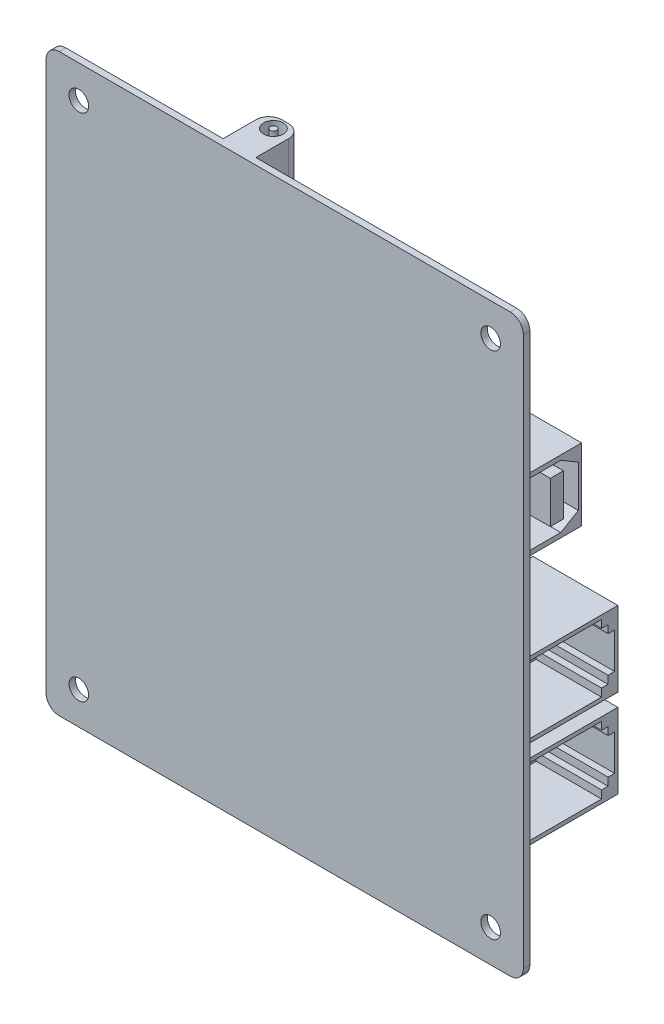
ISO-10303-21;
HEADER;
FILE_DESCRIPTION(('STEP AP214'),'2;1');
FILE_NAME('part.step','',(''),(''),'','','');
FILE_SCHEMA(('AUTOMOTIVE_DESIGN { 1 0 10303 214 1 1 1 1 }'));
ENDSEC;
DATA;
#1=APPLICATION_CONTEXT('core data for automotive mechanical design processes');
#2=APPLICATION_PROTOCOL_DEFINITION('international standard','automotive_design',2000,#1);
#3=PRODUCT_CONTEXT('',#1,'mechanical');
#4=PRODUCT('Part','Part','',(#3));
#5=PRODUCT_RELATED_PRODUCT_CATEGORY('part','',(#4));
#6=PRODUCT_DEFINITION_FORMATION('','',#4);
#7=PRODUCT_DEFINITION_CONTEXT('part definition',#1,'design');
#8=PRODUCT_DEFINITION('design','',#6,#7);
#9=PRODUCT_DEFINITION_SHAPE('','',#8);
#10=(LENGTH_UNIT() NAMED_UNIT(*) SI_UNIT(.MILLI.,.METRE.));
#11=(NAMED_UNIT(*) PLANE_ANGLE_UNIT() SI_UNIT($,.RADIAN.));
#12=(NAMED_UNIT(*) SI_UNIT($,.STERADIAN.) SOLID_ANGLE_UNIT());
#13=UNCERTAINTY_MEASURE_WITH_UNIT(LENGTH_MEASURE(1.E-05),#10,'distance_accuracy_value','');
#14=(GEOMETRIC_REPRESENTATION_CONTEXT(3) GLOBAL_UNCERTAINTY_ASSIGNED_CONTEXT((#13)) GLOBAL_UNIT_ASSIGNED_CONTEXT((#10,
#11,#12)) REPRESENTATION_CONTEXT('',''));
#15=CARTESIAN_POINT('',(0.,0.,0.));
#16=DIRECTION('',(0.,0.,1.));
#17=DIRECTION('',(1.,0.,0.));
#18=AXIS2_PLACEMENT_3D('',#15,#16,#17);
#19=CARTESIAN_POINT('',(0.,0.,-2.));
#20=DIRECTION('',(0.,0.,-1.));
#21=DIRECTION('',(-1.,0.,0.));
#22=AXIS2_PLACEMENT_3D('',#19,#20,#21);
#23=PLANE('',#22);
#24=DIRECTION('',(0.,1.,0.));
#25=VECTOR('',#24,1.);
#26=CARTESIAN_POINT('',(21.3804806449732,9.53630349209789,-2.));
#27=LINE('',#26,#25);
#28=CARTESIAN_POINT('',(21.3804806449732,3.73630349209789,-2.));
#29=VERTEX_POINT('',#28);
#30=CARTESIAN_POINT('',(21.3804806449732,9.53630349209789,-2.));
#31=VERTEX_POINT('',#30);
#32=EDGE_CURVE('E710',#29,#31,#27,.T.);
#33=ORIENTED_EDGE('',*,*,#32,.F.);
#34=DIRECTION('',(1.,0.,0.));
#35=VECTOR('',#34,1.);
#36=CARTESIAN_POINT('',(21.3804806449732,3.73630349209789,-2.));
#37=LINE('',#36,#35);
#38=CARTESIAN_POINT('',(15.5804806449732,3.73630349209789,-2.));
#39=VERTEX_POINT('',#38);
#40=EDGE_CURVE('E703',#39,#29,#37,.T.);
#41=ORIENTED_EDGE('',*,*,#40,.F.);
#42=DIRECTION('',(0.,-1.,0.));
#43=VECTOR('',#42,1.);
#44=CARTESIAN_POINT('',(15.5804806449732,9.53630349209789,-2.));
#45=LINE('',#44,#43);
#46=CARTESIAN_POINT('',(15.5804806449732,9.53630349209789,-2.));
#47=VERTEX_POINT('',#46);
#48=EDGE_CURVE('E713',#47,#39,#45,.T.);
#49=ORIENTED_EDGE('',*,*,#48,.F.);
#50=DIRECTION('',(-1.,0.,0.));
#51=VECTOR('',#50,1.);
#52=CARTESIAN_POINT('',(21.3804806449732,9.53630349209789,-2.));
#53=LINE('',#52,#51);
#54=EDGE_CURVE('E697',#31,#47,#53,.T.);
#55=ORIENTED_EDGE('',*,*,#54,.F.);
#56=EDGE_LOOP('',(#33,#41,#49,#55));
#57=FACE_BOUND('',#56,.T.);
#58=CARTESIAN_POINT('',(18.4304806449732,6.71336294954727,-2.));
#59=DIRECTION('',(0.,0.,-1.));
#60=DIRECTION('',(-1.,0.,0.));
#61=AXIS2_PLACEMENT_3D('',#58,#59,#60);
#62=CIRCLE('',#61,1.5);
#63=CARTESIAN_POINT('',(16.9304806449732,6.71336294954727,-2.));
#64=VERTEX_POINT('',#63);
#65=EDGE_CURVE('E720',#64,#64,#62,.T.);
#66=ORIENTED_EDGE('',*,*,#65,.F.);
#67=EDGE_LOOP('',(#66));
#68=FACE_BOUND('',#67,.T.);
#69=ADVANCED_FACE('F34',(#57,#68),#23,.T.);
#70=CARTESIAN_POINT('',(6.78863800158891,65.2958416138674,-4.));
#71=DIRECTION('',(0.,0.,-1.));
#72=DIRECTION('',(-1.,0.,0.));
#73=AXIS2_PLACEMENT_3D('',#70,#71,#72);
#74=PLANE('',#73);
#75=DIRECTION('',(1.,0.,0.));
#76=VECTOR('',#75,1.);
#77=CARTESIAN_POINT('',(-0.211361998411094,69.2958416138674,-4.));
#78=LINE('',#77,#76);
#79=CARTESIAN_POINT('',(1.78863800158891,69.2958416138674,-4.));
#80=VERTEX_POINT('',#79);
#81=CARTESIAN_POINT('',(6.78863800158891,69.2958416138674,-4.));
#82=VERTEX_POINT('',#81);
#83=EDGE_CURVE('E779',#80,#82,#78,.T.);
#84=ORIENTED_EDGE('',*,*,#83,.T.);
#85=DIRECTION('',(0.,-1.,0.));
#86=VECTOR('',#85,1.);
#87=CARTESIAN_POINT('',(6.78863800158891,65.2958416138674,-4.));
#88=LINE('',#87,#86);
#89=CARTESIAN_POINT('',(6.78863800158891,73.2958416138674,-4.));
#90=VERTEX_POINT('',#89);
#91=EDGE_CURVE('E799',#90,#82,#88,.T.);
#92=ORIENTED_EDGE('',*,*,#91,.F.);
#93=DIRECTION('',(-1.,0.,0.));
#94=VECTOR('',#93,1.);
#95=CARTESIAN_POINT('',(6.78863800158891,73.2958416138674,-4.));
#96=LINE('',#95,#94);
#97=CARTESIAN_POINT('',(1.78863800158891,73.2958416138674,-4.));
#98=VERTEX_POINT('',#97);
#99=EDGE_CURVE('E819',#90,#98,#96,.T.);
#100=ORIENTED_EDGE('',*,*,#99,.T.);
#101=DIRECTION('',(0.,-1.,0.));
#102=VECTOR('',#101,1.);
#103=CARTESIAN_POINT('',(1.78863800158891,65.2958416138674,-4.));
#104=LINE('',#103,#102);
#105=EDGE_CURVE('E798',#98,#80,#104,.T.);
#106=ORIENTED_EDGE('',*,*,#105,.T.);
#107=EDGE_LOOP('',(#84,#92,#100,#106));
#108=FACE_BOUND('',#107,.T.);
#109=ADVANCED_FACE('F1668',(#108),#74,.F.);
#110=CARTESIAN_POINT('',(6.78863800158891,65.2958416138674,-0.7));
#111=DIRECTION('',(0.,0.,1.));
#112=DIRECTION('',(1.,0.,0.));
#113=AXIS2_PLACEMENT_3D('',#110,#111,#112);
#114=PLANE('',#113);
#115=DIRECTION('',(1.,0.,0.));
#116=VECTOR('',#115,1.);
#117=CARTESIAN_POINT('',(-0.211361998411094,69.2958416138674,-0.7));
#118=LINE('',#117,#116);
#119=CARTESIAN_POINT('',(1.78863800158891,69.2958416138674,-0.7));
#120=VERTEX_POINT('',#119);
#121=CARTESIAN_POINT('',(6.78863800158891,69.2958416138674,-0.7));
#122=VERTEX_POINT('',#121);
#123=EDGE_CURVE('E785',#120,#122,#118,.T.);
#124=ORIENTED_EDGE('',*,*,#123,.F.);
#125=DIRECTION('',(0.,1.,0.));
#126=VECTOR('',#125,1.);
#127=CARTESIAN_POINT('',(1.78863800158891,65.2958416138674,-0.7));
#128=LINE('',#127,#126);
#129=CARTESIAN_POINT('',(1.78863800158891,73.2958416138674,-0.7));
#130=VERTEX_POINT('',#129);
#131=EDGE_CURVE('E813',#120,#130,#128,.T.);
#132=ORIENTED_EDGE('',*,*,#131,.T.);
#133=DIRECTION('',(-1.,0.,0.));
#134=VECTOR('',#133,1.);
#135=CARTESIAN_POINT('',(6.78863800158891,73.2958416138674,-0.7));
#136=LINE('',#135,#134);
#137=CARTESIAN_POINT('',(6.78863800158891,73.2958416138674,-0.7));
#138=VERTEX_POINT('',#137);
#139=EDGE_CURVE('E807',#138,#130,#136,.T.);
#140=ORIENTED_EDGE('',*,*,#139,.F.);
#141=DIRECTION('',(0.,1.,0.));
#142=VECTOR('',#141,1.);
#143=CARTESIAN_POINT('',(6.78863800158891,65.2958416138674,-0.7));
#144=LINE('',#143,#142);
#145=EDGE_CURVE('E801',#122,#138,#144,.T.);
#146=ORIENTED_EDGE('',*,*,#145,.F.);
#147=EDGE_LOOP('',(#124,#132,#140,#146));
#148=FACE_BOUND('',#147,.T.);
#149=ADVANCED_FACE('F1673',(#148),#114,.F.);
#150=CARTESIAN_POINT('',(6.7886380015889,0.,0.));
#151=DIRECTION('',(1.,0.,0.));
#152=DIRECTION('',(0.,1.,0.));
#153=AXIS2_PLACEMENT_3D('',#150,#151,#152);
#154=PLANE('',#153);
#155=DIRECTION('',(0.,0.,-1.));
#156=VECTOR('',#155,1.);
#157=CARTESIAN_POINT('',(6.78863800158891,69.2958416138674,-4.));
#158=LINE('',#157,#156);
#159=EDGE_CURVE('E764',#122,#82,#158,.T.);
#160=ORIENTED_EDGE('',*,*,#159,.F.);
#161=ORIENTED_EDGE('',*,*,#145,.T.);
#162=DIRECTION('',(0.,0.,-1.));
#163=VECTOR('',#162,1.);
#164=CARTESIAN_POINT('',(6.78863800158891,73.2958416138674,-4.));
#165=LINE('',#164,#163);
#166=EDGE_CURVE('E804',#138,#90,#165,.T.);
#167=ORIENTED_EDGE('',*,*,#166,.T.);
#168=ORIENTED_EDGE('',*,*,#91,.T.);
#169=EDGE_LOOP('',(#160,#161,#167,#168));
#170=FACE_BOUND('',#169,.T.);
#171=ADVANCED_FACE('F1734',(#170),#154,.F.);
#172=CARTESIAN_POINT('',(0.,0.,0.));
#173=DIRECTION('',(0.,0.,-1.));
#174=DIRECTION('',(-1.,0.,0.));
#175=AXIS2_PLACEMENT_3D('',#172,#173,#174);
#176=PLANE('',#175);
#177=DIRECTION('',(0.,1.,0.));
#178=VECTOR('',#177,1.);
#179=CARTESIAN_POINT('',(21.3804806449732,9.53630349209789,0.));
#180=LINE('',#179,#178);
#181=CARTESIAN_POINT('',(21.3804806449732,3.73630349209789,0.));
#182=VERTEX_POINT('',#181);
#183=CARTESIAN_POINT('',(21.3804806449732,9.53630349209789,0.));
#184=VERTEX_POINT('',#183);
#185=EDGE_CURVE('E725',#182,#184,#180,.T.);
#186=ORIENTED_EDGE('',*,*,#185,.T.);
#187=DIRECTION('',(-1.,0.,0.));
#188=VECTOR('',#187,1.);
#189=CARTESIAN_POINT('',(21.3804806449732,9.53630349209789,0.));
#190=LINE('',#189,#188);
#191=CARTESIAN_POINT('',(15.5804806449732,9.53630349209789,0.));
#192=VERTEX_POINT('',#191);
#193=EDGE_CURVE('E698',#184,#192,#190,.T.);
#194=ORIENTED_EDGE('',*,*,#193,.T.);
#195=DIRECTION('',(0.,-1.,0.));
#196=VECTOR('',#195,1.);
#197=CARTESIAN_POINT('',(15.5804806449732,9.53630349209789,0.));
#198=LINE('',#197,#196);
#199=CARTESIAN_POINT('',(15.5804806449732,3.73630349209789,0.));
#200=VERTEX_POINT('',#199);
#201=EDGE_CURVE('E54',#192,#200,#198,.T.);
#202=ORIENTED_EDGE('',*,*,#201,.T.);
#203=DIRECTION('',(1.,0.,0.));
#204=VECTOR('',#203,1.);
#205=CARTESIAN_POINT('',(21.3804806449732,3.73630349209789,0.));
#206=LINE('',#205,#204);
#207=EDGE_CURVE('E49',#200,#182,#206,.T.);
#208=ORIENTED_EDGE('',*,*,#207,.T.);
#209=EDGE_LOOP('',(#186,#194,#202,#208));
#210=FACE_BOUND('',#209,.T.);
#211=DIRECTION('',(0.,-1.,0.));
#212=VECTOR('',#211,1.);
#213=CARTESIAN_POINT('',(26.0769144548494,75.667760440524,0.));
#214=LINE('',#213,#212);
#215=CARTESIAN_POINT('',(26.0769144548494,88.,0.));
#216=VERTEX_POINT('',#215);
#217=CARTESIAN_POINT('',(26.0769144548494,75.667760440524,0.));
#218=VERTEX_POINT('',#217);
#219=EDGE_CURVE('E744',#216,#218,#214,.T.);
#220=ORIENTED_EDGE('',*,*,#219,.T.);
#221=DIRECTION('',(1.,0.,0.));
#222=VECTOR('',#221,1.);
#223=CARTESIAN_POINT('',(26.0769144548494,75.667760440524,0.));
#224=LINE('',#223,#222);
#225=CARTESIAN_POINT('',(31.0769144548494,75.667760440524,0.));
#226=VERTEX_POINT('',#225);
#227=EDGE_CURVE('E757',#218,#226,#224,.T.);
#228=ORIENTED_EDGE('',*,*,#227,.T.);
#229=DIRECTION('',(0.,1.,0.));
#230=VECTOR('',#229,1.);
#231=CARTESIAN_POINT('',(31.0769144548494,75.667760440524,0.));
#232=LINE('',#231,#230);
#233=CARTESIAN_POINT('',(31.0769144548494,88.,0.));
#234=VERTEX_POINT('',#233);
#235=EDGE_CURVE('E751',#226,#234,#232,.T.);
#236=ORIENTED_EDGE('',*,*,#235,.T.);
#237=DIRECTION('',(-1.,0.,0.));
#238=VECTOR('',#237,1.);
#239=CARTESIAN_POINT('',(0.,88.,0.));
#240=LINE('',#239,#238);
#241=CARTESIAN_POINT('',(71.,88.,0.));
#242=VERTEX_POINT('',#241);
#243=EDGE_CURVE('E1515',#242,#234,#240,.T.);
#244=ORIENTED_EDGE('',*,*,#243,.F.);
#245=CARTESIAN_POINT('',(71.,86.,0.));
#246=DIRECTION('',(0.,0.,-1.));
#247=DIRECTION('',(-1.,0.,0.));
#248=AXIS2_PLACEMENT_3D('',#245,#246,#247);
#249=CIRCLE('',#248,2.);
#250=CARTESIAN_POINT('',(73.,86.,0.));
#251=VERTEX_POINT('',#250);
#252=EDGE_CURVE('E1540',#242,#251,#249,.T.);
#253=ORIENTED_EDGE('',*,*,#252,.T.);
#254=DIRECTION('',(0.,1.,0.));
#255=VECTOR('',#254,1.);
#256=CARTESIAN_POINT('',(73.,0.,0.));
#257=LINE('',#256,#255);
#258=CARTESIAN_POINT('',(73.,2.,0.));
#259=VERTEX_POINT('',#258);
#260=EDGE_CURVE('E1530',#259,#251,#257,.T.);
#261=ORIENTED_EDGE('',*,*,#260,.F.);
#262=CARTESIAN_POINT('',(71.,2.,0.));
#263=DIRECTION('',(0.,0.,-1.));
#264=DIRECTION('',(-1.,0.,0.));
#265=AXIS2_PLACEMENT_3D('',#262,#263,#264);
#266=CIRCLE('',#265,2.);
#267=CARTESIAN_POINT('',(71.,0.,0.));
#268=VERTEX_POINT('',#267);
#269=EDGE_CURVE('E1542',#259,#268,#266,.T.);
#270=ORIENTED_EDGE('',*,*,#269,.T.);
#271=DIRECTION('',(1.,0.,0.));
#272=VECTOR('',#271,1.);
#273=CARTESIAN_POINT('',(0.,0.,0.));
#274=LINE('',#273,#272);
#275=CARTESIAN_POINT('',(2.,0.,0.));
#276=VERTEX_POINT('',#275);
#277=EDGE_CURVE('E1527',#276,#268,#274,.T.);
#278=ORIENTED_EDGE('',*,*,#277,.F.);
#279=CARTESIAN_POINT('',(2.,2.,0.));
#280=DIRECTION('',(0.,0.,-1.));
#281=DIRECTION('',(-1.,0.,0.));
#282=AXIS2_PLACEMENT_3D('',#279,#280,#281);
#283=CIRCLE('',#282,2.);
#284=CARTESIAN_POINT('',(0.,2.,0.));
#285=VERTEX_POINT('',#284);
#286=EDGE_CURVE('E1544',#276,#285,#283,.T.);
#287=ORIENTED_EDGE('',*,*,#286,.T.);
#288=DIRECTION('',(0.,-1.,0.));
#289=VECTOR('',#288,1.);
#290=CARTESIAN_POINT('',(0.,0.,0.));
#291=LINE('',#290,#289);
#292=CARTESIAN_POINT('',(0.,86.,0.));
#293=VERTEX_POINT('',#292);
#294=EDGE_CURVE('E1508',#293,#285,#291,.T.);
#295=ORIENTED_EDGE('',*,*,#294,.F.);
#296=CARTESIAN_POINT('',(2.,86.,0.));
#297=DIRECTION('',(0.,0.,-1.));
#298=DIRECTION('',(-1.,0.,0.));
#299=AXIS2_PLACEMENT_3D('',#296,#297,#298);
#300=CIRCLE('',#299,2.);
#301=CARTESIAN_POINT('',(2.,88.,0.));
#302=VERTEX_POINT('',#301);
#303=EDGE_CURVE('E1546',#293,#302,#300,.T.);
#304=ORIENTED_EDGE('',*,*,#303,.T.);
#305=EDGE_CURVE('E1533',#216,#302,#240,.T.);
#306=ORIENTED_EDGE('',*,*,#305,.F.);
#307=EDGE_LOOP('',(#220,#228,#236,#244,#253,#261,#270,#278,#287,#295,#304,#306));
#308=FACE_BOUND('',#307,.T.);
#309=CARTESIAN_POINT('',(57.3450090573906,6.61907300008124,0.));
#310=DIRECTION('',(0.,0.,-1.));
#311=DIRECTION('',(-1.,0.,0.));
#312=AXIS2_PLACEMENT_3D('',#309,#310,#311);
#313=CIRCLE('',#312,4.00000000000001);
#314=CARTESIAN_POINT('',(53.3450090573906,6.61907300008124,0.));
#315=VERTEX_POINT('',#314);
#316=EDGE_CURVE('E855',#315,#315,#313,.T.);
#317=ORIENTED_EDGE('',*,*,#316,.F.);
#318=EDGE_LOOP('',(#317));
#319=FACE_BOUND('',#318,.T.);
#320=CARTESIAN_POINT('',(68.,83.,0.));
#321=DIRECTION('',(0.,0.,1.));
#322=DIRECTION('',(-1.,0.,0.));
#323=AXIS2_PLACEMENT_3D('',#320,#321,#322);
#324=CIRCLE('',#323,1.5);
#325=CARTESIAN_POINT('',(66.5,83.,0.));
#326=VERTEX_POINT('',#325);
#327=EDGE_CURVE('E1478',#326,#326,#324,.T.);
#328=ORIENTED_EDGE('',*,*,#327,.T.);
#329=EDGE_LOOP('',(#328));
#330=FACE_BOUND('',#329,.T.);
#331=CARTESIAN_POINT('',(5.,4.99999999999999,0.));
#332=DIRECTION('',(0.,0.,1.));
#333=DIRECTION('',(1.,0.,0.));
#334=AXIS2_PLACEMENT_3D('',#331,#332,#333);
#335=CIRCLE('',#334,1.5);
#336=CARTESIAN_POINT('',(6.5,4.99999999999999,0.));
#337=VERTEX_POINT('',#336);
#338=EDGE_CURVE('E1496',#337,#337,#335,.T.);
#339=ORIENTED_EDGE('',*,*,#338,.T.);
#340=EDGE_LOOP('',(#339));
#341=FACE_BOUND('',#340,.T.);
#342=CARTESIAN_POINT('',(5.,83.,0.));
#343=DIRECTION('',(0.,0.,1.));
#344=DIRECTION('',(1.,0.,0.));
#345=AXIS2_PLACEMENT_3D('',#342,#343,#344);
#346=CIRCLE('',#345,1.5);
#347=CARTESIAN_POINT('',(6.5,83.,0.));
#348=VERTEX_POINT('',#347);
#349=EDGE_CURVE('E1502',#348,#348,#346,.T.);
#350=ORIENTED_EDGE('',*,*,#349,.T.);
#351=EDGE_LOOP('',(#350));
#352=FACE_BOUND('',#351,.T.);
#353=CARTESIAN_POINT('',(68.,4.99999999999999,0.));
#354=DIRECTION('',(0.,0.,1.));
#355=DIRECTION('',(-1.,0.,0.));
#356=AXIS2_PLACEMENT_3D('',#353,#354,#355);
#357=CIRCLE('',#356,1.5);
#358=CARTESIAN_POINT('',(66.5,4.99999999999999,0.));
#359=VERTEX_POINT('',#358);
#360=EDGE_CURVE('E1490',#359,#359,#357,.T.);
#361=ORIENTED_EDGE('',*,*,#360,.T.);
#362=EDGE_LOOP('',(#361));
#363=FACE_BOUND('',#362,.T.);
#364=DIRECTION('',(0.,1.,0.));
#365=VECTOR('',#364,1.);
#366=CARTESIAN_POINT('',(72.4659504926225,42.3580657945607,0.));
#367=LINE('',#366,#365);
#368=CARTESIAN_POINT('',(72.4659504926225,30.8580657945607,0.));
#369=VERTEX_POINT('',#368);
#370=CARTESIAN_POINT('',(72.4659504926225,42.3580657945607,0.));
#371=VERTEX_POINT('',#370);
#372=EDGE_CURVE('E1446',#369,#371,#367,.T.);
#373=ORIENTED_EDGE('',*,*,#372,.T.);
#374=DIRECTION('',(-1.,0.,0.));
#375=VECTOR('',#374,1.);
#376=CARTESIAN_POINT('',(72.4659504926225,42.3580657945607,0.));
#377=LINE('',#376,#375);
#378=CARTESIAN_POINT('',(59.4659504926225,42.3580657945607,0.));
#379=VERTEX_POINT('',#378);
#380=EDGE_CURVE('E1470',#371,#379,#377,.T.);
#381=ORIENTED_EDGE('',*,*,#380,.T.);
#382=DIRECTION('',(0.,-1.,0.));
#383=VECTOR('',#382,1.);
#384=CARTESIAN_POINT('',(59.4659504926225,42.3580657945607,0.));
#385=LINE('',#384,#383);
#386=CARTESIAN_POINT('',(59.4659504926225,30.8580657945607,0.));
#387=VERTEX_POINT('',#386);
#388=EDGE_CURVE('E1472',#379,#387,#385,.T.);
#389=ORIENTED_EDGE('',*,*,#388,.T.);
#390=DIRECTION('',(1.,0.,0.));
#391=VECTOR('',#390,1.);
#392=CARTESIAN_POINT('',(72.4659504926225,30.8580657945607,0.));
#393=LINE('',#392,#391);
#394=EDGE_CURVE('E1459',#387,#369,#393,.T.);
#395=ORIENTED_EDGE('',*,*,#394,.T.);
#396=EDGE_LOOP('',(#373,#381,#389,#395));
#397=FACE_BOUND('',#396,.T.);
#398=DIRECTION('',(-1.,0.,0.));
#399=VECTOR('',#398,1.);
#400=CARTESIAN_POINT('',(72.4659504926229,28.8580657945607,0.));
#401=LINE('',#400,#399);
#402=CARTESIAN_POINT('',(72.4659504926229,28.8580657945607,0.));
#403=VERTEX_POINT('',#402);
#404=CARTESIAN_POINT('',(59.465950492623,28.8580657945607,0.));
#405=VERTEX_POINT('',#404);
#406=EDGE_CURVE('E1414',#403,#405,#401,.T.);
#407=ORIENTED_EDGE('',*,*,#406,.T.);
#408=DIRECTION('',(0.,-1.,0.));
#409=VECTOR('',#408,1.);
#410=CARTESIAN_POINT('',(59.465950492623,28.8580657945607,0.));
#411=LINE('',#410,#409);
#412=CARTESIAN_POINT('',(59.465950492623,17.3580657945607,0.));
#413=VERTEX_POINT('',#412);
#414=EDGE_CURVE('E1438',#405,#413,#411,.T.);
#415=ORIENTED_EDGE('',*,*,#414,.T.);
#416=DIRECTION('',(1.,0.,0.));
#417=VECTOR('',#416,1.);
#418=CARTESIAN_POINT('',(72.4659504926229,17.3580657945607,0.));
#419=LINE('',#418,#417);
#420=CARTESIAN_POINT('',(72.4659504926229,17.3580657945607,0.));
#421=VERTEX_POINT('',#420);
#422=EDGE_CURVE('E1440',#413,#421,#419,.T.);
#423=ORIENTED_EDGE('',*,*,#422,.T.);
#424=DIRECTION('',(0.,1.,0.));
#425=VECTOR('',#424,1.);
#426=CARTESIAN_POINT('',(72.4659504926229,28.8580657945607,0.));
#427=LINE('',#426,#425);
#428=EDGE_CURVE('E1427',#421,#403,#427,.T.);
#429=ORIENTED_EDGE('',*,*,#428,.T.);
#430=EDGE_LOOP('',(#407,#415,#423,#429));
#431=FACE_BOUND('',#430,.T.);
#432=DIRECTION('',(-1.,0.,0.));
#433=VECTOR('',#432,1.);
#434=CARTESIAN_POINT('',(14.8166887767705,42.3580657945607,0.));
#435=LINE('',#434,#433);
#436=CARTESIAN_POINT('',(14.8166887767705,42.3580657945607,0.));
#437=VERTEX_POINT('',#436);
#438=CARTESIAN_POINT('',(1.81668877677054,42.3580657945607,0.));
#439=VERTEX_POINT('',#438);
#440=EDGE_CURVE('E1382',#437,#439,#435,.T.);
#441=ORIENTED_EDGE('',*,*,#440,.T.);
#442=DIRECTION('',(0.,-1.,0.));
#443=VECTOR('',#442,1.);
#444=CARTESIAN_POINT('',(1.81668877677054,42.3580657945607,0.));
#445=LINE('',#444,#443);
#446=CARTESIAN_POINT('',(1.81668877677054,30.8580657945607,0.));
#447=VERTEX_POINT('',#446);
#448=EDGE_CURVE('E1406',#439,#447,#445,.T.);
#449=ORIENTED_EDGE('',*,*,#448,.T.);
#450=DIRECTION('',(1.,0.,0.));
#451=VECTOR('',#450,1.);
#452=CARTESIAN_POINT('',(14.8166887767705,30.8580657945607,0.));
#453=LINE('',#452,#451);
#454=CARTESIAN_POINT('',(14.8166887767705,30.8580657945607,0.));
#455=VERTEX_POINT('',#454);
#456=EDGE_CURVE('E1408',#447,#455,#453,.T.);
#457=ORIENTED_EDGE('',*,*,#456,.T.);
#458=DIRECTION('',(0.,1.,0.));
#459=VECTOR('',#458,1.);
#460=CARTESIAN_POINT('',(14.8166887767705,42.3580657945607,0.));
#461=LINE('',#460,#459);
#462=EDGE_CURVE('E1395',#455,#437,#461,.T.);
#463=ORIENTED_EDGE('',*,*,#462,.T.);
#464=EDGE_LOOP('',(#441,#449,#457,#463));
#465=FACE_BOUND('',#464,.T.);
#466=DIRECTION('',(-1.,0.,0.));
#467=VECTOR('',#466,1.);
#468=CARTESIAN_POINT('',(14.8166887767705,28.8580657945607,0.));
#469=LINE('',#468,#467);
#470=CARTESIAN_POINT('',(14.8166887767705,28.8580657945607,0.));
#471=VERTEX_POINT('',#470);
#472=CARTESIAN_POINT('',(1.81668877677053,28.8580657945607,0.));
#473=VERTEX_POINT('',#472);
#474=EDGE_CURVE('E1336',#471,#473,#469,.T.);
#475=ORIENTED_EDGE('',*,*,#474,.T.);
#476=DIRECTION('',(0.,-1.,0.));
#477=VECTOR('',#476,1.);
#478=CARTESIAN_POINT('',(1.81668877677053,28.8580657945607,0.));
#479=LINE('',#478,#477);
#480=CARTESIAN_POINT('',(1.81668877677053,17.3580657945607,0.));
#481=VERTEX_POINT('',#480);
#482=EDGE_CURVE('E1374',#473,#481,#479,.T.);
#483=ORIENTED_EDGE('',*,*,#482,.T.);
#484=DIRECTION('',(1.,0.,0.));
#485=VECTOR('',#484,1.);
#486=CARTESIAN_POINT('',(14.8166887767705,17.3580657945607,0.));
#487=LINE('',#486,#485);
#488=CARTESIAN_POINT('',(14.8166887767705,17.3580657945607,0.));
#489=VERTEX_POINT('',#488);
#490=EDGE_CURVE('E1376',#481,#489,#487,.T.);
#491=ORIENTED_EDGE('',*,*,#490,.T.);
#492=DIRECTION('',(0.,1.,0.));
#493=VECTOR('',#492,1.);
#494=CARTESIAN_POINT('',(14.8166887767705,28.8580657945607,0.));
#495=LINE('',#494,#493);
#496=EDGE_CURVE('E1363',#489,#471,#495,.T.);
#497=ORIENTED_EDGE('',*,*,#496,.T.);
#498=EDGE_LOOP('',(#475,#483,#491,#497));
#499=FACE_BOUND('',#498,.T.);
#500=DIRECTION('',(0.,1.,0.));
#501=VECTOR('',#500,1.);
#502=CARTESIAN_POINT('',(70.9155681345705,65.1170034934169,0.));
#503=LINE('',#502,#501);
#504=CARTESIAN_POINT('',(70.9155681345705,54.1170034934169,0.));
#505=VERTEX_POINT('',#504);
#506=CARTESIAN_POINT('',(70.9155681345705,65.1170034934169,0.));
#507=VERTEX_POINT('',#506);
#508=EDGE_CURVE('E932',#505,#507,#503,.T.);
#509=ORIENTED_EDGE('',*,*,#508,.T.);
#510=DIRECTION('',(-1.,0.,0.));
#511=VECTOR('',#510,1.);
#512=CARTESIAN_POINT('',(70.9155681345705,65.1170034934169,0.));
#513=LINE('',#512,#511);
#514=CARTESIAN_POINT('',(56.9155681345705,65.1170034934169,0.));
#515=VERTEX_POINT('',#514);
#516=EDGE_CURVE('E958',#507,#515,#513,.T.);
#517=ORIENTED_EDGE('',*,*,#516,.T.);
#518=DIRECTION('',(0.,-1.,0.));
#519=VECTOR('',#518,1.);
#520=CARTESIAN_POINT('',(56.9155681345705,65.1170034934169,0.));
#521=LINE('',#520,#519);
#522=CARTESIAN_POINT('',(56.9155681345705,54.1170034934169,0.));
#523=VERTEX_POINT('',#522);
#524=EDGE_CURVE('E960',#515,#523,#521,.T.);
#525=ORIENTED_EDGE('',*,*,#524,.T.);
#526=DIRECTION('',(1.,0.,0.));
#527=VECTOR('',#526,1.);
#528=CARTESIAN_POINT('',(70.9155681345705,54.1170034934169,0.));
#529=LINE('',#528,#527);
#530=EDGE_CURVE('E947',#523,#505,#529,.T.);
#531=ORIENTED_EDGE('',*,*,#530,.T.);
#532=EDGE_LOOP('',(#509,#517,#525,#531));
#533=FACE_BOUND('',#532,.T.);
#534=DIRECTION('',(-1.,0.,0.));
#535=VECTOR('',#534,1.);
#536=CARTESIAN_POINT('',(7.11713768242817,64.1635502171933,0.));
#537=LINE('',#536,#535);
#538=CARTESIAN_POINT('',(7.11713768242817,64.1635502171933,0.));
#539=VERTEX_POINT('',#538);
#540=CARTESIAN_POINT('',(1.7886380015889,64.1635502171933,0.));
#541=VERTEX_POINT('',#540);
#542=EDGE_CURVE('E837',#539,#541,#537,.T.);
#543=ORIENTED_EDGE('',*,*,#542,.F.);
#544=DIRECTION('',(0.,-1.,0.));
#545=VECTOR('',#544,1.);
#546=CARTESIAN_POINT('',(7.11713768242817,76.1635502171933,0.));
#547=LINE('',#546,#545);
#548=CARTESIAN_POINT('',(7.11713768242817,76.1635502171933,0.));
#549=VERTEX_POINT('',#548);
#550=EDGE_CURVE('E821',#549,#539,#547,.T.);
#551=ORIENTED_EDGE('',*,*,#550,.F.);
#552=DIRECTION('',(1.,0.,0.));
#553=VECTOR('',#552,1.);
#554=CARTESIAN_POINT('',(7.11713768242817,76.1635502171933,0.));
#555=LINE('',#554,#553);
#556=CARTESIAN_POINT('',(1.78863800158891,76.1635502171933,0.));
#557=VERTEX_POINT('',#556);
#558=EDGE_CURVE('E828',#557,#549,#555,.T.);
#559=ORIENTED_EDGE('',*,*,#558,.F.);
#560=DIRECTION('',(0.,1.,0.));
#561=VECTOR('',#560,1.);
#562=CARTESIAN_POINT('',(1.78863800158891,76.1635502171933,0.));
#563=LINE('',#562,#561);
#564=EDGE_CURVE('E839',#541,#557,#563,.T.);
#565=ORIENTED_EDGE('',*,*,#564,.F.);
#566=EDGE_LOOP('',(#543,#551,#559,#565));
#567=FACE_BOUND('',#566,.T.);
#568=ADVANCED_FACE('F1617',(#210,#308,#319,#330,#341,#352,#363,#397,#431,#465,#499,#533,#567),
#176,.T.);
#569=CARTESIAN_POINT('',(0.,0.,1.));
#570=DIRECTION('',(0.,0.,-1.));
#571=DIRECTION('',(-1.,0.,0.));
#572=AXIS2_PLACEMENT_3D('',#569,#570,#571);
#573=PLANE('',#572);
#574=CARTESIAN_POINT('',(68.,4.99999999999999,1.));
#575=DIRECTION('',(0.,0.,1.));
#576=DIRECTION('',(-1.,0.,0.));
#577=AXIS2_PLACEMENT_3D('',#574,#575,#576);
#578=CIRCLE('',#577,1.5);
#579=CARTESIAN_POINT('',(66.5,4.99999999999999,1.));
#580=VERTEX_POINT('',#579);
#581=EDGE_CURVE('E1493',#580,#580,#578,.T.);
#582=ORIENTED_EDGE('',*,*,#581,.F.);
#583=EDGE_LOOP('',(#582));
#584=FACE_BOUND('',#583,.T.);
#585=CARTESIAN_POINT('',(5.,83.,1.));
#586=DIRECTION('',(0.,0.,1.));
#587=DIRECTION('',(1.,0.,0.));
#588=AXIS2_PLACEMENT_3D('',#585,#586,#587);
#589=CIRCLE('',#588,1.5);
#590=CARTESIAN_POINT('',(6.5,83.,1.));
#591=VERTEX_POINT('',#590);
#592=EDGE_CURVE('E1505',#591,#591,#589,.T.);
#593=ORIENTED_EDGE('',*,*,#592,.F.);
#594=EDGE_LOOP('',(#593));
#595=FACE_BOUND('',#594,.T.);
#596=DIRECTION('',(-1.,0.,0.));
#597=VECTOR('',#596,1.);
#598=CARTESIAN_POINT('',(0.,88.,1.));
#599=LINE('',#598,#597);
#600=CARTESIAN_POINT('',(71.,88.,1.));
#601=VERTEX_POINT('',#600);
#602=CARTESIAN_POINT('',(2.,88.,1.));
#603=VERTEX_POINT('',#602);
#604=EDGE_CURVE('E1521',#601,#603,#599,.T.);
#605=ORIENTED_EDGE('',*,*,#604,.T.);
#606=CARTESIAN_POINT('',(2.,86.,1.));
#607=DIRECTION('',(0.,0.,-1.));
#608=DIRECTION('',(-1.,0.,0.));
#609=AXIS2_PLACEMENT_3D('',#606,#607,#608);
#610=CIRCLE('',#609,2.);
#611=CARTESIAN_POINT('',(0.,86.,1.));
#612=VERTEX_POINT('',#611);
#613=EDGE_CURVE('E1560',#603,#612,#610,.F.);
#614=ORIENTED_EDGE('',*,*,#613,.T.);
#615=DIRECTION('',(0.,-1.,0.));
#616=VECTOR('',#615,1.);
#617=CARTESIAN_POINT('',(0.,0.,1.));
#618=LINE('',#617,#616);
#619=CARTESIAN_POINT('',(0.,2.,1.));
#620=VERTEX_POINT('',#619);
#621=EDGE_CURVE('E1511',#612,#620,#618,.T.);
#622=ORIENTED_EDGE('',*,*,#621,.T.);
#623=CARTESIAN_POINT('',(2.,2.,1.));
#624=DIRECTION('',(0.,0.,-1.));
#625=DIRECTION('',(-1.,0.,0.));
#626=AXIS2_PLACEMENT_3D('',#623,#624,#625);
#627=CIRCLE('',#626,2.);
#628=CARTESIAN_POINT('',(2.,0.,1.));
#629=VERTEX_POINT('',#628);
#630=EDGE_CURVE('E1558',#620,#629,#627,.F.);
#631=ORIENTED_EDGE('',*,*,#630,.T.);
#632=DIRECTION('',(1.,0.,0.));
#633=VECTOR('',#632,1.);
#634=CARTESIAN_POINT('',(0.,0.,1.));
#635=LINE('',#634,#633);
#636=CARTESIAN_POINT('',(71.,0.,1.));
#637=VERTEX_POINT('',#636);
#638=EDGE_CURVE('E1514',#629,#637,#635,.T.);
#639=ORIENTED_EDGE('',*,*,#638,.T.);
#640=CARTESIAN_POINT('',(71.,2.,1.));
#641=DIRECTION('',(0.,0.,-1.));
#642=DIRECTION('',(-1.,0.,0.));
#643=AXIS2_PLACEMENT_3D('',#640,#641,#642);
#644=CIRCLE('',#643,2.);
#645=CARTESIAN_POINT('',(73.,2.,1.));
#646=VERTEX_POINT('',#645);
#647=EDGE_CURVE('E1556',#637,#646,#644,.F.);
#648=ORIENTED_EDGE('',*,*,#647,.T.);
#649=DIRECTION('',(0.,1.,0.));
#650=VECTOR('',#649,1.);
#651=CARTESIAN_POINT('',(73.,0.,1.));
#652=LINE('',#651,#650);
#653=CARTESIAN_POINT('',(73.,86.,1.));
#654=VERTEX_POINT('',#653);
#655=EDGE_CURVE('E1518',#646,#654,#652,.T.);
#656=ORIENTED_EDGE('',*,*,#655,.T.);
#657=CARTESIAN_POINT('',(71.,86.,1.));
#658=DIRECTION('',(0.,0.,-1.));
#659=DIRECTION('',(-1.,0.,0.));
#660=AXIS2_PLACEMENT_3D('',#657,#658,#659);
#661=CIRCLE('',#660,2.);
#662=EDGE_CURVE('E1554',#654,#601,#661,.F.);
#663=ORIENTED_EDGE('',*,*,#662,.T.);
#664=EDGE_LOOP('',(#605,#614,#622,#631,#639,#648,#656,#663));
#665=FACE_BOUND('',#664,.T.);
#666=CARTESIAN_POINT('',(5.,4.99999999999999,1.));
#667=DIRECTION('',(0.,0.,1.));
#668=DIRECTION('',(1.,0.,0.));
#669=AXIS2_PLACEMENT_3D('',#666,#667,#668);
#670=CIRCLE('',#669,1.5);
#671=CARTESIAN_POINT('',(6.5,4.99999999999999,1.));
#672=VERTEX_POINT('',#671);
#673=EDGE_CURVE('E1499',#672,#672,#670,.T.);
#674=ORIENTED_EDGE('',*,*,#673,.F.);
#675=EDGE_LOOP('',(#674));
#676=FACE_BOUND('',#675,.T.);
#677=CARTESIAN_POINT('',(68.,83.,1.));
#678=DIRECTION('',(0.,0.,1.));
#679=DIRECTION('',(-1.,0.,0.));
#680=AXIS2_PLACEMENT_3D('',#677,#678,#679);
#681=CIRCLE('',#680,1.5);
#682=CARTESIAN_POINT('',(66.5,83.,1.));
#683=VERTEX_POINT('',#682);
#684=EDGE_CURVE('E1487',#683,#683,#681,.T.);
#685=ORIENTED_EDGE('',*,*,#684,.F.);
#686=EDGE_LOOP('',(#685));
#687=FACE_BOUND('',#686,.T.);
#688=ADVANCED_FACE('F1626',(#584,#595,#665,#676,#687),#573,.F.);
#689=CARTESIAN_POINT('',(0.,0.,1.));
#690=DIRECTION('',(1.,0.,0.));
#691=DIRECTION('',(0.,0.,-1.));
#692=AXIS2_PLACEMENT_3D('',#689,#690,#691);
#693=PLANE('',#692);
#694=ORIENTED_EDGE('',*,*,#621,.F.);
#695=DIRECTION('',(0.,0.,-1.));
#696=VECTOR('',#695,1.);
#697=CARTESIAN_POINT('',(0.,86.,1.));
#698=LINE('',#697,#696);
#699=EDGE_CURVE('E1537',#612,#293,#698,.T.);
#700=ORIENTED_EDGE('',*,*,#699,.T.);
#701=ORIENTED_EDGE('',*,*,#294,.T.);
#702=DIRECTION('',(0.,0.,-1.));
#703=VECTOR('',#702,1.);
#704=CARTESIAN_POINT('',(0.,2.,1.));
#705=LINE('',#704,#703);
#706=EDGE_CURVE('E1524',#285,#620,#705,.F.);
#707=ORIENTED_EDGE('',*,*,#706,.T.);
#708=EDGE_LOOP('',(#694,#700,#701,#707));
#709=FACE_BOUND('',#708,.T.);
#710=ADVANCED_FACE('F1633',(#709),#693,.F.);
#711=CARTESIAN_POINT('',(0.,0.,1.));
#712=DIRECTION('',(0.,1.,0.));
#713=DIRECTION('',(0.,0.,1.));
#714=AXIS2_PLACEMENT_3D('',#711,#712,#713);
#715=PLANE('',#714);
#716=ORIENTED_EDGE('',*,*,#638,.F.);
#717=DIRECTION('',(0.,0.,-1.));
#718=VECTOR('',#717,1.);
#719=CARTESIAN_POINT('',(2.,0.,1.));
#720=LINE('',#719,#718);
#721=EDGE_CURVE('E1564',#629,#276,#720,.T.);
#722=ORIENTED_EDGE('',*,*,#721,.T.);
#723=ORIENTED_EDGE('',*,*,#277,.T.);
#724=DIRECTION('',(0.,0.,-1.));
#725=VECTOR('',#724,1.);
#726=CARTESIAN_POINT('',(71.,0.,1.));
#727=LINE('',#726,#725);
#728=EDGE_CURVE('E1562',#268,#637,#727,.F.);
#729=ORIENTED_EDGE('',*,*,#728,.T.);
#730=EDGE_LOOP('',(#716,#722,#723,#729));
#731=FACE_BOUND('',#730,.T.);
#732=ADVANCED_FACE('F1642',(#731),#715,.F.);
#733=CARTESIAN_POINT('',(73.,0.,1.));
#734=DIRECTION('',(-1.,0.,0.));
#735=DIRECTION('',(0.,0.,1.));
#736=AXIS2_PLACEMENT_3D('',#733,#734,#735);
#737=PLANE('',#736);
#738=ORIENTED_EDGE('',*,*,#655,.F.);
#739=DIRECTION('',(0.,0.,-1.));
#740=VECTOR('',#739,1.);
#741=CARTESIAN_POINT('',(73.,2.,1.));
#742=LINE('',#741,#740);
#743=EDGE_CURVE('E1569',#646,#259,#742,.T.);
#744=ORIENTED_EDGE('',*,*,#743,.T.);
#745=ORIENTED_EDGE('',*,*,#260,.T.);
#746=DIRECTION('',(0.,0.,-1.));
#747=VECTOR('',#746,1.);
#748=CARTESIAN_POINT('',(73.,86.,1.));
#749=LINE('',#748,#747);
#750=EDGE_CURVE('E1567',#251,#654,#749,.F.);
#751=ORIENTED_EDGE('',*,*,#750,.T.);
#752=EDGE_LOOP('',(#738,#744,#745,#751));
#753=FACE_BOUND('',#752,.T.);
#754=ADVANCED_FACE('F1651',(#753),#737,.F.);
#755=CARTESIAN_POINT('',(0.,88.,1.));
#756=DIRECTION('',(0.,-1.,0.));
#757=DIRECTION('',(0.,0.,-1.));
#758=AXIS2_PLACEMENT_3D('',#755,#756,#757);
#759=PLANE('',#758);
#760=CARTESIAN_POINT('',(28.5769144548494,88.,-5.19545079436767));
#761=DIRECTION('',(0.,1.,0.));
#762=DIRECTION('',(0.,0.,1.));
#763=AXIS2_PLACEMENT_3D('',#760,#761,#762);
#764=CIRCLE('',#763,1.5);
#765=CARTESIAN_POINT('',(28.5769144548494,88.,-3.69545079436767));
#766=VERTEX_POINT('',#765);
#767=EDGE_CURVE('E738',#766,#766,#764,.T.);
#768=ORIENTED_EDGE('',*,*,#767,.F.);
#769=EDGE_LOOP('',(#768));
#770=FACE_BOUND('',#769,.T.);
#771=DIRECTION('',(0.,0.,1.));
#772=VECTOR('',#771,1.);
#773=CARTESIAN_POINT('',(31.0769144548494,88.,-7.));
#774=LINE('',#773,#772);
#775=CARTESIAN_POINT('',(31.0769144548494,88.,-5.));
#776=VERTEX_POINT('',#775);
#777=EDGE_CURVE('E765',#776,#234,#774,.T.);
#778=ORIENTED_EDGE('',*,*,#777,.F.);
#779=CARTESIAN_POINT('',(29.0769144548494,88.,-5.));
#780=DIRECTION('',(0.,-1.,0.));
#781=DIRECTION('',(0.,0.,-1.));
#782=AXIS2_PLACEMENT_3D('',#779,#780,#781);
#783=CIRCLE('',#782,2.);
#784=CARTESIAN_POINT('',(29.0769144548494,88.,-7.));
#785=VERTEX_POINT('',#784);
#786=EDGE_CURVE('E1580',#776,#785,#783,.F.);
#787=ORIENTED_EDGE('',*,*,#786,.T.);
#788=DIRECTION('',(-1.,0.,0.));
#789=VECTOR('',#788,1.);
#790=CARTESIAN_POINT('',(26.0769144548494,88.,-7.));
#791=LINE('',#790,#789);
#792=CARTESIAN_POINT('',(28.0769144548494,88.,-7.));
#793=VERTEX_POINT('',#792);
#794=EDGE_CURVE('E750',#785,#793,#791,.T.);
#795=ORIENTED_EDGE('',*,*,#794,.T.);
#796=CARTESIAN_POINT('',(28.0769144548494,88.,-5.));
#797=DIRECTION('',(0.,-1.,0.));
#798=DIRECTION('',(0.,0.,-1.));
#799=AXIS2_PLACEMENT_3D('',#796,#797,#798);
#800=CIRCLE('',#799,2.);
#801=CARTESIAN_POINT('',(26.0769144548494,88.,-5.));
#802=VERTEX_POINT('',#801);
#803=EDGE_CURVE('E1578',#793,#802,#800,.F.);
#804=ORIENTED_EDGE('',*,*,#803,.T.);
#805=DIRECTION('',(0.,0.,1.));
#806=VECTOR('',#805,1.);
#807=CARTESIAN_POINT('',(26.0769144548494,88.,-7.));
#808=LINE('',#807,#806);
#809=EDGE_CURVE('E762',#802,#216,#808,.T.);
#810=ORIENTED_EDGE('',*,*,#809,.T.);
#811=ORIENTED_EDGE('',*,*,#305,.T.);
#812=DIRECTION('',(0.,0.,-1.));
#813=VECTOR('',#812,1.);
#814=CARTESIAN_POINT('',(2.,88.,1.));
#815=LINE('',#814,#813);
#816=EDGE_CURVE('E1552',#302,#603,#815,.F.);
#817=ORIENTED_EDGE('',*,*,#816,.T.);
#818=ORIENTED_EDGE('',*,*,#604,.F.);
#819=DIRECTION('',(0.,0.,-1.));
#820=VECTOR('',#819,1.);
#821=CARTESIAN_POINT('',(71.,88.,1.));
#822=LINE('',#821,#820);
#823=EDGE_CURVE('E1549',#601,#242,#822,.T.);
#824=ORIENTED_EDGE('',*,*,#823,.T.);
#825=ORIENTED_EDGE('',*,*,#243,.T.);
#826=EDGE_LOOP('',(#778,#787,#795,#804,#810,#811,#817,#818,#824,#825));
#827=FACE_BOUND('',#826,.T.);
#828=ADVANCED_FACE('F1603',(#770,#827),#759,.F.);
#829=CARTESIAN_POINT('',(5.,83.,1.));
#830=DIRECTION('',(0.,0.,-1.));
#831=DIRECTION('',(-1.,0.,0.));
#832=AXIS2_PLACEMENT_3D('',#829,#830,#831);
#833=CYLINDRICAL_SURFACE('',#832,1.5);
#834=ORIENTED_EDGE('',*,*,#592,.T.);
#835=EDGE_LOOP('',(#834));
#836=FACE_BOUND('',#835,.T.);
#837=ORIENTED_EDGE('',*,*,#349,.F.);
#838=EDGE_LOOP('',(#837));
#839=FACE_BOUND('',#838,.T.);
#840=ADVANCED_FACE('F2136',(#836,#839),#833,.F.);
#841=CARTESIAN_POINT('',(5.,4.99999999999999,1.));
#842=DIRECTION('',(0.,0.,-1.));
#843=DIRECTION('',(-1.,0.,0.));
#844=AXIS2_PLACEMENT_3D('',#841,#842,#843);
#845=CYLINDRICAL_SURFACE('',#844,1.5);
#846=ORIENTED_EDGE('',*,*,#673,.T.);
#847=EDGE_LOOP('',(#846));
#848=FACE_BOUND('',#847,.T.);
#849=ORIENTED_EDGE('',*,*,#338,.F.);
#850=EDGE_LOOP('',(#849));
#851=FACE_BOUND('',#850,.T.);
#852=ADVANCED_FACE('F2132',(#848,#851),#845,.F.);
#853=CARTESIAN_POINT('',(68.,4.99999999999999,1.));
#854=DIRECTION('',(0.,0.,-1.));
#855=DIRECTION('',(-1.,0.,0.));
#856=AXIS2_PLACEMENT_3D('',#853,#854,#855);
#857=CYLINDRICAL_SURFACE('',#856,1.5);
#858=ORIENTED_EDGE('',*,*,#581,.T.);
#859=EDGE_LOOP('',(#858));
#860=FACE_BOUND('',#859,.T.);
#861=ORIENTED_EDGE('',*,*,#360,.F.);
#862=EDGE_LOOP('',(#861));
#863=FACE_BOUND('',#862,.T.);
#864=ADVANCED_FACE('F2128',(#860,#863),#857,.F.);
#865=CARTESIAN_POINT('',(68.,83.,1.));
#866=DIRECTION('',(0.,0.,-1.));
#867=DIRECTION('',(-1.,0.,0.));
#868=AXIS2_PLACEMENT_3D('',#865,#866,#867);
#869=CYLINDRICAL_SURFACE('',#868,1.5);
#870=ORIENTED_EDGE('',*,*,#684,.T.);
#871=EDGE_LOOP('',(#870));
#872=FACE_BOUND('',#871,.T.);
#873=ORIENTED_EDGE('',*,*,#327,.F.);
#874=EDGE_LOOP('',(#873));
#875=FACE_BOUND('',#874,.T.);
#876=ADVANCED_FACE('F2125',(#872,#875),#869,.F.);
#877=CARTESIAN_POINT('',(2.,86.,1.));
#878=DIRECTION('',(0.,0.,-1.));
#879=DIRECTION('',(-1.,0.,0.));
#880=AXIS2_PLACEMENT_3D('',#877,#878,#879);
#881=CYLINDRICAL_SURFACE('',#880,2.);
#882=ORIENTED_EDGE('',*,*,#613,.F.);
#883=ORIENTED_EDGE('',*,*,#816,.F.);
#884=ORIENTED_EDGE('',*,*,#303,.F.);
#885=ORIENTED_EDGE('',*,*,#699,.F.);
#886=EDGE_LOOP('',(#882,#883,#884,#885));
#887=FACE_BOUND('',#886,.T.);
#888=ADVANCED_FACE('F1631',(#887),#881,.T.);
#889=CARTESIAN_POINT('',(2.,2.,1.));
#890=DIRECTION('',(0.,0.,-1.));
#891=DIRECTION('',(-1.,0.,0.));
#892=AXIS2_PLACEMENT_3D('',#889,#890,#891);
#893=CYLINDRICAL_SURFACE('',#892,2.);
#894=ORIENTED_EDGE('',*,*,#630,.F.);
#895=ORIENTED_EDGE('',*,*,#706,.F.);
#896=ORIENTED_EDGE('',*,*,#286,.F.);
#897=ORIENTED_EDGE('',*,*,#721,.F.);
#898=EDGE_LOOP('',(#894,#895,#896,#897));
#899=FACE_BOUND('',#898,.T.);
#900=ADVANCED_FACE('F1639',(#899),#893,.T.);
#901=CARTESIAN_POINT('',(71.,2.,1.));
#902=DIRECTION('',(0.,0.,-1.));
#903=DIRECTION('',(-1.,0.,0.));
#904=AXIS2_PLACEMENT_3D('',#901,#902,#903);
#905=CYLINDRICAL_SURFACE('',#904,2.);
#906=ORIENTED_EDGE('',*,*,#647,.F.);
#907=ORIENTED_EDGE('',*,*,#728,.F.);
#908=ORIENTED_EDGE('',*,*,#269,.F.);
#909=ORIENTED_EDGE('',*,*,#743,.F.);
#910=EDGE_LOOP('',(#906,#907,#908,#909));
#911=FACE_BOUND('',#910,.T.);
#912=ADVANCED_FACE('F1648',(#911),#905,.T.);
#913=CARTESIAN_POINT('',(71.,86.,1.));
#914=DIRECTION('',(0.,0.,-1.));
#915=DIRECTION('',(-1.,0.,0.));
#916=AXIS2_PLACEMENT_3D('',#913,#914,#915);
#917=CYLINDRICAL_SURFACE('',#916,2.);
#918=ORIENTED_EDGE('',*,*,#662,.F.);
#919=ORIENTED_EDGE('',*,*,#750,.F.);
#920=ORIENTED_EDGE('',*,*,#252,.F.);
#921=ORIENTED_EDGE('',*,*,#823,.F.);
#922=EDGE_LOOP('',(#918,#919,#920,#921));
#923=FACE_BOUND('',#922,.T.);
#924=ADVANCED_FACE('F1655',(#923),#917,.T.);
#925=CARTESIAN_POINT('',(72.4659504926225,42.3580657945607,-14.));
#926=DIRECTION('',(1.,0.,0.));
#927=DIRECTION('',(0.,1.,0.));
#928=AXIS2_PLACEMENT_3D('',#925,#926,#927);
#929=PLANE('',#928);
#930=DIRECTION('',(0.,0.,1.));
#931=VECTOR('',#930,1.);
#932=CARTESIAN_POINT('',(72.4659504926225,39.3580657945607,-13.5));
#933=LINE('',#932,#931);
#934=CARTESIAN_POINT('',(72.4659504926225,39.3580657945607,-13.5));
#935=VERTEX_POINT('',#934);
#936=CARTESIAN_POINT('',(72.4659504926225,39.3580657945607,-12.5));
#937=VERTEX_POINT('',#936);
#938=EDGE_CURVE('E1144',#935,#937,#933,.T.);
#939=ORIENTED_EDGE('',*,*,#938,.F.);
#940=DIRECTION('',(0.,1.,0.));
#941=VECTOR('',#940,1.);
#942=CARTESIAN_POINT('',(72.4659504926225,33.8580657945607,-13.5));
#943=LINE('',#942,#941);
#944=CARTESIAN_POINT('',(72.4659504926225,33.8580657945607,-13.5));
#945=VERTEX_POINT('',#944);
#946=EDGE_CURVE('E1171',#945,#935,#943,.T.);
#947=ORIENTED_EDGE('',*,*,#946,.F.);
#948=DIRECTION('',(0.,0.,-1.));
#949=VECTOR('',#948,1.);
#950=CARTESIAN_POINT('',(72.4659504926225,33.8580657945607,-13.5));
#951=LINE('',#950,#949);
#952=CARTESIAN_POINT('',(72.4659504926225,33.8580657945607,-12.5));
#953=VERTEX_POINT('',#952);
#954=EDGE_CURVE('E1233',#953,#945,#951,.T.);
#955=ORIENTED_EDGE('',*,*,#954,.F.);
#956=DIRECTION('',(0.,1.,0.));
#957=VECTOR('',#956,1.);
#958=CARTESIAN_POINT('',(72.4659504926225,33.8580657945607,-12.5));
#959=LINE('',#958,#957);
#960=CARTESIAN_POINT('',(72.4659504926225,32.6580657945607,-12.5));
#961=VERTEX_POINT('',#960);
#962=EDGE_CURVE('E1230',#961,#953,#959,.T.);
#963=ORIENTED_EDGE('',*,*,#962,.F.);
#964=DIRECTION('',(0.,0.,-1.));
#965=VECTOR('',#964,1.);
#966=CARTESIAN_POINT('',(72.4659504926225,32.6580657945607,-12.5));
#967=LINE('',#966,#965);
#968=CARTESIAN_POINT('',(72.4659504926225,32.6580657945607,-11.5));
#969=VERTEX_POINT('',#968);
#970=EDGE_CURVE('E1227',#969,#961,#967,.T.);
#971=ORIENTED_EDGE('',*,*,#970,.F.);
#972=DIRECTION('',(0.,1.,0.));
#973=VECTOR('',#972,1.);
#974=CARTESIAN_POINT('',(72.4659504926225,32.6580657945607,-11.5));
#975=LINE('',#974,#973);
#976=CARTESIAN_POINT('',(72.4659504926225,31.4580657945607,-11.5));
#977=VERTEX_POINT('',#976);
#978=EDGE_CURVE('E1224',#977,#969,#975,.T.);
#979=ORIENTED_EDGE('',*,*,#978,.F.);
#980=DIRECTION('',(0.,0.,-1.));
#981=VECTOR('',#980,1.);
#982=CARTESIAN_POINT('',(72.4659504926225,31.4580657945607,-11.5));
#983=LINE('',#982,#981);
#984=CARTESIAN_POINT('',(72.4659504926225,31.4580657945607,-0.500000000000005));
#985=VERTEX_POINT('',#984);
#986=EDGE_CURVE('E1221',#985,#977,#983,.T.);
#987=ORIENTED_EDGE('',*,*,#986,.F.);
#988=DIRECTION('',(0.,-1.,0.));
#989=VECTOR('',#988,1.);
#990=CARTESIAN_POINT('',(72.4659504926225,41.7580657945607,-0.500000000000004));
#991=LINE('',#990,#989);
#992=CARTESIAN_POINT('',(72.4659504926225,41.7580657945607,-0.500000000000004));
#993=VERTEX_POINT('',#992);
#994=EDGE_CURVE('E1218',#993,#985,#991,.T.);
#995=ORIENTED_EDGE('',*,*,#994,.F.);
#996=DIRECTION('',(0.,0.,1.));
#997=VECTOR('',#996,1.);
#998=CARTESIAN_POINT('',(72.4659504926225,41.7580657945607,-11.5));
#999=LINE('',#998,#997);
#1000=CARTESIAN_POINT('',(72.4659504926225,41.7580657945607,-11.5));
#1001=VERTEX_POINT('',#1000);
#1002=EDGE_CURVE('E1215',#1001,#993,#999,.T.);
#1003=ORIENTED_EDGE('',*,*,#1002,.F.);
#1004=DIRECTION('',(0.,1.,0.));
#1005=VECTOR('',#1004,1.);
#1006=CARTESIAN_POINT('',(72.4659504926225,40.5580657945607,-11.5));
#1007=LINE('',#1006,#1005);
#1008=CARTESIAN_POINT('',(72.4659504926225,40.5580657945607,-11.5));
#1009=VERTEX_POINT('',#1008);
#1010=EDGE_CURVE('E1212',#1009,#1001,#1007,.T.);
#1011=ORIENTED_EDGE('',*,*,#1010,.F.);
#1012=DIRECTION('',(0.,0.,1.));
#1013=VECTOR('',#1012,1.);
#1014=CARTESIAN_POINT('',(72.4659504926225,40.5580657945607,-12.5));
#1015=LINE('',#1014,#1013);
#1016=CARTESIAN_POINT('',(72.4659504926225,40.5580657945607,-12.5));
#1017=VERTEX_POINT('',#1016);
#1018=EDGE_CURVE('E1209',#1017,#1009,#1015,.T.);
#1019=ORIENTED_EDGE('',*,*,#1018,.F.);
#1020=DIRECTION('',(0.,1.,0.));
#1021=VECTOR('',#1020,1.);
#1022=CARTESIAN_POINT('',(72.4659504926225,39.3580657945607,-12.5));
#1023=LINE('',#1022,#1021);
#1024=EDGE_CURVE('E1206',#937,#1017,#1023,.T.);
#1025=ORIENTED_EDGE('',*,*,#1024,.F.);
#1026=EDGE_LOOP('',(#939,#947,#955,#963,#971,#979,#987,#995,#1003,#1011,#1019,#1025));
#1027=FACE_BOUND('',#1026,.T.);
#1028=ORIENTED_EDGE('',*,*,#372,.F.);
#1029=DIRECTION('',(0.,0.,1.));
#1030=VECTOR('',#1029,1.);
#1031=CARTESIAN_POINT('',(72.4659504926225,30.8580657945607,-14.));
#1032=LINE('',#1031,#1030);
#1033=CARTESIAN_POINT('',(72.4659504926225,30.8580657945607,-14.));
#1034=VERTEX_POINT('',#1033);
#1035=EDGE_CURVE('E1475',#1034,#369,#1032,.T.);
#1036=ORIENTED_EDGE('',*,*,#1035,.F.);
#1037=DIRECTION('',(0.,1.,0.));
#1038=VECTOR('',#1037,1.);
#1039=CARTESIAN_POINT('',(72.4659504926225,42.3580657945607,-14.));
#1040=LINE('',#1039,#1038);
#1041=CARTESIAN_POINT('',(72.4659504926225,42.3580657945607,-14.));
#1042=VERTEX_POINT('',#1041);
#1043=EDGE_CURVE('E1455',#1034,#1042,#1040,.T.);
#1044=ORIENTED_EDGE('',*,*,#1043,.T.);
#1045=DIRECTION('',(0.,0.,1.));
#1046=VECTOR('',#1045,1.);
#1047=CARTESIAN_POINT('',(72.4659504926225,42.3580657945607,-14.));
#1048=LINE('',#1047,#1046);
#1049=EDGE_CURVE('E1468',#1042,#371,#1048,.T.);
#1050=ORIENTED_EDGE('',*,*,#1049,.T.);
#1051=EDGE_LOOP('',(#1028,#1036,#1044,#1050));
#1052=FACE_BOUND('',#1051,.T.);
#1053=ADVANCED_FACE('F1657',(#1027,#1052),#929,.T.);
#1054=CARTESIAN_POINT('',(72.4659504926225,30.8580657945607,-14.));
#1055=DIRECTION('',(0.,-1.,0.));
#1056=DIRECTION('',(1.,0.,0.));
#1057=AXIS2_PLACEMENT_3D('',#1054,#1055,#1056);
#1058=PLANE('',#1057);
#1059=ORIENTED_EDGE('',*,*,#394,.F.);
#1060=DIRECTION('',(0.,0.,1.));
#1061=VECTOR('',#1060,1.);
#1062=CARTESIAN_POINT('',(59.4659504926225,30.8580657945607,-14.));
#1063=LINE('',#1062,#1061);
#1064=CARTESIAN_POINT('',(59.4659504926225,30.8580657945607,-14.));
#1065=VERTEX_POINT('',#1064);
#1066=EDGE_CURVE('E1479',#1065,#387,#1063,.T.);
#1067=ORIENTED_EDGE('',*,*,#1066,.F.);
#1068=DIRECTION('',(1.,0.,0.));
#1069=VECTOR('',#1068,1.);
#1070=CARTESIAN_POINT('',(72.4659504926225,30.8580657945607,-14.));
#1071=LINE('',#1070,#1069);
#1072=EDGE_CURVE('E1465',#1065,#1034,#1071,.T.);
#1073=ORIENTED_EDGE('',*,*,#1072,.T.);
#1074=ORIENTED_EDGE('',*,*,#1035,.T.);
#1075=EDGE_LOOP('',(#1059,#1067,#1073,#1074));
#1076=FACE_BOUND('',#1075,.T.);
#1077=ADVANCED_FACE('F1663',(#1076),#1058,.T.);
#1078=CARTESIAN_POINT('',(59.4659504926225,42.3580657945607,-14.));
#1079=DIRECTION('',(-1.,0.,0.));
#1080=DIRECTION('',(0.,-1.,0.));
#1081=AXIS2_PLACEMENT_3D('',#1078,#1079,#1080);
#1082=PLANE('',#1081);
#1083=ORIENTED_EDGE('',*,*,#388,.F.);
#1084=DIRECTION('',(0.,0.,1.));
#1085=VECTOR('',#1084,1.);
#1086=CARTESIAN_POINT('',(59.4659504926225,42.3580657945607,-14.));
#1087=LINE('',#1086,#1085);
#1088=CARTESIAN_POINT('',(59.4659504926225,42.3580657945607,-14.));
#1089=VERTEX_POINT('',#1088);
#1090=EDGE_CURVE('E1482',#1089,#379,#1087,.T.);
#1091=ORIENTED_EDGE('',*,*,#1090,.F.);
#1092=DIRECTION('',(0.,-1.,0.));
#1093=VECTOR('',#1092,1.);
#1094=CARTESIAN_POINT('',(59.4659504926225,42.3580657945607,-14.));
#1095=LINE('',#1094,#1093);
#1096=EDGE_CURVE('E1462',#1089,#1065,#1095,.T.);
#1097=ORIENTED_EDGE('',*,*,#1096,.T.);
#1098=ORIENTED_EDGE('',*,*,#1066,.T.);
#1099=EDGE_LOOP('',(#1083,#1091,#1097,#1098));
#1100=FACE_BOUND('',#1099,.T.);
#1101=ADVANCED_FACE('F2117',(#1100),#1082,.T.);
#1102=CARTESIAN_POINT('',(72.4659504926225,42.3580657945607,-14.));
#1103=DIRECTION('',(0.,1.,0.));
#1104=DIRECTION('',(0.,0.,1.));
#1105=AXIS2_PLACEMENT_3D('',#1102,#1103,#1104);
#1106=PLANE('',#1105);
#1107=ORIENTED_EDGE('',*,*,#380,.F.);
#1108=ORIENTED_EDGE('',*,*,#1049,.F.);
#1109=DIRECTION('',(-1.,0.,0.));
#1110=VECTOR('',#1109,1.);
#1111=CARTESIAN_POINT('',(72.4659504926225,42.3580657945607,-14.));
#1112=LINE('',#1111,#1110);
#1113=EDGE_CURVE('E1458',#1042,#1089,#1112,.T.);
#1114=ORIENTED_EDGE('',*,*,#1113,.T.);
#1115=ORIENTED_EDGE('',*,*,#1090,.T.);
#1116=EDGE_LOOP('',(#1107,#1108,#1114,#1115));
#1117=FACE_BOUND('',#1116,.T.);
#1118=ADVANCED_FACE('F2113',(#1117),#1106,.T.);
#1119=CARTESIAN_POINT('',(0.,0.,-14.));
#1120=DIRECTION('',(0.,0.,-1.));
#1121=DIRECTION('',(-1.,0.,0.));
#1122=AXIS2_PLACEMENT_3D('',#1119,#1120,#1121);
#1123=PLANE('',#1122);
#1124=ORIENTED_EDGE('',*,*,#1043,.F.);
#1125=ORIENTED_EDGE('',*,*,#1072,.F.);
#1126=ORIENTED_EDGE('',*,*,#1096,.F.);
#1127=ORIENTED_EDGE('',*,*,#1113,.F.);
#1128=EDGE_LOOP('',(#1124,#1125,#1126,#1127));
#1129=FACE_BOUND('',#1128,.T.);
#1130=ADVANCED_FACE('F2109',(#1129),#1123,.T.);
#1131=CARTESIAN_POINT('',(72.4659504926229,28.8580657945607,-14.));
#1132=DIRECTION('',(0.,1.,0.));
#1133=DIRECTION('',(0.,0.,1.));
#1134=AXIS2_PLACEMENT_3D('',#1131,#1132,#1133);
#1135=PLANE('',#1134);
#1136=ORIENTED_EDGE('',*,*,#406,.F.);
#1137=DIRECTION('',(0.,0.,1.));
#1138=VECTOR('',#1137,1.);
#1139=CARTESIAN_POINT('',(72.4659504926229,28.8580657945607,-14.));
#1140=LINE('',#1139,#1138);
#1141=CARTESIAN_POINT('',(72.4659504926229,28.8580657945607,-14.));
#1142=VERTEX_POINT('',#1141);
#1143=EDGE_CURVE('E1443',#1142,#403,#1140,.T.);
#1144=ORIENTED_EDGE('',*,*,#1143,.F.);
#1145=DIRECTION('',(-1.,0.,0.));
#1146=VECTOR('',#1145,1.);
#1147=CARTESIAN_POINT('',(72.4659504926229,28.8580657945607,-14.));
#1148=LINE('',#1147,#1146);
#1149=CARTESIAN_POINT('',(59.465950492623,28.8580657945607,-14.));
#1150=VERTEX_POINT('',#1149);
#1151=EDGE_CURVE('E1423',#1142,#1150,#1148,.T.);
#1152=ORIENTED_EDGE('',*,*,#1151,.T.);
#1153=DIRECTION('',(0.,0.,1.));
#1154=VECTOR('',#1153,1.);
#1155=CARTESIAN_POINT('',(59.465950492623,28.8580657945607,-14.));
#1156=LINE('',#1155,#1154);
#1157=EDGE_CURVE('E1436',#1150,#405,#1156,.T.);
#1158=ORIENTED_EDGE('',*,*,#1157,.T.);
#1159=EDGE_LOOP('',(#1136,#1144,#1152,#1158));
#1160=FACE_BOUND('',#1159,.T.);
#1161=ADVANCED_FACE('F2099',(#1160),#1135,.T.);
#1162=CARTESIAN_POINT('',(72.4659504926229,28.8580657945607,-14.));
#1163=DIRECTION('',(1.,0.,0.));
#1164=DIRECTION('',(0.,0.,-1.));
#1165=AXIS2_PLACEMENT_3D('',#1162,#1163,#1164);
#1166=PLANE('',#1165);
#1167=DIRECTION('',(0.,0.,1.));
#1168=VECTOR('',#1167,1.);
#1169=CARTESIAN_POINT('',(72.4659504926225,25.8580657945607,-13.5));
#1170=LINE('',#1169,#1168);
#1171=CARTESIAN_POINT('',(72.4659504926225,25.8580657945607,-13.5));
#1172=VERTEX_POINT('',#1171);
#1173=CARTESIAN_POINT('',(72.4659504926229,25.8580657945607,-12.5));
#1174=VERTEX_POINT('',#1173);
#1175=EDGE_CURVE('E1240',#1172,#1174,#1170,.T.);
#1176=ORIENTED_EDGE('',*,*,#1175,.F.);
#1177=DIRECTION('',(0.,1.,0.));
#1178=VECTOR('',#1177,1.);
#1179=CARTESIAN_POINT('',(72.4659504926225,20.3580657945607,-13.5));
#1180=LINE('',#1179,#1178);
#1181=CARTESIAN_POINT('',(72.4659504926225,20.3580657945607,-13.5));
#1182=VERTEX_POINT('',#1181);
#1183=EDGE_CURVE('E1267',#1182,#1172,#1180,.T.);
#1184=ORIENTED_EDGE('',*,*,#1183,.F.);
#1185=DIRECTION('',(0.,0.,-1.));
#1186=VECTOR('',#1185,1.);
#1187=CARTESIAN_POINT('',(72.4659504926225,20.3580657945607,-13.5));
#1188=LINE('',#1187,#1186);
#1189=CARTESIAN_POINT('',(72.4659504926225,20.3580657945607,-12.5));
#1190=VERTEX_POINT('',#1189);
#1191=EDGE_CURVE('E1329',#1190,#1182,#1188,.T.);
#1192=ORIENTED_EDGE('',*,*,#1191,.F.);
#1193=DIRECTION('',(0.,1.,0.));
#1194=VECTOR('',#1193,1.);
#1195=CARTESIAN_POINT('',(72.4659504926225,20.3580657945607,-12.5));
#1196=LINE('',#1195,#1194);
#1197=CARTESIAN_POINT('',(72.4659504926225,19.1580657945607,-12.5));
#1198=VERTEX_POINT('',#1197);
#1199=EDGE_CURVE('E1326',#1198,#1190,#1196,.T.);
#1200=ORIENTED_EDGE('',*,*,#1199,.F.);
#1201=DIRECTION('',(0.,0.,-1.));
#1202=VECTOR('',#1201,1.);
#1203=CARTESIAN_POINT('',(72.4659504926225,19.1580657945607,-12.5));
#1204=LINE('',#1203,#1202);
#1205=CARTESIAN_POINT('',(72.4659504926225,19.1580657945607,-11.5));
#1206=VERTEX_POINT('',#1205);
#1207=EDGE_CURVE('E1323',#1206,#1198,#1204,.T.);
#1208=ORIENTED_EDGE('',*,*,#1207,.F.);
#1209=DIRECTION('',(0.,1.,0.));
#1210=VECTOR('',#1209,1.);
#1211=CARTESIAN_POINT('',(72.4659504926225,19.1580657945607,-11.5));
#1212=LINE('',#1211,#1210);
#1213=CARTESIAN_POINT('',(72.4659504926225,17.9580657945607,-11.5));
#1214=VERTEX_POINT('',#1213);
#1215=EDGE_CURVE('E1320',#1214,#1206,#1212,.T.);
#1216=ORIENTED_EDGE('',*,*,#1215,.F.);
#1217=DIRECTION('',(0.,0.,-1.));
#1218=VECTOR('',#1217,1.);
#1219=CARTESIAN_POINT('',(72.4659504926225,17.9580657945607,-11.5));
#1220=LINE('',#1219,#1218);
#1221=CARTESIAN_POINT('',(72.4659504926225,17.9580657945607,-0.5));
#1222=VERTEX_POINT('',#1221);
#1223=EDGE_CURVE('E1317',#1222,#1214,#1220,.T.);
#1224=ORIENTED_EDGE('',*,*,#1223,.F.);
#1225=DIRECTION('',(0.,-1.,0.));
#1226=VECTOR('',#1225,1.);
#1227=CARTESIAN_POINT('',(72.4659504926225,28.2580657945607,-0.499999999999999));
#1228=LINE('',#1227,#1226);
#1229=CARTESIAN_POINT('',(72.4659504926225,28.2580657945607,-0.499999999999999));
#1230=VERTEX_POINT('',#1229);
#1231=EDGE_CURVE('E1314',#1230,#1222,#1228,.T.);
#1232=ORIENTED_EDGE('',*,*,#1231,.F.);
#1233=DIRECTION('',(0.,0.,1.));
#1234=VECTOR('',#1233,1.);
#1235=CARTESIAN_POINT('',(72.4659504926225,28.2580657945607,-11.5));
#1236=LINE('',#1235,#1234);
#1237=CARTESIAN_POINT('',(72.4659504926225,28.2580657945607,-11.5));
#1238=VERTEX_POINT('',#1237);
#1239=EDGE_CURVE('E1311',#1238,#1230,#1236,.T.);
#1240=ORIENTED_EDGE('',*,*,#1239,.F.);
#1241=DIRECTION('',(0.,1.,0.));
#1242=VECTOR('',#1241,1.);
#1243=CARTESIAN_POINT('',(72.4659504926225,27.0580657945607,-11.5));
#1244=LINE('',#1243,#1242);
#1245=CARTESIAN_POINT('',(72.4659504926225,27.0580657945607,-11.5));
#1246=VERTEX_POINT('',#1245);
#1247=EDGE_CURVE('E1308',#1246,#1238,#1244,.T.);
#1248=ORIENTED_EDGE('',*,*,#1247,.F.);
#1249=DIRECTION('',(0.,0.,1.));
#1250=VECTOR('',#1249,1.);
#1251=CARTESIAN_POINT('',(72.4659504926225,27.0580657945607,-12.5));
#1252=LINE('',#1251,#1250);
#1253=CARTESIAN_POINT('',(72.4659504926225,27.0580657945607,-12.5));
#1254=VERTEX_POINT('',#1253);
#1255=EDGE_CURVE('E1305',#1254,#1246,#1252,.T.);
#1256=ORIENTED_EDGE('',*,*,#1255,.F.);
#1257=DIRECTION('',(0.,1.,0.));
#1258=VECTOR('',#1257,1.);
#1259=CARTESIAN_POINT('',(72.4659504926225,25.8580657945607,-12.5));
#1260=LINE('',#1259,#1258);
#1261=EDGE_CURVE('E1302',#1174,#1254,#1260,.T.);
#1262=ORIENTED_EDGE('',*,*,#1261,.F.);
#1263=EDGE_LOOP('',(#1176,#1184,#1192,#1200,#1208,#1216,#1224,#1232,#1240,#1248,#1256,#1262));
#1264=FACE_BOUND('',#1263,.T.);
#1265=ORIENTED_EDGE('',*,*,#428,.F.);
#1266=DIRECTION('',(0.,0.,1.));
#1267=VECTOR('',#1266,1.);
#1268=CARTESIAN_POINT('',(72.4659504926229,17.3580657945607,-14.));
#1269=LINE('',#1268,#1267);
#1270=CARTESIAN_POINT('',(72.4659504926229,17.3580657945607,-14.));
#1271=VERTEX_POINT('',#1270);
#1272=EDGE_CURVE('E1447',#1271,#421,#1269,.T.);
#1273=ORIENTED_EDGE('',*,*,#1272,.F.);
#1274=DIRECTION('',(0.,1.,0.));
#1275=VECTOR('',#1274,1.);
#1276=CARTESIAN_POINT('',(72.4659504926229,28.8580657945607,-14.));
#1277=LINE('',#1276,#1275);
#1278=EDGE_CURVE('E1433',#1271,#1142,#1277,.T.);
#1279=ORIENTED_EDGE('',*,*,#1278,.T.);
#1280=ORIENTED_EDGE('',*,*,#1143,.T.);
#1281=EDGE_LOOP('',(#1265,#1273,#1279,#1280));
#1282=FACE_BOUND('',#1281,.T.);
#1283=ADVANCED_FACE('F2095',(#1264,#1282),#1166,.T.);
#1284=CARTESIAN_POINT('',(72.4659504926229,17.3580657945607,-14.));
#1285=DIRECTION('',(0.,-1.,0.));
#1286=DIRECTION('',(0.,0.,-1.));
#1287=AXIS2_PLACEMENT_3D('',#1284,#1285,#1286);
#1288=PLANE('',#1287);
#1289=ORIENTED_EDGE('',*,*,#422,.F.);
#1290=DIRECTION('',(0.,0.,1.));
#1291=VECTOR('',#1290,1.);
#1292=CARTESIAN_POINT('',(59.465950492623,17.3580657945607,-14.));
#1293=LINE('',#1292,#1291);
#1294=CARTESIAN_POINT('',(59.465950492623,17.3580657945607,-14.));
#1295=VERTEX_POINT('',#1294);
#1296=EDGE_CURVE('E1450',#1295,#413,#1293,.T.);
#1297=ORIENTED_EDGE('',*,*,#1296,.F.);
#1298=DIRECTION('',(1.,0.,0.));
#1299=VECTOR('',#1298,1.);
#1300=CARTESIAN_POINT('',(72.4659504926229,17.3580657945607,-14.));
#1301=LINE('',#1300,#1299);
#1302=EDGE_CURVE('E1430',#1295,#1271,#1301,.T.);
#1303=ORIENTED_EDGE('',*,*,#1302,.T.);
#1304=ORIENTED_EDGE('',*,*,#1272,.T.);
#1305=EDGE_LOOP('',(#1289,#1297,#1303,#1304));
#1306=FACE_BOUND('',#1305,.T.);
#1307=ADVANCED_FACE('F2098',(#1306),#1288,.T.);
#1308=CARTESIAN_POINT('',(59.465950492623,28.8580657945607,-14.));
#1309=DIRECTION('',(-1.,0.,0.));
#1310=DIRECTION('',(0.,0.,1.));
#1311=AXIS2_PLACEMENT_3D('',#1308,#1309,#1310);
#1312=PLANE('',#1311);
#1313=ORIENTED_EDGE('',*,*,#414,.F.);
#1314=ORIENTED_EDGE('',*,*,#1157,.F.);
#1315=DIRECTION('',(0.,-1.,0.));
#1316=VECTOR('',#1315,1.);
#1317=CARTESIAN_POINT('',(59.465950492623,28.8580657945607,-14.));
#1318=LINE('',#1317,#1316);
#1319=EDGE_CURVE('E1426',#1150,#1295,#1318,.T.);
#1320=ORIENTED_EDGE('',*,*,#1319,.T.);
#1321=ORIENTED_EDGE('',*,*,#1296,.T.);
#1322=EDGE_LOOP('',(#1313,#1314,#1320,#1321));
#1323=FACE_BOUND('',#1322,.T.);
#1324=ADVANCED_FACE('F2093',(#1323),#1312,.T.);
#1325=CARTESIAN_POINT('',(0.,0.,-14.));
#1326=DIRECTION('',(0.,0.,1.));
#1327=DIRECTION('',(1.,0.,0.));
#1328=AXIS2_PLACEMENT_3D('',#1325,#1326,#1327);
#1329=PLANE('',#1328);
#1330=ORIENTED_EDGE('',*,*,#1151,.F.);
#1331=ORIENTED_EDGE('',*,*,#1278,.F.);
#1332=ORIENTED_EDGE('',*,*,#1302,.F.);
#1333=ORIENTED_EDGE('',*,*,#1319,.F.);
#1334=EDGE_LOOP('',(#1330,#1331,#1332,#1333));
#1335=FACE_BOUND('',#1334,.T.);
#1336=ADVANCED_FACE('F2089',(#1335),#1329,.F.);
#1337=CARTESIAN_POINT('',(14.8166887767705,42.3580657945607,-14.));
#1338=DIRECTION('',(0.,1.,0.));
#1339=DIRECTION('',(0.,0.,1.));
#1340=AXIS2_PLACEMENT_3D('',#1337,#1338,#1339);
#1341=PLANE('',#1340);
#1342=ORIENTED_EDGE('',*,*,#440,.F.);
#1343=DIRECTION('',(0.,0.,1.));
#1344=VECTOR('',#1343,1.);
#1345=CARTESIAN_POINT('',(14.8166887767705,42.3580657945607,-14.));
#1346=LINE('',#1345,#1344);
#1347=CARTESIAN_POINT('',(14.8166887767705,42.3580657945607,-14.));
#1348=VERTEX_POINT('',#1347);
#1349=EDGE_CURVE('E1411',#1348,#437,#1346,.T.);
#1350=ORIENTED_EDGE('',*,*,#1349,.F.);
#1351=DIRECTION('',(-1.,0.,0.));
#1352=VECTOR('',#1351,1.);
#1353=CARTESIAN_POINT('',(14.8166887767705,42.3580657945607,-14.));
#1354=LINE('',#1353,#1352);
#1355=CARTESIAN_POINT('',(1.81668877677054,42.3580657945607,-14.));
#1356=VERTEX_POINT('',#1355);
#1357=EDGE_CURVE('E1391',#1348,#1356,#1354,.T.);
#1358=ORIENTED_EDGE('',*,*,#1357,.T.);
#1359=DIRECTION('',(0.,0.,1.));
#1360=VECTOR('',#1359,1.);
#1361=CARTESIAN_POINT('',(1.81668877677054,42.3580657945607,-14.));
#1362=LINE('',#1361,#1360);
#1363=EDGE_CURVE('E1404',#1356,#439,#1362,.T.);
#1364=ORIENTED_EDGE('',*,*,#1363,.T.);
#1365=EDGE_LOOP('',(#1342,#1350,#1358,#1364));
#1366=FACE_BOUND('',#1365,.T.);
#1367=ADVANCED_FACE('F2079',(#1366),#1341,.T.);
#1368=CARTESIAN_POINT('',(14.8166887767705,42.3580657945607,-14.));
#1369=DIRECTION('',(1.,0.,0.));
#1370=DIRECTION('',(0.,1.,0.));
#1371=AXIS2_PLACEMENT_3D('',#1368,#1369,#1370);
#1372=PLANE('',#1371);
#1373=ORIENTED_EDGE('',*,*,#462,.F.);
#1374=DIRECTION('',(0.,0.,1.));
#1375=VECTOR('',#1374,1.);
#1376=CARTESIAN_POINT('',(14.8166887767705,30.8580657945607,-14.));
#1377=LINE('',#1376,#1375);
#1378=CARTESIAN_POINT('',(14.8166887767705,30.8580657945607,-14.));
#1379=VERTEX_POINT('',#1378);
#1380=EDGE_CURVE('E1415',#1379,#455,#1377,.T.);
#1381=ORIENTED_EDGE('',*,*,#1380,.F.);
#1382=DIRECTION('',(0.,1.,0.));
#1383=VECTOR('',#1382,1.);
#1384=CARTESIAN_POINT('',(14.8166887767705,42.3580657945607,-14.));
#1385=LINE('',#1384,#1383);
#1386=EDGE_CURVE('E1401',#1379,#1348,#1385,.T.);
#1387=ORIENTED_EDGE('',*,*,#1386,.T.);
#1388=ORIENTED_EDGE('',*,*,#1349,.T.);
#1389=EDGE_LOOP('',(#1373,#1381,#1387,#1388));
#1390=FACE_BOUND('',#1389,.T.);
#1391=ADVANCED_FACE('F2075',(#1390),#1372,.T.);
#1392=CARTESIAN_POINT('',(14.8166887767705,30.8580657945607,-14.));
#1393=DIRECTION('',(0.,-1.,0.));
#1394=DIRECTION('',(1.,0.,0.));
#1395=AXIS2_PLACEMENT_3D('',#1392,#1393,#1394);
#1396=PLANE('',#1395);
#1397=ORIENTED_EDGE('',*,*,#456,.F.);
#1398=DIRECTION('',(0.,0.,1.));
#1399=VECTOR('',#1398,1.);
#1400=CARTESIAN_POINT('',(1.81668877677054,30.8580657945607,-14.));
#1401=LINE('',#1400,#1399);
#1402=CARTESIAN_POINT('',(1.81668877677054,30.8580657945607,-14.));
#1403=VERTEX_POINT('',#1402);
#1404=EDGE_CURVE('E1418',#1403,#447,#1401,.T.);
#1405=ORIENTED_EDGE('',*,*,#1404,.F.);
#1406=DIRECTION('',(1.,0.,0.));
#1407=VECTOR('',#1406,1.);
#1408=CARTESIAN_POINT('',(14.8166887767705,30.8580657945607,-14.));
#1409=LINE('',#1408,#1407);
#1410=EDGE_CURVE('E1398',#1403,#1379,#1409,.T.);
#1411=ORIENTED_EDGE('',*,*,#1410,.T.);
#1412=ORIENTED_EDGE('',*,*,#1380,.T.);
#1413=EDGE_LOOP('',(#1397,#1405,#1411,#1412));
#1414=FACE_BOUND('',#1413,.T.);
#1415=ADVANCED_FACE('F2078',(#1414),#1396,.T.);
#1416=CARTESIAN_POINT('',(1.81668877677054,42.3580657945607,-14.));
#1417=DIRECTION('',(-1.,0.,0.));
#1418=DIRECTION('',(0.,-1.,0.));
#1419=AXIS2_PLACEMENT_3D('',#1416,#1417,#1418);
#1420=PLANE('',#1419);
#1421=DIRECTION('',(0.,-1.,0.));
#1422=VECTOR('',#1421,1.);
#1423=CARTESIAN_POINT('',(1.81668877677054,39.3580657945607,-13.5));
#1424=LINE('',#1423,#1422);
#1425=CARTESIAN_POINT('',(1.81668877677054,39.3580657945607,-13.5));
#1426=VERTEX_POINT('',#1425);
#1427=CARTESIAN_POINT('',(1.81668877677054,33.8580657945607,-13.5));
#1428=VERTEX_POINT('',#1427);
#1429=EDGE_CURVE('E1048',#1426,#1428,#1424,.T.);
#1430=ORIENTED_EDGE('',*,*,#1429,.F.);
#1431=DIRECTION('',(0.,0.,-1.));
#1432=VECTOR('',#1431,1.);
#1433=CARTESIAN_POINT('',(1.81668877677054,39.3580657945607,-13.5));
#1434=LINE('',#1433,#1432);
#1435=CARTESIAN_POINT('',(1.81668877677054,39.3580657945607,-12.5));
#1436=VERTEX_POINT('',#1435);
#1437=EDGE_CURVE('E1075',#1436,#1426,#1434,.T.);
#1438=ORIENTED_EDGE('',*,*,#1437,.F.);
#1439=DIRECTION('',(0.,-1.,0.));
#1440=VECTOR('',#1439,1.);
#1441=CARTESIAN_POINT('',(1.81668877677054,39.3580657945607,-12.5));
#1442=LINE('',#1441,#1440);
#1443=CARTESIAN_POINT('',(1.81668877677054,40.5580657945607,-12.5));
#1444=VERTEX_POINT('',#1443);
#1445=EDGE_CURVE('E1137',#1444,#1436,#1442,.T.);
#1446=ORIENTED_EDGE('',*,*,#1445,.F.);
#1447=DIRECTION('',(0.,0.,-1.));
#1448=VECTOR('',#1447,1.);
#1449=CARTESIAN_POINT('',(1.81668877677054,40.5580657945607,-12.5));
#1450=LINE('',#1449,#1448);
#1451=CARTESIAN_POINT('',(1.81668877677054,40.5580657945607,-11.5));
#1452=VERTEX_POINT('',#1451);
#1453=EDGE_CURVE('E1134',#1452,#1444,#1450,.T.);
#1454=ORIENTED_EDGE('',*,*,#1453,.F.);
#1455=DIRECTION('',(0.,-1.,0.));
#1456=VECTOR('',#1455,1.);
#1457=CARTESIAN_POINT('',(1.81668877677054,40.5580657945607,-11.5));
#1458=LINE('',#1457,#1456);
#1459=CARTESIAN_POINT('',(1.81668877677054,41.7580657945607,-11.5));
#1460=VERTEX_POINT('',#1459);
#1461=EDGE_CURVE('E1131',#1460,#1452,#1458,.T.);
#1462=ORIENTED_EDGE('',*,*,#1461,.F.);
#1463=DIRECTION('',(0.,0.,-1.));
#1464=VECTOR('',#1463,1.);
#1465=CARTESIAN_POINT('',(1.81668877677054,41.7580657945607,-11.5));
#1466=LINE('',#1465,#1464);
#1467=CARTESIAN_POINT('',(1.81668877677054,41.7580657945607,-0.5));
#1468=VERTEX_POINT('',#1467);
#1469=EDGE_CURVE('E1128',#1468,#1460,#1466,.T.);
#1470=ORIENTED_EDGE('',*,*,#1469,.F.);
#1471=DIRECTION('',(0.,1.,0.));
#1472=VECTOR('',#1471,1.);
#1473=CARTESIAN_POINT('',(1.81668877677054,31.4580657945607,-0.5));
#1474=LINE('',#1473,#1472);
#1475=CARTESIAN_POINT('',(1.81668877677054,31.4580657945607,-0.5));
#1476=VERTEX_POINT('',#1475);
#1477=EDGE_CURVE('E1125',#1476,#1468,#1474,.T.);
#1478=ORIENTED_EDGE('',*,*,#1477,.F.);
#1479=DIRECTION('',(0.,0.,1.));
#1480=VECTOR('',#1479,1.);
#1481=CARTESIAN_POINT('',(1.81668877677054,31.4580657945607,-11.5));
#1482=LINE('',#1481,#1480);
#1483=CARTESIAN_POINT('',(1.81668877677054,31.4580657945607,-11.5));
#1484=VERTEX_POINT('',#1483);
#1485=EDGE_CURVE('E1122',#1484,#1476,#1482,.T.);
#1486=ORIENTED_EDGE('',*,*,#1485,.F.);
#1487=DIRECTION('',(0.,-1.,0.));
#1488=VECTOR('',#1487,1.);
#1489=CARTESIAN_POINT('',(1.81668877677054,32.6580657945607,-11.5));
#1490=LINE('',#1489,#1488);
#1491=CARTESIAN_POINT('',(1.81668877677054,32.6580657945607,-11.5));
#1492=VERTEX_POINT('',#1491);
#1493=EDGE_CURVE('E1119',#1492,#1484,#1490,.T.);
#1494=ORIENTED_EDGE('',*,*,#1493,.F.);
#1495=DIRECTION('',(0.,0.,1.));
#1496=VECTOR('',#1495,1.);
#1497=CARTESIAN_POINT('',(1.81668877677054,32.6580657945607,-12.5));
#1498=LINE('',#1497,#1496);
#1499=CARTESIAN_POINT('',(1.81668877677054,32.6580657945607,-12.5));
#1500=VERTEX_POINT('',#1499);
#1501=EDGE_CURVE('E1116',#1500,#1492,#1498,.T.);
#1502=ORIENTED_EDGE('',*,*,#1501,.F.);
#1503=DIRECTION('',(0.,-1.,0.));
#1504=VECTOR('',#1503,1.);
#1505=CARTESIAN_POINT('',(1.81668877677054,33.8580657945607,-12.5));
#1506=LINE('',#1505,#1504);
#1507=CARTESIAN_POINT('',(1.81668877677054,33.8580657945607,-12.5));
#1508=VERTEX_POINT('',#1507);
#1509=EDGE_CURVE('E1113',#1508,#1500,#1506,.T.);
#1510=ORIENTED_EDGE('',*,*,#1509,.F.);
#1511=DIRECTION('',(0.,0.,1.));
#1512=VECTOR('',#1511,1.);
#1513=CARTESIAN_POINT('',(1.81668877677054,33.8580657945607,-13.5));
#1514=LINE('',#1513,#1512);
#1515=EDGE_CURVE('E1110',#1428,#1508,#1514,.T.);
#1516=ORIENTED_EDGE('',*,*,#1515,.F.);
#1517=EDGE_LOOP('',(#1430,#1438,#1446,#1454,#1462,#1470,#1478,#1486,#1494,#1502,#1510,#1516));
#1518=FACE_BOUND('',#1517,.T.);
#1519=ORIENTED_EDGE('',*,*,#448,.F.);
#1520=ORIENTED_EDGE('',*,*,#1363,.F.);
#1521=DIRECTION('',(0.,-1.,0.));
#1522=VECTOR('',#1521,1.);
#1523=CARTESIAN_POINT('',(1.81668877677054,42.3580657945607,-14.));
#1524=LINE('',#1523,#1522);
#1525=EDGE_CURVE('E1394',#1356,#1403,#1524,.T.);
#1526=ORIENTED_EDGE('',*,*,#1525,.T.);
#1527=ORIENTED_EDGE('',*,*,#1404,.T.);
#1528=EDGE_LOOP('',(#1519,#1520,#1526,#1527));
#1529=FACE_BOUND('',#1528,.T.);
#1530=ADVANCED_FACE('F2073',(#1518,#1529),#1420,.T.);
#1531=CARTESIAN_POINT('',(0.,0.,-14.));
#1532=DIRECTION('',(0.,0.,1.));
#1533=DIRECTION('',(1.,0.,0.));
#1534=AXIS2_PLACEMENT_3D('',#1531,#1532,#1533);
#1535=PLANE('',#1534);
#1536=ORIENTED_EDGE('',*,*,#1357,.F.);
#1537=ORIENTED_EDGE('',*,*,#1386,.F.);
#1538=ORIENTED_EDGE('',*,*,#1410,.F.);
#1539=ORIENTED_EDGE('',*,*,#1525,.F.);
#1540=EDGE_LOOP('',(#1536,#1537,#1538,#1539));
#1541=FACE_BOUND('',#1540,.T.);
#1542=ADVANCED_FACE('F2069',(#1541),#1535,.F.);
#1543=CARTESIAN_POINT('',(14.8166887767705,28.8580657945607,-14.));
#1544=DIRECTION('',(0.,1.,0.));
#1545=DIRECTION('',(-1.,0.,0.));
#1546=AXIS2_PLACEMENT_3D('',#1543,#1544,#1545);
#1547=PLANE('',#1546);
#1548=ORIENTED_EDGE('',*,*,#474,.F.);
#1549=DIRECTION('',(0.,0.,1.));
#1550=VECTOR('',#1549,1.);
#1551=CARTESIAN_POINT('',(14.8166887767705,28.8580657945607,-14.));
#1552=LINE('',#1551,#1550);
#1553=CARTESIAN_POINT('',(14.8166887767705,28.8580657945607,-14.));
#1554=VERTEX_POINT('',#1553);
#1555=EDGE_CURVE('E1379',#1554,#471,#1552,.T.);
#1556=ORIENTED_EDGE('',*,*,#1555,.F.);
#1557=DIRECTION('',(-1.,0.,0.));
#1558=VECTOR('',#1557,1.);
#1559=CARTESIAN_POINT('',(14.8166887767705,28.8580657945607,-14.));
#1560=LINE('',#1559,#1558);
#1561=CARTESIAN_POINT('',(1.81668877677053,28.8580657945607,-14.));
#1562=VERTEX_POINT('',#1561);
#1563=EDGE_CURVE('E1359',#1554,#1562,#1560,.T.);
#1564=ORIENTED_EDGE('',*,*,#1563,.T.);
#1565=DIRECTION('',(0.,0.,1.));
#1566=VECTOR('',#1565,1.);
#1567=CARTESIAN_POINT('',(1.81668877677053,28.8580657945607,-14.));
#1568=LINE('',#1567,#1566);
#1569=EDGE_CURVE('E1372',#1562,#473,#1568,.T.);
#1570=ORIENTED_EDGE('',*,*,#1569,.T.);
#1571=EDGE_LOOP('',(#1548,#1556,#1564,#1570));
#1572=FACE_BOUND('',#1571,.T.);
#1573=ADVANCED_FACE('F2059',(#1572),#1547,.T.);
#1574=CARTESIAN_POINT('',(14.8166887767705,28.8580657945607,-14.));
#1575=DIRECTION('',(1.,0.,0.));
#1576=DIRECTION('',(0.,1.,0.));
#1577=AXIS2_PLACEMENT_3D('',#1574,#1575,#1576);
#1578=PLANE('',#1577);
#1579=ORIENTED_EDGE('',*,*,#496,.F.);
#1580=DIRECTION('',(0.,0.,1.));
#1581=VECTOR('',#1580,1.);
#1582=CARTESIAN_POINT('',(14.8166887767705,17.3580657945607,-14.));
#1583=LINE('',#1582,#1581);
#1584=CARTESIAN_POINT('',(14.8166887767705,17.3580657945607,-14.));
#1585=VERTEX_POINT('',#1584);
#1586=EDGE_CURVE('E1383',#1585,#489,#1583,.T.);
#1587=ORIENTED_EDGE('',*,*,#1586,.F.);
#1588=DIRECTION('',(0.,1.,0.));
#1589=VECTOR('',#1588,1.);
#1590=CARTESIAN_POINT('',(14.8166887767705,28.8580657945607,-14.));
#1591=LINE('',#1590,#1589);
#1592=EDGE_CURVE('E1369',#1585,#1554,#1591,.T.);
#1593=ORIENTED_EDGE('',*,*,#1592,.T.);
#1594=ORIENTED_EDGE('',*,*,#1555,.T.);
#1595=EDGE_LOOP('',(#1579,#1587,#1593,#1594));
#1596=FACE_BOUND('',#1595,.T.);
#1597=ADVANCED_FACE('F2055',(#1596),#1578,.T.);
#1598=CARTESIAN_POINT('',(14.8166887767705,17.3580657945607,-14.));
#1599=DIRECTION('',(0.,-1.,0.));
#1600=DIRECTION('',(0.,0.,-1.));
#1601=AXIS2_PLACEMENT_3D('',#1598,#1599,#1600);
#1602=PLANE('',#1601);
#1603=ORIENTED_EDGE('',*,*,#490,.F.);
#1604=DIRECTION('',(0.,0.,1.));
#1605=VECTOR('',#1604,1.);
#1606=CARTESIAN_POINT('',(1.81668877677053,17.3580657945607,-14.));
#1607=LINE('',#1606,#1605);
#1608=CARTESIAN_POINT('',(1.81668877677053,17.3580657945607,-14.));
#1609=VERTEX_POINT('',#1608);
#1610=EDGE_CURVE('E1386',#1609,#481,#1607,.T.);
#1611=ORIENTED_EDGE('',*,*,#1610,.F.);
#1612=DIRECTION('',(1.,0.,0.));
#1613=VECTOR('',#1612,1.);
#1614=CARTESIAN_POINT('',(14.8166887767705,17.3580657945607,-14.));
#1615=LINE('',#1614,#1613);
#1616=EDGE_CURVE('E1366',#1609,#1585,#1615,.T.);
#1617=ORIENTED_EDGE('',*,*,#1616,.T.);
#1618=ORIENTED_EDGE('',*,*,#1586,.T.);
#1619=EDGE_LOOP('',(#1603,#1611,#1617,#1618));
#1620=FACE_BOUND('',#1619,.T.);
#1621=ADVANCED_FACE('F2058',(#1620),#1602,.T.);
#1622=CARTESIAN_POINT('',(1.81668877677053,28.8580657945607,-14.));
#1623=DIRECTION('',(-1.,0.,0.));
#1624=DIRECTION('',(0.,-1.,0.));
#1625=AXIS2_PLACEMENT_3D('',#1622,#1623,#1624);
#1626=PLANE('',#1625);
#1627=DIRECTION('',(0.,0.,1.));
#1628=VECTOR('',#1627,1.);
#1629=CARTESIAN_POINT('',(1.81668877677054,20.3580657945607,-13.5));
#1630=LINE('',#1629,#1628);
#1631=CARTESIAN_POINT('',(1.81668877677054,20.3580657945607,-13.5));
#1632=VERTEX_POINT('',#1631);
#1633=CARTESIAN_POINT('',(1.81668877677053,20.3580657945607,-12.5));
#1634=VERTEX_POINT('',#1633);
#1635=EDGE_CURVE('E966',#1632,#1634,#1630,.T.);
#1636=ORIENTED_EDGE('',*,*,#1635,.F.);
#1637=DIRECTION('',(0.,-1.,0.));
#1638=VECTOR('',#1637,1.);
#1639=CARTESIAN_POINT('',(1.81668877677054,25.8580657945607,-13.5));
#1640=LINE('',#1639,#1638);
#1641=CARTESIAN_POINT('',(1.81668877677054,25.8580657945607,-13.5));
#1642=VERTEX_POINT('',#1641);
#1643=EDGE_CURVE('E979',#1642,#1632,#1640,.T.);
#1644=ORIENTED_EDGE('',*,*,#1643,.F.);
#1645=DIRECTION('',(0.,0.,-1.));
#1646=VECTOR('',#1645,1.);
#1647=CARTESIAN_POINT('',(1.81668877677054,25.8580657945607,-13.5));
#1648=LINE('',#1647,#1646);
#1649=CARTESIAN_POINT('',(1.81668877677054,25.8580657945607,-12.5));
#1650=VERTEX_POINT('',#1649);
#1651=EDGE_CURVE('E1041',#1650,#1642,#1648,.T.);
#1652=ORIENTED_EDGE('',*,*,#1651,.F.);
#1653=DIRECTION('',(0.,-1.,0.));
#1654=VECTOR('',#1653,1.);
#1655=CARTESIAN_POINT('',(1.81668877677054,25.8580657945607,-12.5));
#1656=LINE('',#1655,#1654);
#1657=CARTESIAN_POINT('',(1.81668877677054,27.0580657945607,-12.5));
#1658=VERTEX_POINT('',#1657);
#1659=EDGE_CURVE('E1038',#1658,#1650,#1656,.T.);
#1660=ORIENTED_EDGE('',*,*,#1659,.F.);
#1661=DIRECTION('',(0.,0.,-1.));
#1662=VECTOR('',#1661,1.);
#1663=CARTESIAN_POINT('',(1.81668877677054,27.0580657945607,-12.5));
#1664=LINE('',#1663,#1662);
#1665=CARTESIAN_POINT('',(1.81668877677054,27.0580657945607,-11.5));
#1666=VERTEX_POINT('',#1665);
#1667=EDGE_CURVE('E1035',#1666,#1658,#1664,.T.);
#1668=ORIENTED_EDGE('',*,*,#1667,.F.);
#1669=DIRECTION('',(0.,-1.,0.));
#1670=VECTOR('',#1669,1.);
#1671=CARTESIAN_POINT('',(1.81668877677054,27.0580657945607,-11.5));
#1672=LINE('',#1671,#1670);
#1673=CARTESIAN_POINT('',(1.81668877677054,28.2580657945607,-11.5));
#1674=VERTEX_POINT('',#1673);
#1675=EDGE_CURVE('E1032',#1674,#1666,#1672,.T.);
#1676=ORIENTED_EDGE('',*,*,#1675,.F.);
#1677=DIRECTION('',(0.,0.,-1.));
#1678=VECTOR('',#1677,1.);
#1679=CARTESIAN_POINT('',(1.81668877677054,28.2580657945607,-11.5));
#1680=LINE('',#1679,#1678);
#1681=CARTESIAN_POINT('',(1.81668877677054,28.2580657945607,-0.500000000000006));
#1682=VERTEX_POINT('',#1681);
#1683=EDGE_CURVE('E1029',#1682,#1674,#1680,.T.);
#1684=ORIENTED_EDGE('',*,*,#1683,.F.);
#1685=DIRECTION('',(0.,1.,0.));
#1686=VECTOR('',#1685,1.);
#1687=CARTESIAN_POINT('',(1.81668877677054,17.9580657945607,-0.500000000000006));
#1688=LINE('',#1687,#1686);
#1689=CARTESIAN_POINT('',(1.81668877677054,17.9580657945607,-0.500000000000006));
#1690=VERTEX_POINT('',#1689);
#1691=EDGE_CURVE('E1026',#1690,#1682,#1688,.T.);
#1692=ORIENTED_EDGE('',*,*,#1691,.F.);
#1693=DIRECTION('',(0.,0.,1.));
#1694=VECTOR('',#1693,1.);
#1695=CARTESIAN_POINT('',(1.81668877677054,17.9580657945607,-11.5));
#1696=LINE('',#1695,#1694);
#1697=CARTESIAN_POINT('',(1.81668877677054,17.9580657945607,-11.5));
#1698=VERTEX_POINT('',#1697);
#1699=EDGE_CURVE('E1023',#1698,#1690,#1696,.T.);
#1700=ORIENTED_EDGE('',*,*,#1699,.F.);
#1701=DIRECTION('',(0.,-1.,0.));
#1702=VECTOR('',#1701,1.);
#1703=CARTESIAN_POINT('',(1.81668877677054,19.1580657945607,-11.5));
#1704=LINE('',#1703,#1702);
#1705=CARTESIAN_POINT('',(1.81668877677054,19.1580657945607,-11.5));
#1706=VERTEX_POINT('',#1705);
#1707=EDGE_CURVE('E1020',#1706,#1698,#1704,.T.);
#1708=ORIENTED_EDGE('',*,*,#1707,.F.);
#1709=DIRECTION('',(0.,0.,1.));
#1710=VECTOR('',#1709,1.);
#1711=CARTESIAN_POINT('',(1.81668877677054,19.1580657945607,-12.5));
#1712=LINE('',#1711,#1710);
#1713=CARTESIAN_POINT('',(1.81668877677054,19.1580657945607,-12.5));
#1714=VERTEX_POINT('',#1713);
#1715=EDGE_CURVE('E1017',#1714,#1706,#1712,.T.);
#1716=ORIENTED_EDGE('',*,*,#1715,.F.);
#1717=DIRECTION('',(0.,-1.,0.));
#1718=VECTOR('',#1717,1.);
#1719=CARTESIAN_POINT('',(1.81668877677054,20.3580657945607,-12.5));
#1720=LINE('',#1719,#1718);
#1721=EDGE_CURVE('E1014',#1634,#1714,#1720,.T.);
#1722=ORIENTED_EDGE('',*,*,#1721,.F.);
#1723=EDGE_LOOP('',(#1636,#1644,#1652,#1660,#1668,#1676,#1684,#1692,#1700,#1708,#1716,#1722));
#1724=FACE_BOUND('',#1723,.T.);
#1725=ORIENTED_EDGE('',*,*,#482,.F.);
#1726=ORIENTED_EDGE('',*,*,#1569,.F.);
#1727=DIRECTION('',(0.,-1.,0.));
#1728=VECTOR('',#1727,1.);
#1729=CARTESIAN_POINT('',(1.81668877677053,28.8580657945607,-14.));
#1730=LINE('',#1729,#1728);
#1731=EDGE_CURVE('E1362',#1562,#1609,#1730,.T.);
#1732=ORIENTED_EDGE('',*,*,#1731,.T.);
#1733=ORIENTED_EDGE('',*,*,#1610,.T.);
#1734=EDGE_LOOP('',(#1725,#1726,#1732,#1733));
#1735=FACE_BOUND('',#1734,.T.);
#1736=ADVANCED_FACE('F2053',(#1724,#1735),#1626,.T.);
#1737=CARTESIAN_POINT('',(0.,0.,-14.));
#1738=DIRECTION('',(0.,0.,1.));
#1739=DIRECTION('',(1.,0.,0.));
#1740=AXIS2_PLACEMENT_3D('',#1737,#1738,#1739);
#1741=PLANE('',#1740);
#1742=ORIENTED_EDGE('',*,*,#1563,.F.);
#1743=ORIENTED_EDGE('',*,*,#1592,.F.);
#1744=ORIENTED_EDGE('',*,*,#1616,.F.);
#1745=ORIENTED_EDGE('',*,*,#1731,.F.);
#1746=EDGE_LOOP('',(#1742,#1743,#1744,#1745));
#1747=FACE_BOUND('',#1746,.T.);
#1748=ADVANCED_FACE('F2049',(#1747),#1741,.F.);
#1749=CARTESIAN_POINT('',(62.4659504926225,25.8580657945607,-13.5));
#1750=DIRECTION('',(0.,1.,0.));
#1751=DIRECTION('',(-1.,0.,0.));
#1752=AXIS2_PLACEMENT_3D('',#1749,#1750,#1751);
#1753=PLANE('',#1752);
#1754=ORIENTED_EDGE('',*,*,#1175,.T.);
#1755=DIRECTION('',(1.,0.,0.));
#1756=VECTOR('',#1755,1.);
#1757=CARTESIAN_POINT('',(62.4659504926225,25.8580657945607,-12.5));
#1758=LINE('',#1757,#1756);
#1759=CARTESIAN_POINT('',(62.4659504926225,25.8580657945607,-12.5));
#1760=VERTEX_POINT('',#1759);
#1761=EDGE_CURVE('E1300',#1760,#1174,#1758,.T.);
#1762=ORIENTED_EDGE('',*,*,#1761,.F.);
#1763=DIRECTION('',(0.,0.,1.));
#1764=VECTOR('',#1763,1.);
#1765=CARTESIAN_POINT('',(62.4659504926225,25.8580657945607,-13.5));
#1766=LINE('',#1765,#1764);
#1767=CARTESIAN_POINT('',(62.4659504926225,25.8580657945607,-13.5));
#1768=VERTEX_POINT('',#1767);
#1769=EDGE_CURVE('E1263',#1768,#1760,#1766,.T.);
#1770=ORIENTED_EDGE('',*,*,#1769,.F.);
#1771=DIRECTION('',(1.,0.,0.));
#1772=VECTOR('',#1771,1.);
#1773=CARTESIAN_POINT('',(62.4659504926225,25.8580657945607,-13.5));
#1774=LINE('',#1773,#1772);
#1775=EDGE_CURVE('E1334',#1768,#1172,#1774,.T.);
#1776=ORIENTED_EDGE('',*,*,#1775,.T.);
#1777=EDGE_LOOP('',(#1754,#1762,#1770,#1776));
#1778=FACE_BOUND('',#1777,.T.);
#1779=ADVANCED_FACE('F2007',(#1778),#1753,.F.);
#1780=CARTESIAN_POINT('',(62.4659504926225,20.3580657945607,-13.5));
#1781=DIRECTION('',(0.,0.,-1.));
#1782=DIRECTION('',(0.,1.,0.));
#1783=AXIS2_PLACEMENT_3D('',#1780,#1781,#1782);
#1784=PLANE('',#1783);
#1785=ORIENTED_EDGE('',*,*,#1183,.T.);
#1786=ORIENTED_EDGE('',*,*,#1775,.F.);
#1787=DIRECTION('',(0.,1.,0.));
#1788=VECTOR('',#1787,1.);
#1789=CARTESIAN_POINT('',(62.4659504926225,20.3580657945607,-13.5));
#1790=LINE('',#1789,#1788);
#1791=CARTESIAN_POINT('',(62.4659504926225,20.3580657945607,-13.5));
#1792=VERTEX_POINT('',#1791);
#1793=EDGE_CURVE('E1297',#1792,#1768,#1790,.T.);
#1794=ORIENTED_EDGE('',*,*,#1793,.F.);
#1795=DIRECTION('',(1.,0.,0.));
#1796=VECTOR('',#1795,1.);
#1797=CARTESIAN_POINT('',(62.4659504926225,20.3580657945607,-13.5));
#1798=LINE('',#1797,#1796);
#1799=EDGE_CURVE('E1337',#1792,#1182,#1798,.T.);
#1800=ORIENTED_EDGE('',*,*,#1799,.T.);
#1801=EDGE_LOOP('',(#1785,#1786,#1794,#1800));
#1802=FACE_BOUND('',#1801,.T.);
#1803=ADVANCED_FACE('F2003',(#1802),#1784,.F.);
#1804=CARTESIAN_POINT('',(62.4659504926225,20.3580657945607,-13.5));
#1805=DIRECTION('',(0.,-1.,0.));
#1806=DIRECTION('',(1.,0.,0.));
#1807=AXIS2_PLACEMENT_3D('',#1804,#1805,#1806);
#1808=PLANE('',#1807);
#1809=ORIENTED_EDGE('',*,*,#1191,.T.);
#1810=ORIENTED_EDGE('',*,*,#1799,.F.);
#1811=DIRECTION('',(0.,0.,-1.));
#1812=VECTOR('',#1811,1.);
#1813=CARTESIAN_POINT('',(62.4659504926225,20.3580657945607,-13.5));
#1814=LINE('',#1813,#1812);
#1815=CARTESIAN_POINT('',(62.4659504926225,20.3580657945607,-12.5));
#1816=VERTEX_POINT('',#1815);
#1817=EDGE_CURVE('E1294',#1816,#1792,#1814,.T.);
#1818=ORIENTED_EDGE('',*,*,#1817,.F.);
#1819=DIRECTION('',(1.,0.,0.));
#1820=VECTOR('',#1819,1.);
#1821=CARTESIAN_POINT('',(62.4659504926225,20.3580657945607,-12.5));
#1822=LINE('',#1821,#1820);
#1823=EDGE_CURVE('E1339',#1816,#1190,#1822,.T.);
#1824=ORIENTED_EDGE('',*,*,#1823,.T.);
#1825=EDGE_LOOP('',(#1809,#1810,#1818,#1824));
#1826=FACE_BOUND('',#1825,.T.);
#1827=ADVANCED_FACE('F2006',(#1826),#1808,.F.);
#1828=CARTESIAN_POINT('',(62.4659504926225,20.3580657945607,-12.5));
#1829=DIRECTION('',(0.,0.,-1.));
#1830=DIRECTION('',(-1.,0.,0.));
#1831=AXIS2_PLACEMENT_3D('',#1828,#1829,#1830);
#1832=PLANE('',#1831);
#1833=ORIENTED_EDGE('',*,*,#1199,.T.);
#1834=ORIENTED_EDGE('',*,*,#1823,.F.);
#1835=DIRECTION('',(0.,1.,0.));
#1836=VECTOR('',#1835,1.);
#1837=CARTESIAN_POINT('',(62.4659504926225,20.3580657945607,-12.5));
#1838=LINE('',#1837,#1836);
#1839=CARTESIAN_POINT('',(62.4659504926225,19.1580657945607,-12.5));
#1840=VERTEX_POINT('',#1839);
#1841=EDGE_CURVE('E1291',#1840,#1816,#1838,.T.);
#1842=ORIENTED_EDGE('',*,*,#1841,.F.);
#1843=DIRECTION('',(1.,0.,0.));
#1844=VECTOR('',#1843,1.);
#1845=CARTESIAN_POINT('',(62.4659504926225,19.1580657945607,-12.5));
#1846=LINE('',#1845,#1844);
#1847=EDGE_CURVE('E1341',#1840,#1198,#1846,.T.);
#1848=ORIENTED_EDGE('',*,*,#1847,.T.);
#1849=EDGE_LOOP('',(#1833,#1834,#1842,#1848));
#1850=FACE_BOUND('',#1849,.T.);
#1851=ADVANCED_FACE('F2011',(#1850),#1832,.F.);
#1852=CARTESIAN_POINT('',(62.4659504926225,19.1580657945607,-12.5));
#1853=DIRECTION('',(0.,-1.,0.));
#1854=DIRECTION('',(1.,0.,0.));
#1855=AXIS2_PLACEMENT_3D('',#1852,#1853,#1854);
#1856=PLANE('',#1855);
#1857=ORIENTED_EDGE('',*,*,#1207,.T.);
#1858=ORIENTED_EDGE('',*,*,#1847,.F.);
#1859=DIRECTION('',(0.,0.,-1.));
#1860=VECTOR('',#1859,1.);
#1861=CARTESIAN_POINT('',(62.4659504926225,19.1580657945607,-12.5));
#1862=LINE('',#1861,#1860);
#1863=CARTESIAN_POINT('',(62.4659504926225,19.1580657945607,-11.5));
#1864=VERTEX_POINT('',#1863);
#1865=EDGE_CURVE('E1288',#1864,#1840,#1862,.T.);
#1866=ORIENTED_EDGE('',*,*,#1865,.F.);
#1867=DIRECTION('',(1.,0.,0.));
#1868=VECTOR('',#1867,1.);
#1869=CARTESIAN_POINT('',(62.4659504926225,19.1580657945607,-11.5));
#1870=LINE('',#1869,#1868);
#1871=EDGE_CURVE('E1343',#1864,#1206,#1870,.T.);
#1872=ORIENTED_EDGE('',*,*,#1871,.T.);
#1873=EDGE_LOOP('',(#1857,#1858,#1866,#1872));
#1874=FACE_BOUND('',#1873,.T.);
#1875=ADVANCED_FACE('F2015',(#1874),#1856,.F.);
#1876=CARTESIAN_POINT('',(62.4659504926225,19.1580657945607,-11.5));
#1877=DIRECTION('',(0.,0.,-1.));
#1878=DIRECTION('',(-1.,0.,0.));
#1879=AXIS2_PLACEMENT_3D('',#1876,#1877,#1878);
#1880=PLANE('',#1879);
#1881=ORIENTED_EDGE('',*,*,#1215,.T.);
#1882=ORIENTED_EDGE('',*,*,#1871,.F.);
#1883=DIRECTION('',(0.,1.,0.));
#1884=VECTOR('',#1883,1.);
#1885=CARTESIAN_POINT('',(62.4659504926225,19.1580657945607,-11.5));
#1886=LINE('',#1885,#1884);
#1887=CARTESIAN_POINT('',(62.4659504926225,17.9580657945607,-11.5));
#1888=VERTEX_POINT('',#1887);
#1889=EDGE_CURVE('E1285',#1888,#1864,#1886,.T.);
#1890=ORIENTED_EDGE('',*,*,#1889,.F.);
#1891=DIRECTION('',(1.,0.,0.));
#1892=VECTOR('',#1891,1.);
#1893=CARTESIAN_POINT('',(62.4659504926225,17.9580657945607,-11.5));
#1894=LINE('',#1893,#1892);
#1895=EDGE_CURVE('E1345',#1888,#1214,#1894,.T.);
#1896=ORIENTED_EDGE('',*,*,#1895,.T.);
#1897=EDGE_LOOP('',(#1881,#1882,#1890,#1896));
#1898=FACE_BOUND('',#1897,.T.);
#1899=ADVANCED_FACE('F2019',(#1898),#1880,.F.);
#1900=CARTESIAN_POINT('',(62.4659504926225,17.9580657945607,-11.5));
#1901=DIRECTION('',(0.,-1.,0.));
#1902=DIRECTION('',(1.,0.,0.));
#1903=AXIS2_PLACEMENT_3D('',#1900,#1901,#1902);
#1904=PLANE('',#1903);
#1905=ORIENTED_EDGE('',*,*,#1223,.T.);
#1906=ORIENTED_EDGE('',*,*,#1895,.F.);
#1907=DIRECTION('',(0.,0.,-1.));
#1908=VECTOR('',#1907,1.);
#1909=CARTESIAN_POINT('',(62.4659504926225,17.9580657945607,-11.5));
#1910=LINE('',#1909,#1908);
#1911=CARTESIAN_POINT('',(62.4659504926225,17.9580657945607,-0.5));
#1912=VERTEX_POINT('',#1911);
#1913=EDGE_CURVE('E1282',#1912,#1888,#1910,.T.);
#1914=ORIENTED_EDGE('',*,*,#1913,.F.);
#1915=DIRECTION('',(1.,0.,0.));
#1916=VECTOR('',#1915,1.);
#1917=CARTESIAN_POINT('',(62.4659504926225,17.9580657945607,-0.5));
#1918=LINE('',#1917,#1916);
#1919=EDGE_CURVE('E1347',#1912,#1222,#1918,.T.);
#1920=ORIENTED_EDGE('',*,*,#1919,.T.);
#1921=EDGE_LOOP('',(#1905,#1906,#1914,#1920));
#1922=FACE_BOUND('',#1921,.T.);
#1923=ADVANCED_FACE('F2023',(#1922),#1904,.F.);
#1924=CARTESIAN_POINT('',(62.4659504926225,28.2580657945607,-0.499999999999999));
#1925=DIRECTION('',(0.,0.,1.));
#1926=DIRECTION('',(0.,-1.,0.));
#1927=AXIS2_PLACEMENT_3D('',#1924,#1925,#1926);
#1928=PLANE('',#1927);
#1929=ORIENTED_EDGE('',*,*,#1231,.T.);
#1930=ORIENTED_EDGE('',*,*,#1919,.F.);
#1931=DIRECTION('',(0.,-1.,0.));
#1932=VECTOR('',#1931,1.);
#1933=CARTESIAN_POINT('',(62.4659504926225,28.2580657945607,-0.499999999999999));
#1934=LINE('',#1933,#1932);
#1935=CARTESIAN_POINT('',(62.4659504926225,28.2580657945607,-0.499999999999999));
#1936=VERTEX_POINT('',#1935);
#1937=EDGE_CURVE('E1279',#1936,#1912,#1934,.T.);
#1938=ORIENTED_EDGE('',*,*,#1937,.F.);
#1939=DIRECTION('',(1.,0.,0.));
#1940=VECTOR('',#1939,1.);
#1941=CARTESIAN_POINT('',(62.4659504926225,28.2580657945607,-0.499999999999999));
#1942=LINE('',#1941,#1940);
#1943=EDGE_CURVE('E1349',#1936,#1230,#1942,.T.);
#1944=ORIENTED_EDGE('',*,*,#1943,.T.);
#1945=EDGE_LOOP('',(#1929,#1930,#1938,#1944));
#1946=FACE_BOUND('',#1945,.T.);
#1947=ADVANCED_FACE('F2027',(#1946),#1928,.F.);
#1948=CARTESIAN_POINT('',(62.4659504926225,28.2580657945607,-11.5));
#1949=DIRECTION('',(0.,1.,0.));
#1950=DIRECTION('',(-1.,0.,0.));
#1951=AXIS2_PLACEMENT_3D('',#1948,#1949,#1950);
#1952=PLANE('',#1951);
#1953=ORIENTED_EDGE('',*,*,#1239,.T.);
#1954=ORIENTED_EDGE('',*,*,#1943,.F.);
#1955=DIRECTION('',(0.,0.,1.));
#1956=VECTOR('',#1955,1.);
#1957=CARTESIAN_POINT('',(62.4659504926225,28.2580657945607,-11.5));
#1958=LINE('',#1957,#1956);
#1959=CARTESIAN_POINT('',(62.4659504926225,28.2580657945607,-11.5));
#1960=VERTEX_POINT('',#1959);
#1961=EDGE_CURVE('E1276',#1960,#1936,#1958,.T.);
#1962=ORIENTED_EDGE('',*,*,#1961,.F.);
#1963=DIRECTION('',(1.,0.,0.));
#1964=VECTOR('',#1963,1.);
#1965=CARTESIAN_POINT('',(62.4659504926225,28.2580657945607,-11.5));
#1966=LINE('',#1965,#1964);
#1967=EDGE_CURVE('E1351',#1960,#1238,#1966,.T.);
#1968=ORIENTED_EDGE('',*,*,#1967,.T.);
#1969=EDGE_LOOP('',(#1953,#1954,#1962,#1968));
#1970=FACE_BOUND('',#1969,.T.);
#1971=ADVANCED_FACE('F2031',(#1970),#1952,.F.);
#1972=CARTESIAN_POINT('',(62.4659504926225,27.0580657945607,-11.5));
#1973=DIRECTION('',(0.,0.,-1.));
#1974=DIRECTION('',(-1.,0.,0.));
#1975=AXIS2_PLACEMENT_3D('',#1972,#1973,#1974);
#1976=PLANE('',#1975);
#1977=ORIENTED_EDGE('',*,*,#1247,.T.);
#1978=ORIENTED_EDGE('',*,*,#1967,.F.);
#1979=DIRECTION('',(0.,1.,0.));
#1980=VECTOR('',#1979,1.);
#1981=CARTESIAN_POINT('',(62.4659504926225,27.0580657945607,-11.5));
#1982=LINE('',#1981,#1980);
#1983=CARTESIAN_POINT('',(62.4659504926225,27.0580657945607,-11.5));
#1984=VERTEX_POINT('',#1983);
#1985=EDGE_CURVE('E1273',#1984,#1960,#1982,.T.);
#1986=ORIENTED_EDGE('',*,*,#1985,.F.);
#1987=DIRECTION('',(1.,0.,0.));
#1988=VECTOR('',#1987,1.);
#1989=CARTESIAN_POINT('',(62.4659504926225,27.0580657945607,-11.5));
#1990=LINE('',#1989,#1988);
#1991=EDGE_CURVE('E1353',#1984,#1246,#1990,.T.);
#1992=ORIENTED_EDGE('',*,*,#1991,.T.);
#1993=EDGE_LOOP('',(#1977,#1978,#1986,#1992));
#1994=FACE_BOUND('',#1993,.T.);
#1995=ADVANCED_FACE('F2035',(#1994),#1976,.F.);
#1996=CARTESIAN_POINT('',(62.4659504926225,27.0580657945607,-12.5));
#1997=DIRECTION('',(0.,1.,0.));
#1998=DIRECTION('',(-1.,0.,0.));
#1999=AXIS2_PLACEMENT_3D('',#1996,#1997,#1998);
#2000=PLANE('',#1999);
#2001=ORIENTED_EDGE('',*,*,#1255,.T.);
#2002=ORIENTED_EDGE('',*,*,#1991,.F.);
#2003=DIRECTION('',(0.,0.,1.));
#2004=VECTOR('',#2003,1.);
#2005=CARTESIAN_POINT('',(62.4659504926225,27.0580657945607,-12.5));
#2006=LINE('',#2005,#2004);
#2007=CARTESIAN_POINT('',(62.4659504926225,27.0580657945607,-12.5));
#2008=VERTEX_POINT('',#2007);
#2009=EDGE_CURVE('E1270',#2008,#1984,#2006,.T.);
#2010=ORIENTED_EDGE('',*,*,#2009,.F.);
#2011=DIRECTION('',(1.,0.,0.));
#2012=VECTOR('',#2011,1.);
#2013=CARTESIAN_POINT('',(62.4659504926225,27.0580657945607,-12.5));
#2014=LINE('',#2013,#2012);
#2015=EDGE_CURVE('E1355',#2008,#1254,#2014,.T.);
#2016=ORIENTED_EDGE('',*,*,#2015,.T.);
#2017=EDGE_LOOP('',(#2001,#2002,#2010,#2016));
#2018=FACE_BOUND('',#2017,.T.);
#2019=ADVANCED_FACE('F2039',(#2018),#2000,.F.);
#2020=CARTESIAN_POINT('',(62.4659504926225,25.8580657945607,-12.5));
#2021=DIRECTION('',(0.,0.,-1.));
#2022=DIRECTION('',(-1.,0.,0.));
#2023=AXIS2_PLACEMENT_3D('',#2020,#2021,#2022);
#2024=PLANE('',#2023);
#2025=ORIENTED_EDGE('',*,*,#1261,.T.);
#2026=ORIENTED_EDGE('',*,*,#2015,.F.);
#2027=DIRECTION('',(0.,1.,0.));
#2028=VECTOR('',#2027,1.);
#2029=CARTESIAN_POINT('',(62.4659504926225,25.8580657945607,-12.5));
#2030=LINE('',#2029,#2028);
#2031=EDGE_CURVE('E1266',#1760,#2008,#2030,.T.);
#2032=ORIENTED_EDGE('',*,*,#2031,.F.);
#2033=ORIENTED_EDGE('',*,*,#1761,.T.);
#2034=EDGE_LOOP('',(#2025,#2026,#2032,#2033));
#2035=FACE_BOUND('',#2034,.T.);
#2036=ADVANCED_FACE('F2001',(#2035),#2024,.F.);
#2037=CARTESIAN_POINT('',(62.4659504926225,0.,0.));
#2038=DIRECTION('',(-1.,0.,0.));
#2039=DIRECTION('',(0.,0.,1.));
#2040=AXIS2_PLACEMENT_3D('',#2037,#2038,#2039);
#2041=PLANE('',#2040);
#2042=ORIENTED_EDGE('',*,*,#1769,.T.);
#2043=ORIENTED_EDGE('',*,*,#2031,.T.);
#2044=ORIENTED_EDGE('',*,*,#2009,.T.);
#2045=ORIENTED_EDGE('',*,*,#1985,.T.);
#2046=ORIENTED_EDGE('',*,*,#1961,.T.);
#2047=ORIENTED_EDGE('',*,*,#1937,.T.);
#2048=ORIENTED_EDGE('',*,*,#1913,.T.);
#2049=ORIENTED_EDGE('',*,*,#1889,.T.);
#2050=ORIENTED_EDGE('',*,*,#1865,.T.);
#2051=ORIENTED_EDGE('',*,*,#1841,.T.);
#2052=ORIENTED_EDGE('',*,*,#1817,.T.);
#2053=ORIENTED_EDGE('',*,*,#1793,.T.);
#2054=EDGE_LOOP('',(#2042,#2043,#2044,#2045,#2046,#2047,#2048,#2049,#2050,#2051,#2052,#2053));
#2055=FACE_BOUND('',#2054,.T.);
#2056=ADVANCED_FACE('F1997',(#2055),#2041,.F.);
#2057=CARTESIAN_POINT('',(62.4659504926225,39.3580657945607,-13.5));
#2058=DIRECTION('',(0.,1.,0.));
#2059=DIRECTION('',(0.,0.,1.));
#2060=AXIS2_PLACEMENT_3D('',#2057,#2058,#2059);
#2061=PLANE('',#2060);
#2062=ORIENTED_EDGE('',*,*,#938,.T.);
#2063=DIRECTION('',(1.,0.,0.));
#2064=VECTOR('',#2063,1.);
#2065=CARTESIAN_POINT('',(62.4659504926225,39.3580657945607,-12.5));
#2066=LINE('',#2065,#2064);
#2067=CARTESIAN_POINT('',(62.4659504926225,39.3580657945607,-12.5));
#2068=VERTEX_POINT('',#2067);
#2069=EDGE_CURVE('E1204',#2068,#937,#2066,.T.);
#2070=ORIENTED_EDGE('',*,*,#2069,.F.);
#2071=DIRECTION('',(0.,0.,1.));
#2072=VECTOR('',#2071,1.);
#2073=CARTESIAN_POINT('',(62.4659504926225,39.3580657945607,-13.5));
#2074=LINE('',#2073,#2072);
#2075=CARTESIAN_POINT('',(62.4659504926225,39.3580657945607,-13.5));
#2076=VERTEX_POINT('',#2075);
#2077=EDGE_CURVE('E1167',#2076,#2068,#2074,.T.);
#2078=ORIENTED_EDGE('',*,*,#2077,.F.);
#2079=DIRECTION('',(1.,0.,0.));
#2080=VECTOR('',#2079,1.);
#2081=CARTESIAN_POINT('',(62.4659504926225,39.3580657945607,-13.5));
#2082=LINE('',#2081,#2080);
#2083=EDGE_CURVE('E1238',#2076,#935,#2082,.T.);
#2084=ORIENTED_EDGE('',*,*,#2083,.T.);
#2085=EDGE_LOOP('',(#2062,#2070,#2078,#2084));
#2086=FACE_BOUND('',#2085,.T.);
#2087=ADVANCED_FACE('F1955',(#2086),#2061,.F.);
#2088=CARTESIAN_POINT('',(62.4659504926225,33.8580657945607,-13.5));
#2089=DIRECTION('',(0.,0.,-1.));
#2090=DIRECTION('',(-1.,0.,0.));
#2091=AXIS2_PLACEMENT_3D('',#2088,#2089,#2090);
#2092=PLANE('',#2091);
#2093=ORIENTED_EDGE('',*,*,#946,.T.);
#2094=ORIENTED_EDGE('',*,*,#2083,.F.);
#2095=DIRECTION('',(0.,1.,0.));
#2096=VECTOR('',#2095,1.);
#2097=CARTESIAN_POINT('',(62.4659504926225,33.8580657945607,-13.5));
#2098=LINE('',#2097,#2096);
#2099=CARTESIAN_POINT('',(62.4659504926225,33.8580657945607,-13.5));
#2100=VERTEX_POINT('',#2099);
#2101=EDGE_CURVE('E1201',#2100,#2076,#2098,.T.);
#2102=ORIENTED_EDGE('',*,*,#2101,.F.);
#2103=DIRECTION('',(1.,0.,0.));
#2104=VECTOR('',#2103,1.);
#2105=CARTESIAN_POINT('',(62.4659504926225,33.8580657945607,-13.5));
#2106=LINE('',#2105,#2104);
#2107=EDGE_CURVE('E1241',#2100,#945,#2106,.T.);
#2108=ORIENTED_EDGE('',*,*,#2107,.T.);
#2109=EDGE_LOOP('',(#2093,#2094,#2102,#2108));
#2110=FACE_BOUND('',#2109,.T.);
#2111=ADVANCED_FACE('F1951',(#2110),#2092,.F.);
#2112=CARTESIAN_POINT('',(62.4659504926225,33.8580657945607,-13.5));
#2113=DIRECTION('',(0.,-1.,0.));
#2114=DIRECTION('',(0.,0.,-1.));
#2115=AXIS2_PLACEMENT_3D('',#2112,#2113,#2114);
#2116=PLANE('',#2115);
#2117=ORIENTED_EDGE('',*,*,#954,.T.);
#2118=ORIENTED_EDGE('',*,*,#2107,.F.);
#2119=DIRECTION('',(0.,0.,-1.));
#2120=VECTOR('',#2119,1.);
#2121=CARTESIAN_POINT('',(62.4659504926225,33.8580657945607,-13.5));
#2122=LINE('',#2121,#2120);
#2123=CARTESIAN_POINT('',(62.4659504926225,33.8580657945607,-12.5));
#2124=VERTEX_POINT('',#2123);
#2125=EDGE_CURVE('E1198',#2124,#2100,#2122,.T.);
#2126=ORIENTED_EDGE('',*,*,#2125,.F.);
#2127=DIRECTION('',(1.,0.,0.));
#2128=VECTOR('',#2127,1.);
#2129=CARTESIAN_POINT('',(62.4659504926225,33.8580657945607,-12.5));
#2130=LINE('',#2129,#2128);
#2131=EDGE_CURVE('E1243',#2124,#953,#2130,.T.);
#2132=ORIENTED_EDGE('',*,*,#2131,.T.);
#2133=EDGE_LOOP('',(#2117,#2118,#2126,#2132));
#2134=FACE_BOUND('',#2133,.T.);
#2135=ADVANCED_FACE('F1954',(#2134),#2116,.F.);
#2136=CARTESIAN_POINT('',(62.4659504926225,33.8580657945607,-12.5));
#2137=DIRECTION('',(0.,0.,-1.));
#2138=DIRECTION('',(0.,1.,0.));
#2139=AXIS2_PLACEMENT_3D('',#2136,#2137,#2138);
#2140=PLANE('',#2139);
#2141=ORIENTED_EDGE('',*,*,#962,.T.);
#2142=ORIENTED_EDGE('',*,*,#2131,.F.);
#2143=DIRECTION('',(0.,1.,0.));
#2144=VECTOR('',#2143,1.);
#2145=CARTESIAN_POINT('',(62.4659504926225,33.8580657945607,-12.5));
#2146=LINE('',#2145,#2144);
#2147=CARTESIAN_POINT('',(62.4659504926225,32.6580657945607,-12.5));
#2148=VERTEX_POINT('',#2147);
#2149=EDGE_CURVE('E1195',#2148,#2124,#2146,.T.);
#2150=ORIENTED_EDGE('',*,*,#2149,.F.);
#2151=DIRECTION('',(1.,0.,0.));
#2152=VECTOR('',#2151,1.);
#2153=CARTESIAN_POINT('',(62.4659504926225,32.6580657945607,-12.5));
#2154=LINE('',#2153,#2152);
#2155=EDGE_CURVE('E1245',#2148,#961,#2154,.T.);
#2156=ORIENTED_EDGE('',*,*,#2155,.T.);
#2157=EDGE_LOOP('',(#2141,#2142,#2150,#2156));
#2158=FACE_BOUND('',#2157,.T.);
#2159=ADVANCED_FACE('F1959',(#2158),#2140,.F.);
#2160=CARTESIAN_POINT('',(62.4659504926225,32.6580657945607,-12.5));
#2161=DIRECTION('',(0.,-1.,0.));
#2162=DIRECTION('',(1.,0.,0.));
#2163=AXIS2_PLACEMENT_3D('',#2160,#2161,#2162);
#2164=PLANE('',#2163);
#2165=ORIENTED_EDGE('',*,*,#970,.T.);
#2166=ORIENTED_EDGE('',*,*,#2155,.F.);
#2167=DIRECTION('',(0.,0.,-1.));
#2168=VECTOR('',#2167,1.);
#2169=CARTESIAN_POINT('',(62.4659504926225,32.6580657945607,-12.5));
#2170=LINE('',#2169,#2168);
#2171=CARTESIAN_POINT('',(62.4659504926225,32.6580657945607,-11.5));
#2172=VERTEX_POINT('',#2171);
#2173=EDGE_CURVE('E1192',#2172,#2148,#2170,.T.);
#2174=ORIENTED_EDGE('',*,*,#2173,.F.);
#2175=DIRECTION('',(1.,0.,0.));
#2176=VECTOR('',#2175,1.);
#2177=CARTESIAN_POINT('',(62.4659504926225,32.6580657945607,-11.5));
#2178=LINE('',#2177,#2176);
#2179=EDGE_CURVE('E1247',#2172,#969,#2178,.T.);
#2180=ORIENTED_EDGE('',*,*,#2179,.T.);
#2181=EDGE_LOOP('',(#2165,#2166,#2174,#2180));
#2182=FACE_BOUND('',#2181,.T.);
#2183=ADVANCED_FACE('F1963',(#2182),#2164,.F.);
#2184=CARTESIAN_POINT('',(62.4659504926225,32.6580657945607,-11.5));
#2185=DIRECTION('',(0.,0.,-1.));
#2186=DIRECTION('',(-1.,0.,0.));
#2187=AXIS2_PLACEMENT_3D('',#2184,#2185,#2186);
#2188=PLANE('',#2187);
#2189=ORIENTED_EDGE('',*,*,#978,.T.);
#2190=ORIENTED_EDGE('',*,*,#2179,.F.);
#2191=DIRECTION('',(0.,1.,0.));
#2192=VECTOR('',#2191,1.);
#2193=CARTESIAN_POINT('',(62.4659504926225,32.6580657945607,-11.5));
#2194=LINE('',#2193,#2192);
#2195=CARTESIAN_POINT('',(62.4659504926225,31.4580657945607,-11.5));
#2196=VERTEX_POINT('',#2195);
#2197=EDGE_CURVE('E1189',#2196,#2172,#2194,.T.);
#2198=ORIENTED_EDGE('',*,*,#2197,.F.);
#2199=DIRECTION('',(1.,0.,0.));
#2200=VECTOR('',#2199,1.);
#2201=CARTESIAN_POINT('',(62.4659504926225,31.4580657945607,-11.5));
#2202=LINE('',#2201,#2200);
#2203=EDGE_CURVE('E1249',#2196,#977,#2202,.T.);
#2204=ORIENTED_EDGE('',*,*,#2203,.T.);
#2205=EDGE_LOOP('',(#2189,#2190,#2198,#2204));
#2206=FACE_BOUND('',#2205,.T.);
#2207=ADVANCED_FACE('F1967',(#2206),#2188,.F.);
#2208=CARTESIAN_POINT('',(62.4659504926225,31.4580657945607,-11.5));
#2209=DIRECTION('',(0.,-1.,0.));
#2210=DIRECTION('',(1.,0.,0.));
#2211=AXIS2_PLACEMENT_3D('',#2208,#2209,#2210);
#2212=PLANE('',#2211);
#2213=ORIENTED_EDGE('',*,*,#986,.T.);
#2214=ORIENTED_EDGE('',*,*,#2203,.F.);
#2215=DIRECTION('',(0.,0.,-1.));
#2216=VECTOR('',#2215,1.);
#2217=CARTESIAN_POINT('',(62.4659504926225,31.4580657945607,-11.5));
#2218=LINE('',#2217,#2216);
#2219=CARTESIAN_POINT('',(62.4659504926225,31.4580657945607,-0.500000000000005));
#2220=VERTEX_POINT('',#2219);
#2221=EDGE_CURVE('E1186',#2220,#2196,#2218,.T.);
#2222=ORIENTED_EDGE('',*,*,#2221,.F.);
#2223=DIRECTION('',(1.,0.,0.));
#2224=VECTOR('',#2223,1.);
#2225=CARTESIAN_POINT('',(62.4659504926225,31.4580657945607,-0.500000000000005));
#2226=LINE('',#2225,#2224);
#2227=EDGE_CURVE('E1251',#2220,#985,#2226,.T.);
#2228=ORIENTED_EDGE('',*,*,#2227,.T.);
#2229=EDGE_LOOP('',(#2213,#2214,#2222,#2228));
#2230=FACE_BOUND('',#2229,.T.);
#2231=ADVANCED_FACE('F1971',(#2230),#2212,.F.);
#2232=CARTESIAN_POINT('',(62.4659504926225,41.7580657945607,-0.500000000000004));
#2233=DIRECTION('',(0.,0.,1.));
#2234=DIRECTION('',(0.,-1.,0.));
#2235=AXIS2_PLACEMENT_3D('',#2232,#2233,#2234);
#2236=PLANE('',#2235);
#2237=ORIENTED_EDGE('',*,*,#994,.T.);
#2238=ORIENTED_EDGE('',*,*,#2227,.F.);
#2239=DIRECTION('',(0.,-1.,0.));
#2240=VECTOR('',#2239,1.);
#2241=CARTESIAN_POINT('',(62.4659504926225,41.7580657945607,-0.500000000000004));
#2242=LINE('',#2241,#2240);
#2243=CARTESIAN_POINT('',(62.4659504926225,41.7580657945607,-0.500000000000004));
#2244=VERTEX_POINT('',#2243);
#2245=EDGE_CURVE('E1183',#2244,#2220,#2242,.T.);
#2246=ORIENTED_EDGE('',*,*,#2245,.F.);
#2247=DIRECTION('',(1.,0.,0.));
#2248=VECTOR('',#2247,1.);
#2249=CARTESIAN_POINT('',(62.4659504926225,41.7580657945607,-0.500000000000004));
#2250=LINE('',#2249,#2248);
#2251=EDGE_CURVE('E1253',#2244,#993,#2250,.T.);
#2252=ORIENTED_EDGE('',*,*,#2251,.T.);
#2253=EDGE_LOOP('',(#2237,#2238,#2246,#2252));
#2254=FACE_BOUND('',#2253,.T.);
#2255=ADVANCED_FACE('F1975',(#2254),#2236,.F.);
#2256=CARTESIAN_POINT('',(62.4659504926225,41.7580657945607,-11.5));
#2257=DIRECTION('',(0.,1.,0.));
#2258=DIRECTION('',(-1.,0.,0.));
#2259=AXIS2_PLACEMENT_3D('',#2256,#2257,#2258);
#2260=PLANE('',#2259);
#2261=ORIENTED_EDGE('',*,*,#1002,.T.);
#2262=ORIENTED_EDGE('',*,*,#2251,.F.);
#2263=DIRECTION('',(0.,0.,1.));
#2264=VECTOR('',#2263,1.);
#2265=CARTESIAN_POINT('',(62.4659504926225,41.7580657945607,-11.5));
#2266=LINE('',#2265,#2264);
#2267=CARTESIAN_POINT('',(62.4659504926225,41.7580657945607,-11.5));
#2268=VERTEX_POINT('',#2267);
#2269=EDGE_CURVE('E1180',#2268,#2244,#2266,.T.);
#2270=ORIENTED_EDGE('',*,*,#2269,.F.);
#2271=DIRECTION('',(1.,0.,0.));
#2272=VECTOR('',#2271,1.);
#2273=CARTESIAN_POINT('',(62.4659504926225,41.7580657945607,-11.5));
#2274=LINE('',#2273,#2272);
#2275=EDGE_CURVE('E1255',#2268,#1001,#2274,.T.);
#2276=ORIENTED_EDGE('',*,*,#2275,.T.);
#2277=EDGE_LOOP('',(#2261,#2262,#2270,#2276));
#2278=FACE_BOUND('',#2277,.T.);
#2279=ADVANCED_FACE('F1979',(#2278),#2260,.F.);
#2280=CARTESIAN_POINT('',(62.4659504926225,40.5580657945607,-11.5));
#2281=DIRECTION('',(0.,0.,-1.));
#2282=DIRECTION('',(-1.,0.,0.));
#2283=AXIS2_PLACEMENT_3D('',#2280,#2281,#2282);
#2284=PLANE('',#2283);
#2285=ORIENTED_EDGE('',*,*,#1010,.T.);
#2286=ORIENTED_EDGE('',*,*,#2275,.F.);
#2287=DIRECTION('',(0.,1.,0.));
#2288=VECTOR('',#2287,1.);
#2289=CARTESIAN_POINT('',(62.4659504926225,40.5580657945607,-11.5));
#2290=LINE('',#2289,#2288);
#2291=CARTESIAN_POINT('',(62.4659504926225,40.5580657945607,-11.5));
#2292=VERTEX_POINT('',#2291);
#2293=EDGE_CURVE('E1177',#2292,#2268,#2290,.T.);
#2294=ORIENTED_EDGE('',*,*,#2293,.F.);
#2295=DIRECTION('',(1.,0.,0.));
#2296=VECTOR('',#2295,1.);
#2297=CARTESIAN_POINT('',(62.4659504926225,40.5580657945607,-11.5));
#2298=LINE('',#2297,#2296);
#2299=EDGE_CURVE('E1257',#2292,#1009,#2298,.T.);
#2300=ORIENTED_EDGE('',*,*,#2299,.T.);
#2301=EDGE_LOOP('',(#2285,#2286,#2294,#2300));
#2302=FACE_BOUND('',#2301,.T.);
#2303=ADVANCED_FACE('F1983',(#2302),#2284,.F.);
#2304=CARTESIAN_POINT('',(62.4659504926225,40.5580657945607,-12.5));
#2305=DIRECTION('',(0.,1.,0.));
#2306=DIRECTION('',(-1.,0.,0.));
#2307=AXIS2_PLACEMENT_3D('',#2304,#2305,#2306);
#2308=PLANE('',#2307);
#2309=ORIENTED_EDGE('',*,*,#1018,.T.);
#2310=ORIENTED_EDGE('',*,*,#2299,.F.);
#2311=DIRECTION('',(0.,0.,1.));
#2312=VECTOR('',#2311,1.);
#2313=CARTESIAN_POINT('',(62.4659504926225,40.5580657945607,-12.5));
#2314=LINE('',#2313,#2312);
#2315=CARTESIAN_POINT('',(62.4659504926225,40.5580657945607,-12.5));
#2316=VERTEX_POINT('',#2315);
#2317=EDGE_CURVE('E1174',#2316,#2292,#2314,.T.);
#2318=ORIENTED_EDGE('',*,*,#2317,.F.);
#2319=DIRECTION('',(1.,0.,0.));
#2320=VECTOR('',#2319,1.);
#2321=CARTESIAN_POINT('',(62.4659504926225,40.5580657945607,-12.5));
#2322=LINE('',#2321,#2320);
#2323=EDGE_CURVE('E1259',#2316,#1017,#2322,.T.);
#2324=ORIENTED_EDGE('',*,*,#2323,.T.);
#2325=EDGE_LOOP('',(#2309,#2310,#2318,#2324));
#2326=FACE_BOUND('',#2325,.T.);
#2327=ADVANCED_FACE('F1987',(#2326),#2308,.F.);
#2328=CARTESIAN_POINT('',(62.4659504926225,39.3580657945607,-12.5));
#2329=DIRECTION('',(0.,0.,-1.));
#2330=DIRECTION('',(0.,1.,0.));
#2331=AXIS2_PLACEMENT_3D('',#2328,#2329,#2330);
#2332=PLANE('',#2331);
#2333=ORIENTED_EDGE('',*,*,#1024,.T.);
#2334=ORIENTED_EDGE('',*,*,#2323,.F.);
#2335=DIRECTION('',(0.,1.,0.));
#2336=VECTOR('',#2335,1.);
#2337=CARTESIAN_POINT('',(62.4659504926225,39.3580657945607,-12.5));
#2338=LINE('',#2337,#2336);
#2339=EDGE_CURVE('E1170',#2068,#2316,#2338,.T.);
#2340=ORIENTED_EDGE('',*,*,#2339,.F.);
#2341=ORIENTED_EDGE('',*,*,#2069,.T.);
#2342=EDGE_LOOP('',(#2333,#2334,#2340,#2341));
#2343=FACE_BOUND('',#2342,.T.);
#2344=ADVANCED_FACE('F1949',(#2343),#2332,.F.);
#2345=CARTESIAN_POINT('',(62.4659504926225,0.,0.));
#2346=DIRECTION('',(-1.,0.,0.));
#2347=DIRECTION('',(0.,0.,1.));
#2348=AXIS2_PLACEMENT_3D('',#2345,#2346,#2347);
#2349=PLANE('',#2348);
#2350=ORIENTED_EDGE('',*,*,#2077,.T.);
#2351=ORIENTED_EDGE('',*,*,#2339,.T.);
#2352=ORIENTED_EDGE('',*,*,#2317,.T.);
#2353=ORIENTED_EDGE('',*,*,#2293,.T.);
#2354=ORIENTED_EDGE('',*,*,#2269,.T.);
#2355=ORIENTED_EDGE('',*,*,#2245,.T.);
#2356=ORIENTED_EDGE('',*,*,#2221,.T.);
#2357=ORIENTED_EDGE('',*,*,#2197,.T.);
#2358=ORIENTED_EDGE('',*,*,#2173,.T.);
#2359=ORIENTED_EDGE('',*,*,#2149,.T.);
#2360=ORIENTED_EDGE('',*,*,#2125,.T.);
#2361=ORIENTED_EDGE('',*,*,#2101,.T.);
#2362=EDGE_LOOP('',(#2350,#2351,#2352,#2353,#2354,#2355,#2356,#2357,#2358,#2359,#2360,#2361));
#2363=FACE_BOUND('',#2362,.T.);
#2364=ADVANCED_FACE('F1945',(#2363),#2349,.F.);
#2365=CARTESIAN_POINT('',(11.8166887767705,39.3580657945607,-13.5));
#2366=DIRECTION('',(0.,0.,-1.));
#2367=DIRECTION('',(0.,1.,0.));
#2368=AXIS2_PLACEMENT_3D('',#2365,#2366,#2367);
#2369=PLANE('',#2368);
#2370=ORIENTED_EDGE('',*,*,#1429,.T.);
#2371=DIRECTION('',(-1.,0.,0.));
#2372=VECTOR('',#2371,1.);
#2373=CARTESIAN_POINT('',(11.8166887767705,33.8580657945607,-13.5));
#2374=LINE('',#2373,#2372);
#2375=CARTESIAN_POINT('',(11.8166887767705,33.8580657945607,-13.5));
#2376=VERTEX_POINT('',#2375);
#2377=EDGE_CURVE('E1108',#2376,#1428,#2374,.T.);
#2378=ORIENTED_EDGE('',*,*,#2377,.F.);
#2379=DIRECTION('',(0.,-1.,0.));
#2380=VECTOR('',#2379,1.);
#2381=CARTESIAN_POINT('',(11.8166887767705,39.3580657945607,-13.5));
#2382=LINE('',#2381,#2380);
#2383=CARTESIAN_POINT('',(11.8166887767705,39.3580657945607,-13.5));
#2384=VERTEX_POINT('',#2383);
#2385=EDGE_CURVE('E1071',#2384,#2376,#2382,.T.);
#2386=ORIENTED_EDGE('',*,*,#2385,.F.);
#2387=DIRECTION('',(-1.,0.,0.));
#2388=VECTOR('',#2387,1.);
#2389=CARTESIAN_POINT('',(11.8166887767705,39.3580657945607,-13.5));
#2390=LINE('',#2389,#2388);
#2391=EDGE_CURVE('E1142',#2384,#1426,#2390,.T.);
#2392=ORIENTED_EDGE('',*,*,#2391,.T.);
#2393=EDGE_LOOP('',(#2370,#2378,#2386,#2392));
#2394=FACE_BOUND('',#2393,.T.);
#2395=ADVANCED_FACE('F1903',(#2394),#2369,.F.);
#2396=CARTESIAN_POINT('',(11.8166887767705,39.3580657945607,-13.5));
#2397=DIRECTION('',(0.,1.,0.));
#2398=DIRECTION('',(0.,0.,1.));
#2399=AXIS2_PLACEMENT_3D('',#2396,#2397,#2398);
#2400=PLANE('',#2399);
#2401=ORIENTED_EDGE('',*,*,#1437,.T.);
#2402=ORIENTED_EDGE('',*,*,#2391,.F.);
#2403=DIRECTION('',(0.,0.,-1.));
#2404=VECTOR('',#2403,1.);
#2405=CARTESIAN_POINT('',(11.8166887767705,39.3580657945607,-13.5));
#2406=LINE('',#2405,#2404);
#2407=CARTESIAN_POINT('',(11.8166887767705,39.3580657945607,-12.5));
#2408=VERTEX_POINT('',#2407);
#2409=EDGE_CURVE('E1105',#2408,#2384,#2406,.T.);
#2410=ORIENTED_EDGE('',*,*,#2409,.F.);
#2411=DIRECTION('',(-1.,0.,0.));
#2412=VECTOR('',#2411,1.);
#2413=CARTESIAN_POINT('',(11.8166887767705,39.3580657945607,-12.5));
#2414=LINE('',#2413,#2412);
#2415=EDGE_CURVE('E1145',#2408,#1436,#2414,.T.);
#2416=ORIENTED_EDGE('',*,*,#2415,.T.);
#2417=EDGE_LOOP('',(#2401,#2402,#2410,#2416));
#2418=FACE_BOUND('',#2417,.T.);
#2419=ADVANCED_FACE('F1899',(#2418),#2400,.F.);
#2420=CARTESIAN_POINT('',(11.8166887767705,39.3580657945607,-12.5));
#2421=DIRECTION('',(0.,0.,-1.));
#2422=DIRECTION('',(-1.,0.,0.));
#2423=AXIS2_PLACEMENT_3D('',#2420,#2421,#2422);
#2424=PLANE('',#2423);
#2425=ORIENTED_EDGE('',*,*,#1445,.T.);
#2426=ORIENTED_EDGE('',*,*,#2415,.F.);
#2427=DIRECTION('',(0.,-1.,0.));
#2428=VECTOR('',#2427,1.);
#2429=CARTESIAN_POINT('',(11.8166887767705,39.3580657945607,-12.5));
#2430=LINE('',#2429,#2428);
#2431=CARTESIAN_POINT('',(11.8166887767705,40.5580657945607,-12.5));
#2432=VERTEX_POINT('',#2431);
#2433=EDGE_CURVE('E1102',#2432,#2408,#2430,.T.);
#2434=ORIENTED_EDGE('',*,*,#2433,.F.);
#2435=DIRECTION('',(-1.,0.,0.));
#2436=VECTOR('',#2435,1.);
#2437=CARTESIAN_POINT('',(11.8166887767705,40.5580657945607,-12.5));
#2438=LINE('',#2437,#2436);
#2439=EDGE_CURVE('E1147',#2432,#1444,#2438,.T.);
#2440=ORIENTED_EDGE('',*,*,#2439,.T.);
#2441=EDGE_LOOP('',(#2425,#2426,#2434,#2440));
#2442=FACE_BOUND('',#2441,.T.);
#2443=ADVANCED_FACE('F1902',(#2442),#2424,.F.);
#2444=CARTESIAN_POINT('',(11.8166887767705,40.5580657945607,-12.5));
#2445=DIRECTION('',(0.,1.,0.));
#2446=DIRECTION('',(0.,0.,1.));
#2447=AXIS2_PLACEMENT_3D('',#2444,#2445,#2446);
#2448=PLANE('',#2447);
#2449=ORIENTED_EDGE('',*,*,#1453,.T.);
#2450=ORIENTED_EDGE('',*,*,#2439,.F.);
#2451=DIRECTION('',(0.,0.,-1.));
#2452=VECTOR('',#2451,1.);
#2453=CARTESIAN_POINT('',(11.8166887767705,40.5580657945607,-12.5));
#2454=LINE('',#2453,#2452);
#2455=CARTESIAN_POINT('',(11.8166887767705,40.5580657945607,-11.5));
#2456=VERTEX_POINT('',#2455);
#2457=EDGE_CURVE('E1099',#2456,#2432,#2454,.T.);
#2458=ORIENTED_EDGE('',*,*,#2457,.F.);
#2459=DIRECTION('',(-1.,0.,0.));
#2460=VECTOR('',#2459,1.);
#2461=CARTESIAN_POINT('',(11.8166887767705,40.5580657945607,-11.5));
#2462=LINE('',#2461,#2460);
#2463=EDGE_CURVE('E1149',#2456,#1452,#2462,.T.);
#2464=ORIENTED_EDGE('',*,*,#2463,.T.);
#2465=EDGE_LOOP('',(#2449,#2450,#2458,#2464));
#2466=FACE_BOUND('',#2465,.T.);
#2467=ADVANCED_FACE('F1907',(#2466),#2448,.F.);
#2468=CARTESIAN_POINT('',(11.8166887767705,40.5580657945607,-11.5));
#2469=DIRECTION('',(0.,0.,-1.));
#2470=DIRECTION('',(-1.,0.,0.));
#2471=AXIS2_PLACEMENT_3D('',#2468,#2469,#2470);
#2472=PLANE('',#2471);
#2473=ORIENTED_EDGE('',*,*,#1461,.T.);
#2474=ORIENTED_EDGE('',*,*,#2463,.F.);
#2475=DIRECTION('',(0.,-1.,0.));
#2476=VECTOR('',#2475,1.);
#2477=CARTESIAN_POINT('',(11.8166887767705,40.5580657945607,-11.5));
#2478=LINE('',#2477,#2476);
#2479=CARTESIAN_POINT('',(11.8166887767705,41.7580657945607,-11.5));
#2480=VERTEX_POINT('',#2479);
#2481=EDGE_CURVE('E1096',#2480,#2456,#2478,.T.);
#2482=ORIENTED_EDGE('',*,*,#2481,.F.);
#2483=DIRECTION('',(-1.,0.,0.));
#2484=VECTOR('',#2483,1.);
#2485=CARTESIAN_POINT('',(11.8166887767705,41.7580657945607,-11.5));
#2486=LINE('',#2485,#2484);
#2487=EDGE_CURVE('E1151',#2480,#1460,#2486,.T.);
#2488=ORIENTED_EDGE('',*,*,#2487,.T.);
#2489=EDGE_LOOP('',(#2473,#2474,#2482,#2488));
#2490=FACE_BOUND('',#2489,.T.);
#2491=ADVANCED_FACE('F1911',(#2490),#2472,.F.);
#2492=CARTESIAN_POINT('',(11.8166887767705,41.7580657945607,-11.5));
#2493=DIRECTION('',(0.,1.,0.));
#2494=DIRECTION('',(0.,0.,1.));
#2495=AXIS2_PLACEMENT_3D('',#2492,#2493,#2494);
#2496=PLANE('',#2495);
#2497=ORIENTED_EDGE('',*,*,#1469,.T.);
#2498=ORIENTED_EDGE('',*,*,#2487,.F.);
#2499=DIRECTION('',(0.,0.,-1.));
#2500=VECTOR('',#2499,1.);
#2501=CARTESIAN_POINT('',(11.8166887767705,41.7580657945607,-11.5));
#2502=LINE('',#2501,#2500);
#2503=CARTESIAN_POINT('',(11.8166887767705,41.7580657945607,-0.5));
#2504=VERTEX_POINT('',#2503);
#2505=EDGE_CURVE('E1093',#2504,#2480,#2502,.T.);
#2506=ORIENTED_EDGE('',*,*,#2505,.F.);
#2507=DIRECTION('',(-1.,0.,0.));
#2508=VECTOR('',#2507,1.);
#2509=CARTESIAN_POINT('',(11.8166887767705,41.7580657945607,-0.5));
#2510=LINE('',#2509,#2508);
#2511=EDGE_CURVE('E1153',#2504,#1468,#2510,.T.);
#2512=ORIENTED_EDGE('',*,*,#2511,.T.);
#2513=EDGE_LOOP('',(#2497,#2498,#2506,#2512));
#2514=FACE_BOUND('',#2513,.T.);
#2515=ADVANCED_FACE('F1915',(#2514),#2496,.F.);
#2516=CARTESIAN_POINT('',(11.8166887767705,31.4580657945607,-0.5));
#2517=DIRECTION('',(0.,0.,1.));
#2518=DIRECTION('',(1.,0.,0.));
#2519=AXIS2_PLACEMENT_3D('',#2516,#2517,#2518);
#2520=PLANE('',#2519);
#2521=ORIENTED_EDGE('',*,*,#1477,.T.);
#2522=ORIENTED_EDGE('',*,*,#2511,.F.);
#2523=DIRECTION('',(0.,1.,0.));
#2524=VECTOR('',#2523,1.);
#2525=CARTESIAN_POINT('',(11.8166887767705,31.4580657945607,-0.5));
#2526=LINE('',#2525,#2524);
#2527=CARTESIAN_POINT('',(11.8166887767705,31.4580657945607,-0.5));
#2528=VERTEX_POINT('',#2527);
#2529=EDGE_CURVE('E1090',#2528,#2504,#2526,.T.);
#2530=ORIENTED_EDGE('',*,*,#2529,.F.);
#2531=DIRECTION('',(-1.,0.,0.));
#2532=VECTOR('',#2531,1.);
#2533=CARTESIAN_POINT('',(11.8166887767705,31.4580657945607,-0.5));
#2534=LINE('',#2533,#2532);
#2535=EDGE_CURVE('E1155',#2528,#1476,#2534,.T.);
#2536=ORIENTED_EDGE('',*,*,#2535,.T.);
#2537=EDGE_LOOP('',(#2521,#2522,#2530,#2536));
#2538=FACE_BOUND('',#2537,.T.);
#2539=ADVANCED_FACE('F1919',(#2538),#2520,.F.);
#2540=CARTESIAN_POINT('',(11.8166887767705,31.4580657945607,-11.5));
#2541=DIRECTION('',(0.,-1.,0.));
#2542=DIRECTION('',(0.,0.,-1.));
#2543=AXIS2_PLACEMENT_3D('',#2540,#2541,#2542);
#2544=PLANE('',#2543);
#2545=ORIENTED_EDGE('',*,*,#1485,.T.);
#2546=ORIENTED_EDGE('',*,*,#2535,.F.);
#2547=DIRECTION('',(0.,0.,1.));
#2548=VECTOR('',#2547,1.);
#2549=CARTESIAN_POINT('',(11.8166887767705,31.4580657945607,-11.5));
#2550=LINE('',#2549,#2548);
#2551=CARTESIAN_POINT('',(11.8166887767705,31.4580657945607,-11.5));
#2552=VERTEX_POINT('',#2551);
#2553=EDGE_CURVE('E1087',#2552,#2528,#2550,.T.);
#2554=ORIENTED_EDGE('',*,*,#2553,.F.);
#2555=DIRECTION('',(-1.,0.,0.));
#2556=VECTOR('',#2555,1.);
#2557=CARTESIAN_POINT('',(11.8166887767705,31.4580657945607,-11.5));
#2558=LINE('',#2557,#2556);
#2559=EDGE_CURVE('E1157',#2552,#1484,#2558,.T.);
#2560=ORIENTED_EDGE('',*,*,#2559,.T.);
#2561=EDGE_LOOP('',(#2545,#2546,#2554,#2560));
#2562=FACE_BOUND('',#2561,.T.);
#2563=ADVANCED_FACE('F1923',(#2562),#2544,.F.);
#2564=CARTESIAN_POINT('',(11.8166887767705,32.6580657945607,-11.5));
#2565=DIRECTION('',(0.,0.,-1.));
#2566=DIRECTION('',(-1.,0.,0.));
#2567=AXIS2_PLACEMENT_3D('',#2564,#2565,#2566);
#2568=PLANE('',#2567);
#2569=ORIENTED_EDGE('',*,*,#1493,.T.);
#2570=ORIENTED_EDGE('',*,*,#2559,.F.);
#2571=DIRECTION('',(0.,-1.,0.));
#2572=VECTOR('',#2571,1.);
#2573=CARTESIAN_POINT('',(11.8166887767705,32.6580657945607,-11.5));
#2574=LINE('',#2573,#2572);
#2575=CARTESIAN_POINT('',(11.8166887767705,32.6580657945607,-11.5));
#2576=VERTEX_POINT('',#2575);
#2577=EDGE_CURVE('E1084',#2576,#2552,#2574,.T.);
#2578=ORIENTED_EDGE('',*,*,#2577,.F.);
#2579=DIRECTION('',(-1.,0.,0.));
#2580=VECTOR('',#2579,1.);
#2581=CARTESIAN_POINT('',(11.8166887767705,32.6580657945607,-11.5));
#2582=LINE('',#2581,#2580);
#2583=EDGE_CURVE('E1159',#2576,#1492,#2582,.T.);
#2584=ORIENTED_EDGE('',*,*,#2583,.T.);
#2585=EDGE_LOOP('',(#2569,#2570,#2578,#2584));
#2586=FACE_BOUND('',#2585,.T.);
#2587=ADVANCED_FACE('F1927',(#2586),#2568,.F.);
#2588=CARTESIAN_POINT('',(11.8166887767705,32.6580657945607,-12.5));
#2589=DIRECTION('',(0.,-1.,0.));
#2590=DIRECTION('',(0.,0.,-1.));
#2591=AXIS2_PLACEMENT_3D('',#2588,#2589,#2590);
#2592=PLANE('',#2591);
#2593=ORIENTED_EDGE('',*,*,#1501,.T.);
#2594=ORIENTED_EDGE('',*,*,#2583,.F.);
#2595=DIRECTION('',(0.,0.,1.));
#2596=VECTOR('',#2595,1.);
#2597=CARTESIAN_POINT('',(11.8166887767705,32.6580657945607,-12.5));
#2598=LINE('',#2597,#2596);
#2599=CARTESIAN_POINT('',(11.8166887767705,32.6580657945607,-12.5));
#2600=VERTEX_POINT('',#2599);
#2601=EDGE_CURVE('E1081',#2600,#2576,#2598,.T.);
#2602=ORIENTED_EDGE('',*,*,#2601,.F.);
#2603=DIRECTION('',(-1.,0.,0.));
#2604=VECTOR('',#2603,1.);
#2605=CARTESIAN_POINT('',(11.8166887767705,32.6580657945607,-12.5));
#2606=LINE('',#2605,#2604);
#2607=EDGE_CURVE('E1161',#2600,#1500,#2606,.T.);
#2608=ORIENTED_EDGE('',*,*,#2607,.T.);
#2609=EDGE_LOOP('',(#2593,#2594,#2602,#2608));
#2610=FACE_BOUND('',#2609,.T.);
#2611=ADVANCED_FACE('F1931',(#2610),#2592,.F.);
#2612=CARTESIAN_POINT('',(11.8166887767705,33.8580657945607,-12.5));
#2613=DIRECTION('',(0.,0.,-1.));
#2614=DIRECTION('',(-1.,0.,0.));
#2615=AXIS2_PLACEMENT_3D('',#2612,#2613,#2614);
#2616=PLANE('',#2615);
#2617=ORIENTED_EDGE('',*,*,#1509,.T.);
#2618=ORIENTED_EDGE('',*,*,#2607,.F.);
#2619=DIRECTION('',(0.,-1.,0.));
#2620=VECTOR('',#2619,1.);
#2621=CARTESIAN_POINT('',(11.8166887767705,33.8580657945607,-12.5));
#2622=LINE('',#2621,#2620);
#2623=CARTESIAN_POINT('',(11.8166887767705,33.8580657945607,-12.5));
#2624=VERTEX_POINT('',#2623);
#2625=EDGE_CURVE('E1078',#2624,#2600,#2622,.T.);
#2626=ORIENTED_EDGE('',*,*,#2625,.F.);
#2627=DIRECTION('',(-1.,0.,0.));
#2628=VECTOR('',#2627,1.);
#2629=CARTESIAN_POINT('',(11.8166887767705,33.8580657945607,-12.5));
#2630=LINE('',#2629,#2628);
#2631=EDGE_CURVE('E1163',#2624,#1508,#2630,.T.);
#2632=ORIENTED_EDGE('',*,*,#2631,.T.);
#2633=EDGE_LOOP('',(#2617,#2618,#2626,#2632));
#2634=FACE_BOUND('',#2633,.T.);
#2635=ADVANCED_FACE('F1935',(#2634),#2616,.F.);
#2636=CARTESIAN_POINT('',(11.8166887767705,33.8580657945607,-13.5));
#2637=DIRECTION('',(0.,-1.,0.));
#2638=DIRECTION('',(0.,0.,-1.));
#2639=AXIS2_PLACEMENT_3D('',#2636,#2637,#2638);
#2640=PLANE('',#2639);
#2641=ORIENTED_EDGE('',*,*,#1515,.T.);
#2642=ORIENTED_EDGE('',*,*,#2631,.F.);
#2643=DIRECTION('',(0.,0.,1.));
#2644=VECTOR('',#2643,1.);
#2645=CARTESIAN_POINT('',(11.8166887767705,33.8580657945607,-13.5));
#2646=LINE('',#2645,#2644);
#2647=EDGE_CURVE('E1074',#2376,#2624,#2646,.T.);
#2648=ORIENTED_EDGE('',*,*,#2647,.F.);
#2649=ORIENTED_EDGE('',*,*,#2377,.T.);
#2650=EDGE_LOOP('',(#2641,#2642,#2648,#2649));
#2651=FACE_BOUND('',#2650,.T.);
#2652=ADVANCED_FACE('F1897',(#2651),#2640,.F.);
#2653=CARTESIAN_POINT('',(11.8166887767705,0.,0.));
#2654=DIRECTION('',(-1.,0.,0.));
#2655=DIRECTION('',(0.,0.,1.));
#2656=AXIS2_PLACEMENT_3D('',#2653,#2654,#2655);
#2657=PLANE('',#2656);
#2658=ORIENTED_EDGE('',*,*,#2385,.T.);
#2659=ORIENTED_EDGE('',*,*,#2647,.T.);
#2660=ORIENTED_EDGE('',*,*,#2625,.T.);
#2661=ORIENTED_EDGE('',*,*,#2601,.T.);
#2662=ORIENTED_EDGE('',*,*,#2577,.T.);
#2663=ORIENTED_EDGE('',*,*,#2553,.T.);
#2664=ORIENTED_EDGE('',*,*,#2529,.T.);
#2665=ORIENTED_EDGE('',*,*,#2505,.T.);
#2666=ORIENTED_EDGE('',*,*,#2481,.T.);
#2667=ORIENTED_EDGE('',*,*,#2457,.T.);
#2668=ORIENTED_EDGE('',*,*,#2433,.T.);
#2669=ORIENTED_EDGE('',*,*,#2409,.T.);
#2670=EDGE_LOOP('',(#2658,#2659,#2660,#2661,#2662,#2663,#2664,#2665,#2666,#2667,#2668,#2669));
#2671=FACE_BOUND('',#2670,.T.);
#2672=ADVANCED_FACE('F1893',(#2671),#2657,.T.);
#2673=CARTESIAN_POINT('',(11.8166887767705,20.3580657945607,-13.5));
#2674=DIRECTION('',(0.,-1.,0.));
#2675=DIRECTION('',(0.,0.,-1.));
#2676=AXIS2_PLACEMENT_3D('',#2673,#2674,#2675);
#2677=PLANE('',#2676);
#2678=ORIENTED_EDGE('',*,*,#1635,.T.);
#2679=DIRECTION('',(-1.,0.,0.));
#2680=VECTOR('',#2679,1.);
#2681=CARTESIAN_POINT('',(11.8166887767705,20.3580657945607,-12.5));
#2682=LINE('',#2681,#2680);
#2683=CARTESIAN_POINT('',(11.8166887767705,20.3580657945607,-12.5));
#2684=VERTEX_POINT('',#2683);
#2685=EDGE_CURVE('E1012',#2684,#1634,#2682,.T.);
#2686=ORIENTED_EDGE('',*,*,#2685,.F.);
#2687=DIRECTION('',(0.,0.,1.));
#2688=VECTOR('',#2687,1.);
#2689=CARTESIAN_POINT('',(11.8166887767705,20.3580657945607,-13.5));
#2690=LINE('',#2689,#2688);
#2691=CARTESIAN_POINT('',(11.8166887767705,20.3580657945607,-13.5));
#2692=VERTEX_POINT('',#2691);
#2693=EDGE_CURVE('E975',#2692,#2684,#2690,.T.);
#2694=ORIENTED_EDGE('',*,*,#2693,.F.);
#2695=DIRECTION('',(-1.,0.,0.));
#2696=VECTOR('',#2695,1.);
#2697=CARTESIAN_POINT('',(11.8166887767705,20.3580657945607,-13.5));
#2698=LINE('',#2697,#2696);
#2699=EDGE_CURVE('E1046',#2692,#1632,#2698,.T.);
#2700=ORIENTED_EDGE('',*,*,#2699,.T.);
#2701=EDGE_LOOP('',(#2678,#2686,#2694,#2700));
#2702=FACE_BOUND('',#2701,.T.);
#2703=ADVANCED_FACE('F1851',(#2702),#2677,.F.);
#2704=CARTESIAN_POINT('',(11.8166887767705,25.8580657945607,-13.5));
#2705=DIRECTION('',(0.,0.,-1.));
#2706=DIRECTION('',(0.,1.,0.));
#2707=AXIS2_PLACEMENT_3D('',#2704,#2705,#2706);
#2708=PLANE('',#2707);
#2709=ORIENTED_EDGE('',*,*,#1643,.T.);
#2710=ORIENTED_EDGE('',*,*,#2699,.F.);
#2711=DIRECTION('',(0.,-1.,0.));
#2712=VECTOR('',#2711,1.);
#2713=CARTESIAN_POINT('',(11.8166887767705,25.8580657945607,-13.5));
#2714=LINE('',#2713,#2712);
#2715=CARTESIAN_POINT('',(11.8166887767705,25.8580657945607,-13.5));
#2716=VERTEX_POINT('',#2715);
#2717=EDGE_CURVE('E1009',#2716,#2692,#2714,.T.);
#2718=ORIENTED_EDGE('',*,*,#2717,.F.);
#2719=DIRECTION('',(-1.,0.,0.));
#2720=VECTOR('',#2719,1.);
#2721=CARTESIAN_POINT('',(11.8166887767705,25.8580657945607,-13.5));
#2722=LINE('',#2721,#2720);
#2723=EDGE_CURVE('E1049',#2716,#1642,#2722,.T.);
#2724=ORIENTED_EDGE('',*,*,#2723,.T.);
#2725=EDGE_LOOP('',(#2709,#2710,#2718,#2724));
#2726=FACE_BOUND('',#2725,.T.);
#2727=ADVANCED_FACE('F1847',(#2726),#2708,.F.);
#2728=CARTESIAN_POINT('',(11.8166887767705,25.8580657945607,-13.5));
#2729=DIRECTION('',(0.,1.,0.));
#2730=DIRECTION('',(0.,0.,1.));
#2731=AXIS2_PLACEMENT_3D('',#2728,#2729,#2730);
#2732=PLANE('',#2731);
#2733=ORIENTED_EDGE('',*,*,#1651,.T.);
#2734=ORIENTED_EDGE('',*,*,#2723,.F.);
#2735=DIRECTION('',(0.,0.,-1.));
#2736=VECTOR('',#2735,1.);
#2737=CARTESIAN_POINT('',(11.8166887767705,25.8580657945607,-13.5));
#2738=LINE('',#2737,#2736);
#2739=CARTESIAN_POINT('',(11.8166887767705,25.8580657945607,-12.5));
#2740=VERTEX_POINT('',#2739);
#2741=EDGE_CURVE('E1006',#2740,#2716,#2738,.T.);
#2742=ORIENTED_EDGE('',*,*,#2741,.F.);
#2743=DIRECTION('',(-1.,0.,0.));
#2744=VECTOR('',#2743,1.);
#2745=CARTESIAN_POINT('',(11.8166887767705,25.8580657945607,-12.5));
#2746=LINE('',#2745,#2744);
#2747=EDGE_CURVE('E1051',#2740,#1650,#2746,.T.);
#2748=ORIENTED_EDGE('',*,*,#2747,.T.);
#2749=EDGE_LOOP('',(#2733,#2734,#2742,#2748));
#2750=FACE_BOUND('',#2749,.T.);
#2751=ADVANCED_FACE('F1850',(#2750),#2732,.F.);
#2752=CARTESIAN_POINT('',(11.8166887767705,25.8580657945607,-12.5));
#2753=DIRECTION('',(0.,0.,-1.));
#2754=DIRECTION('',(0.,1.,0.));
#2755=AXIS2_PLACEMENT_3D('',#2752,#2753,#2754);
#2756=PLANE('',#2755);
#2757=ORIENTED_EDGE('',*,*,#1659,.T.);
#2758=ORIENTED_EDGE('',*,*,#2747,.F.);
#2759=DIRECTION('',(0.,-1.,0.));
#2760=VECTOR('',#2759,1.);
#2761=CARTESIAN_POINT('',(11.8166887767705,25.8580657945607,-12.5));
#2762=LINE('',#2761,#2760);
#2763=CARTESIAN_POINT('',(11.8166887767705,27.0580657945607,-12.5));
#2764=VERTEX_POINT('',#2763);
#2765=EDGE_CURVE('E1003',#2764,#2740,#2762,.T.);
#2766=ORIENTED_EDGE('',*,*,#2765,.F.);
#2767=DIRECTION('',(-1.,0.,0.));
#2768=VECTOR('',#2767,1.);
#2769=CARTESIAN_POINT('',(11.8166887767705,27.0580657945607,-12.5));
#2770=LINE('',#2769,#2768);
#2771=EDGE_CURVE('E1053',#2764,#1658,#2770,.T.);
#2772=ORIENTED_EDGE('',*,*,#2771,.T.);
#2773=EDGE_LOOP('',(#2757,#2758,#2766,#2772));
#2774=FACE_BOUND('',#2773,.T.);
#2775=ADVANCED_FACE('F1855',(#2774),#2756,.F.);
#2776=CARTESIAN_POINT('',(11.8166887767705,27.0580657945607,-12.5));
#2777=DIRECTION('',(0.,1.,0.));
#2778=DIRECTION('',(0.,0.,1.));
#2779=AXIS2_PLACEMENT_3D('',#2776,#2777,#2778);
#2780=PLANE('',#2779);
#2781=ORIENTED_EDGE('',*,*,#1667,.T.);
#2782=ORIENTED_EDGE('',*,*,#2771,.F.);
#2783=DIRECTION('',(0.,0.,-1.));
#2784=VECTOR('',#2783,1.);
#2785=CARTESIAN_POINT('',(11.8166887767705,27.0580657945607,-12.5));
#2786=LINE('',#2785,#2784);
#2787=CARTESIAN_POINT('',(11.8166887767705,27.0580657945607,-11.5));
#2788=VERTEX_POINT('',#2787);
#2789=EDGE_CURVE('E1000',#2788,#2764,#2786,.T.);
#2790=ORIENTED_EDGE('',*,*,#2789,.F.);
#2791=DIRECTION('',(-1.,0.,0.));
#2792=VECTOR('',#2791,1.);
#2793=CARTESIAN_POINT('',(11.8166887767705,27.0580657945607,-11.5));
#2794=LINE('',#2793,#2792);
#2795=EDGE_CURVE('E1055',#2788,#1666,#2794,.T.);
#2796=ORIENTED_EDGE('',*,*,#2795,.T.);
#2797=EDGE_LOOP('',(#2781,#2782,#2790,#2796));
#2798=FACE_BOUND('',#2797,.T.);
#2799=ADVANCED_FACE('F1859',(#2798),#2780,.F.);
#2800=CARTESIAN_POINT('',(11.8166887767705,27.0580657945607,-11.5));
#2801=DIRECTION('',(0.,0.,-1.));
#2802=DIRECTION('',(0.,1.,0.));
#2803=AXIS2_PLACEMENT_3D('',#2800,#2801,#2802);
#2804=PLANE('',#2803);
#2805=ORIENTED_EDGE('',*,*,#1675,.T.);
#2806=ORIENTED_EDGE('',*,*,#2795,.F.);
#2807=DIRECTION('',(0.,-1.,0.));
#2808=VECTOR('',#2807,1.);
#2809=CARTESIAN_POINT('',(11.8166887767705,27.0580657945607,-11.5));
#2810=LINE('',#2809,#2808);
#2811=CARTESIAN_POINT('',(11.8166887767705,28.2580657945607,-11.5));
#2812=VERTEX_POINT('',#2811);
#2813=EDGE_CURVE('E997',#2812,#2788,#2810,.T.);
#2814=ORIENTED_EDGE('',*,*,#2813,.F.);
#2815=DIRECTION('',(-1.,0.,0.));
#2816=VECTOR('',#2815,1.);
#2817=CARTESIAN_POINT('',(11.8166887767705,28.2580657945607,-11.5));
#2818=LINE('',#2817,#2816);
#2819=EDGE_CURVE('E1057',#2812,#1674,#2818,.T.);
#2820=ORIENTED_EDGE('',*,*,#2819,.T.);
#2821=EDGE_LOOP('',(#2805,#2806,#2814,#2820));
#2822=FACE_BOUND('',#2821,.T.);
#2823=ADVANCED_FACE('F1863',(#2822),#2804,.F.);
#2824=CARTESIAN_POINT('',(11.8166887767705,28.2580657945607,-11.5));
#2825=DIRECTION('',(0.,1.,0.));
#2826=DIRECTION('',(0.,0.,1.));
#2827=AXIS2_PLACEMENT_3D('',#2824,#2825,#2826);
#2828=PLANE('',#2827);
#2829=ORIENTED_EDGE('',*,*,#1683,.T.);
#2830=ORIENTED_EDGE('',*,*,#2819,.F.);
#2831=DIRECTION('',(0.,0.,-1.));
#2832=VECTOR('',#2831,1.);
#2833=CARTESIAN_POINT('',(11.8166887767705,28.2580657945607,-11.5));
#2834=LINE('',#2833,#2832);
#2835=CARTESIAN_POINT('',(11.8166887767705,28.2580657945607,-0.500000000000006));
#2836=VERTEX_POINT('',#2835);
#2837=EDGE_CURVE('E994',#2836,#2812,#2834,.T.);
#2838=ORIENTED_EDGE('',*,*,#2837,.F.);
#2839=DIRECTION('',(-1.,0.,0.));
#2840=VECTOR('',#2839,1.);
#2841=CARTESIAN_POINT('',(11.8166887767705,28.2580657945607,-0.500000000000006));
#2842=LINE('',#2841,#2840);
#2843=EDGE_CURVE('E1059',#2836,#1682,#2842,.T.);
#2844=ORIENTED_EDGE('',*,*,#2843,.T.);
#2845=EDGE_LOOP('',(#2829,#2830,#2838,#2844));
#2846=FACE_BOUND('',#2845,.T.);
#2847=ADVANCED_FACE('F1867',(#2846),#2828,.F.);
#2848=CARTESIAN_POINT('',(11.8166887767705,17.9580657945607,-0.500000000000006));
#2849=DIRECTION('',(0.,0.,1.));
#2850=DIRECTION('',(1.,0.,0.));
#2851=AXIS2_PLACEMENT_3D('',#2848,#2849,#2850);
#2852=PLANE('',#2851);
#2853=ORIENTED_EDGE('',*,*,#1691,.T.);
#2854=ORIENTED_EDGE('',*,*,#2843,.F.);
#2855=DIRECTION('',(0.,1.,0.));
#2856=VECTOR('',#2855,1.);
#2857=CARTESIAN_POINT('',(11.8166887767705,17.9580657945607,-0.500000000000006));
#2858=LINE('',#2857,#2856);
#2859=CARTESIAN_POINT('',(11.8166887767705,17.9580657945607,-0.500000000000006));
#2860=VERTEX_POINT('',#2859);
#2861=EDGE_CURVE('E991',#2860,#2836,#2858,.T.);
#2862=ORIENTED_EDGE('',*,*,#2861,.F.);
#2863=DIRECTION('',(-1.,0.,0.));
#2864=VECTOR('',#2863,1.);
#2865=CARTESIAN_POINT('',(11.8166887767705,17.9580657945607,-0.500000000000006));
#2866=LINE('',#2865,#2864);
#2867=EDGE_CURVE('E1061',#2860,#1690,#2866,.T.);
#2868=ORIENTED_EDGE('',*,*,#2867,.T.);
#2869=EDGE_LOOP('',(#2853,#2854,#2862,#2868));
#2870=FACE_BOUND('',#2869,.T.);
#2871=ADVANCED_FACE('F1871',(#2870),#2852,.F.);
#2872=CARTESIAN_POINT('',(11.8166887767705,17.9580657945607,-11.5));
#2873=DIRECTION('',(0.,-1.,0.));
#2874=DIRECTION('',(0.,0.,-1.));
#2875=AXIS2_PLACEMENT_3D('',#2872,#2873,#2874);
#2876=PLANE('',#2875);
#2877=ORIENTED_EDGE('',*,*,#1699,.T.);
#2878=ORIENTED_EDGE('',*,*,#2867,.F.);
#2879=DIRECTION('',(0.,0.,1.));
#2880=VECTOR('',#2879,1.);
#2881=CARTESIAN_POINT('',(11.8166887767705,17.9580657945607,-11.5));
#2882=LINE('',#2881,#2880);
#2883=CARTESIAN_POINT('',(11.8166887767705,17.9580657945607,-11.5));
#2884=VERTEX_POINT('',#2883);
#2885=EDGE_CURVE('E988',#2884,#2860,#2882,.T.);
#2886=ORIENTED_EDGE('',*,*,#2885,.F.);
#2887=DIRECTION('',(-1.,0.,0.));
#2888=VECTOR('',#2887,1.);
#2889=CARTESIAN_POINT('',(11.8166887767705,17.9580657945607,-11.5));
#2890=LINE('',#2889,#2888);
#2891=EDGE_CURVE('E1063',#2884,#1698,#2890,.T.);
#2892=ORIENTED_EDGE('',*,*,#2891,.T.);
#2893=EDGE_LOOP('',(#2877,#2878,#2886,#2892));
#2894=FACE_BOUND('',#2893,.T.);
#2895=ADVANCED_FACE('F1875',(#2894),#2876,.F.);
#2896=CARTESIAN_POINT('',(11.8166887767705,19.1580657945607,-11.5));
#2897=DIRECTION('',(0.,0.,-1.));
#2898=DIRECTION('',(-1.,0.,0.));
#2899=AXIS2_PLACEMENT_3D('',#2896,#2897,#2898);
#2900=PLANE('',#2899);
#2901=ORIENTED_EDGE('',*,*,#1707,.T.);
#2902=ORIENTED_EDGE('',*,*,#2891,.F.);
#2903=DIRECTION('',(0.,-1.,0.));
#2904=VECTOR('',#2903,1.);
#2905=CARTESIAN_POINT('',(11.8166887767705,19.1580657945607,-11.5));
#2906=LINE('',#2905,#2904);
#2907=CARTESIAN_POINT('',(11.8166887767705,19.1580657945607,-11.5));
#2908=VERTEX_POINT('',#2907);
#2909=EDGE_CURVE('E985',#2908,#2884,#2906,.T.);
#2910=ORIENTED_EDGE('',*,*,#2909,.F.);
#2911=DIRECTION('',(-1.,0.,0.));
#2912=VECTOR('',#2911,1.);
#2913=CARTESIAN_POINT('',(11.8166887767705,19.1580657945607,-11.5));
#2914=LINE('',#2913,#2912);
#2915=EDGE_CURVE('E1065',#2908,#1706,#2914,.T.);
#2916=ORIENTED_EDGE('',*,*,#2915,.T.);
#2917=EDGE_LOOP('',(#2901,#2902,#2910,#2916));
#2918=FACE_BOUND('',#2917,.T.);
#2919=ADVANCED_FACE('F1879',(#2918),#2900,.F.);
#2920=CARTESIAN_POINT('',(11.8166887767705,19.1580657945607,-12.5));
#2921=DIRECTION('',(0.,-1.,0.));
#2922=DIRECTION('',(0.,0.,-1.));
#2923=AXIS2_PLACEMENT_3D('',#2920,#2921,#2922);
#2924=PLANE('',#2923);
#2925=ORIENTED_EDGE('',*,*,#1715,.T.);
#2926=ORIENTED_EDGE('',*,*,#2915,.F.);
#2927=DIRECTION('',(0.,0.,1.));
#2928=VECTOR('',#2927,1.);
#2929=CARTESIAN_POINT('',(11.8166887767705,19.1580657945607,-12.5));
#2930=LINE('',#2929,#2928);
#2931=CARTESIAN_POINT('',(11.8166887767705,19.1580657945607,-12.5));
#2932=VERTEX_POINT('',#2931);
#2933=EDGE_CURVE('E982',#2932,#2908,#2930,.T.);
#2934=ORIENTED_EDGE('',*,*,#2933,.F.);
#2935=DIRECTION('',(-1.,0.,0.));
#2936=VECTOR('',#2935,1.);
#2937=CARTESIAN_POINT('',(11.8166887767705,19.1580657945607,-12.5));
#2938=LINE('',#2937,#2936);
#2939=EDGE_CURVE('E1067',#2932,#1714,#2938,.T.);
#2940=ORIENTED_EDGE('',*,*,#2939,.T.);
#2941=EDGE_LOOP('',(#2925,#2926,#2934,#2940));
#2942=FACE_BOUND('',#2941,.T.);
#2943=ADVANCED_FACE('F1883',(#2942),#2924,.F.);
#2944=CARTESIAN_POINT('',(11.8166887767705,20.3580657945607,-12.5));
#2945=DIRECTION('',(0.,0.,-1.));
#2946=DIRECTION('',(-1.,0.,0.));
#2947=AXIS2_PLACEMENT_3D('',#2944,#2945,#2946);
#2948=PLANE('',#2947);
#2949=ORIENTED_EDGE('',*,*,#1721,.T.);
#2950=ORIENTED_EDGE('',*,*,#2939,.F.);
#2951=DIRECTION('',(0.,-1.,0.));
#2952=VECTOR('',#2951,1.);
#2953=CARTESIAN_POINT('',(11.8166887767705,20.3580657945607,-12.5));
#2954=LINE('',#2953,#2952);
#2955=EDGE_CURVE('E978',#2684,#2932,#2954,.T.);
#2956=ORIENTED_EDGE('',*,*,#2955,.F.);
#2957=ORIENTED_EDGE('',*,*,#2685,.T.);
#2958=EDGE_LOOP('',(#2949,#2950,#2956,#2957));
#2959=FACE_BOUND('',#2958,.T.);
#2960=ADVANCED_FACE('F1845',(#2959),#2948,.F.);
#2961=CARTESIAN_POINT('',(11.8166887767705,0.,0.));
#2962=DIRECTION('',(1.,0.,0.));
#2963=DIRECTION('',(0.,0.,-1.));
#2964=AXIS2_PLACEMENT_3D('',#2961,#2962,#2963);
#2965=PLANE('',#2964);
#2966=ORIENTED_EDGE('',*,*,#2693,.T.);
#2967=ORIENTED_EDGE('',*,*,#2955,.T.);
#2968=ORIENTED_EDGE('',*,*,#2933,.T.);
#2969=ORIENTED_EDGE('',*,*,#2909,.T.);
#2970=ORIENTED_EDGE('',*,*,#2885,.T.);
#2971=ORIENTED_EDGE('',*,*,#2861,.T.);
#2972=ORIENTED_EDGE('',*,*,#2837,.T.);
#2973=ORIENTED_EDGE('',*,*,#2813,.T.);
#2974=ORIENTED_EDGE('',*,*,#2789,.T.);
#2975=ORIENTED_EDGE('',*,*,#2765,.T.);
#2976=ORIENTED_EDGE('',*,*,#2741,.T.);
#2977=ORIENTED_EDGE('',*,*,#2717,.T.);
#2978=EDGE_LOOP('',(#2966,#2967,#2968,#2969,#2970,#2971,#2972,#2973,#2974,#2975,#2976,#2977));
#2979=FACE_BOUND('',#2978,.T.);
#2980=ADVANCED_FACE('F1841',(#2979),#2965,.F.);
#2981=CARTESIAN_POINT('',(70.9155681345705,65.1170034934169,-10.));
#2982=DIRECTION('',(1.,0.,0.));
#2983=DIRECTION('',(0.,0.,-1.));
#2984=AXIS2_PLACEMENT_3D('',#2981,#2982,#2983);
#2985=PLANE('',#2984);
#2986=DIRECTION('',(0.,0.508882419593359,0.860836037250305));
#2987=VECTOR('',#2986,1.);
#2988=CARTESIAN_POINT('',(70.9155681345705,62.8161821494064,-9.5));
#2989=LINE('',#2988,#2987);
#2990=CARTESIAN_POINT('',(70.9155681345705,62.8161821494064,-9.5));
#2991=VERTEX_POINT('',#2990);
#2992=CARTESIAN_POINT('',(70.9155681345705,64.4032308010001,-6.81531564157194));
#2993=VERTEX_POINT('',#2992);
#2994=EDGE_CURVE('E888',#2991,#2993,#2989,.T.);
#2995=ORIENTED_EDGE('',*,*,#2994,.F.);
#2996=DIRECTION('',(0.,1.,0.));
#2997=VECTOR('',#2996,1.);
#2998=CARTESIAN_POINT('',(70.9155681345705,56.4178248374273,-9.5));
#2999=LINE('',#2998,#2997);
#3000=CARTESIAN_POINT('',(70.9155681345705,56.4178248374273,-9.5));
#3001=VERTEX_POINT('',#3000);
#3002=EDGE_CURVE('E899',#3001,#2991,#2999,.T.);
#3003=ORIENTED_EDGE('',*,*,#3002,.F.);
#3004=DIRECTION('',(0.,0.508882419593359,-0.860836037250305));
#3005=VECTOR('',#3004,1.);
#3006=CARTESIAN_POINT('',(70.9155681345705,56.4178248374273,-9.5));
#3007=LINE('',#3006,#3005);
#3008=CARTESIAN_POINT('',(70.9155681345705,54.8307761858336,-6.81531564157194));
#3009=VERTEX_POINT('',#3008);
#3010=EDGE_CURVE('E925',#3009,#3001,#3007,.T.);
#3011=ORIENTED_EDGE('',*,*,#3010,.F.);
#3012=DIRECTION('',(0.,0.,-1.));
#3013=VECTOR('',#3012,1.);
#3014=CARTESIAN_POINT('',(70.9155681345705,54.8307761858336,-6.81531564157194));
#3015=LINE('',#3014,#3013);
#3016=CARTESIAN_POINT('',(70.9155681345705,54.8307761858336,-0.798522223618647));
#3017=VERTEX_POINT('',#3016);
#3018=EDGE_CURVE('E922',#3017,#3009,#3015,.T.);
#3019=ORIENTED_EDGE('',*,*,#3018,.F.);
#3020=DIRECTION('',(0.,-1.,0.));
#3021=VECTOR('',#3020,1.);
#3022=CARTESIAN_POINT('',(70.9155681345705,64.4032308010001,-0.798522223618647));
#3023=LINE('',#3022,#3021);
#3024=CARTESIAN_POINT('',(70.9155681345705,64.4032308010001,-0.798522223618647));
#3025=VERTEX_POINT('',#3024);
#3026=EDGE_CURVE('E919',#3025,#3017,#3023,.T.);
#3027=ORIENTED_EDGE('',*,*,#3026,.F.);
#3028=DIRECTION('',(0.,0.,1.));
#3029=VECTOR('',#3028,1.);
#3030=CARTESIAN_POINT('',(70.9155681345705,64.4032308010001,-6.81531564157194));
#3031=LINE('',#3030,#3029);
#3032=EDGE_CURVE('E916',#2993,#3025,#3031,.T.);
#3033=ORIENTED_EDGE('',*,*,#3032,.F.);
#3034=EDGE_LOOP('',(#2995,#3003,#3011,#3019,#3027,#3033));
#3035=FACE_BOUND('',#3034,.T.);
#3036=ORIENTED_EDGE('',*,*,#508,.F.);
#3037=DIRECTION('',(0.,0.,1.));
#3038=VECTOR('',#3037,1.);
#3039=CARTESIAN_POINT('',(70.9155681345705,54.1170034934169,-10.));
#3040=LINE('',#3039,#3038);
#3041=CARTESIAN_POINT('',(70.9155681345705,54.1170034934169,-10.));
#3042=VERTEX_POINT('',#3041);
#3043=EDGE_CURVE('E963',#3042,#505,#3040,.T.);
#3044=ORIENTED_EDGE('',*,*,#3043,.F.);
#3045=DIRECTION('',(0.,1.,0.));
#3046=VECTOR('',#3045,1.);
#3047=CARTESIAN_POINT('',(70.9155681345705,65.1170034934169,-10.));
#3048=LINE('',#3047,#3046);
#3049=CARTESIAN_POINT('',(70.9155681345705,65.1170034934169,-10.));
#3050=VERTEX_POINT('',#3049);
#3051=EDGE_CURVE('E943',#3042,#3050,#3048,.T.);
#3052=ORIENTED_EDGE('',*,*,#3051,.T.);
#3053=DIRECTION('',(0.,0.,1.));
#3054=VECTOR('',#3053,1.);
#3055=CARTESIAN_POINT('',(70.9155681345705,65.1170034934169,-10.));
#3056=LINE('',#3055,#3054);
#3057=EDGE_CURVE('E956',#3050,#507,#3056,.T.);
#3058=ORIENTED_EDGE('',*,*,#3057,.T.);
#3059=EDGE_LOOP('',(#3036,#3044,#3052,#3058));
#3060=FACE_BOUND('',#3059,.T.);
#3061=ADVANCED_FACE('F1831',(#3035,#3060),#2985,.T.);
#3062=CARTESIAN_POINT('',(70.9155681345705,54.1170034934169,-10.));
#3063=DIRECTION('',(0.,-1.,0.));
#3064=DIRECTION('',(0.,0.,-1.));
#3065=AXIS2_PLACEMENT_3D('',#3062,#3063,#3064);
#3066=PLANE('',#3065);
#3067=ORIENTED_EDGE('',*,*,#530,.F.);
#3068=DIRECTION('',(0.,0.,1.));
#3069=VECTOR('',#3068,1.);
#3070=CARTESIAN_POINT('',(56.9155681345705,54.1170034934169,-10.));
#3071=LINE('',#3070,#3069);
#3072=CARTESIAN_POINT('',(56.9155681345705,54.1170034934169,-10.));
#3073=VERTEX_POINT('',#3072);
#3074=EDGE_CURVE('E967',#3073,#523,#3071,.T.);
#3075=ORIENTED_EDGE('',*,*,#3074,.F.);
#3076=DIRECTION('',(1.,0.,0.));
#3077=VECTOR('',#3076,1.);
#3078=CARTESIAN_POINT('',(70.9155681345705,54.1170034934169,-10.));
#3079=LINE('',#3078,#3077);
#3080=EDGE_CURVE('E953',#3073,#3042,#3079,.T.);
#3081=ORIENTED_EDGE('',*,*,#3080,.T.);
#3082=ORIENTED_EDGE('',*,*,#3043,.T.);
#3083=EDGE_LOOP('',(#3067,#3075,#3081,#3082));
#3084=FACE_BOUND('',#3083,.T.);
#3085=ADVANCED_FACE('F1827',(#3084),#3066,.T.);
#3086=CARTESIAN_POINT('',(56.9155681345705,65.1170034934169,-10.));
#3087=DIRECTION('',(-1.,0.,0.));
#3088=DIRECTION('',(0.,0.,1.));
#3089=AXIS2_PLACEMENT_3D('',#3086,#3087,#3088);
#3090=PLANE('',#3089);
#3091=ORIENTED_EDGE('',*,*,#524,.F.);
#3092=DIRECTION('',(0.,0.,1.));
#3093=VECTOR('',#3092,1.);
#3094=CARTESIAN_POINT('',(56.9155681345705,65.1170034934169,-10.));
#3095=LINE('',#3094,#3093);
#3096=CARTESIAN_POINT('',(56.9155681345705,65.1170034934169,-10.));
#3097=VERTEX_POINT('',#3096);
#3098=EDGE_CURVE('E970',#3097,#515,#3095,.T.);
#3099=ORIENTED_EDGE('',*,*,#3098,.F.);
#3100=DIRECTION('',(0.,-1.,0.));
#3101=VECTOR('',#3100,1.);
#3102=CARTESIAN_POINT('',(56.9155681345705,65.1170034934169,-10.));
#3103=LINE('',#3102,#3101);
#3104=EDGE_CURVE('E950',#3097,#3073,#3103,.T.);
#3105=ORIENTED_EDGE('',*,*,#3104,.T.);
#3106=ORIENTED_EDGE('',*,*,#3074,.T.);
#3107=EDGE_LOOP('',(#3091,#3099,#3105,#3106));
#3108=FACE_BOUND('',#3107,.T.);
#3109=ADVANCED_FACE('F1830',(#3108),#3090,.T.);
#3110=CARTESIAN_POINT('',(70.9155681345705,65.1170034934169,-10.));
#3111=DIRECTION('',(0.,1.,0.));
#3112=DIRECTION('',(0.,0.,1.));
#3113=AXIS2_PLACEMENT_3D('',#3110,#3111,#3112);
#3114=PLANE('',#3113);
#3115=ORIENTED_EDGE('',*,*,#516,.F.);
#3116=ORIENTED_EDGE('',*,*,#3057,.F.);
#3117=DIRECTION('',(-1.,0.,0.));
#3118=VECTOR('',#3117,1.);
#3119=CARTESIAN_POINT('',(70.9155681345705,65.1170034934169,-10.));
#3120=LINE('',#3119,#3118);
#3121=EDGE_CURVE('E946',#3050,#3097,#3120,.T.);
#3122=ORIENTED_EDGE('',*,*,#3121,.T.);
#3123=ORIENTED_EDGE('',*,*,#3098,.T.);
#3124=EDGE_LOOP('',(#3115,#3116,#3122,#3123));
#3125=FACE_BOUND('',#3124,.T.);
#3126=ADVANCED_FACE('F1825',(#3125),#3114,.T.);
#3127=CARTESIAN_POINT('',(0.,0.,-10.));
#3128=DIRECTION('',(0.,0.,-1.));
#3129=DIRECTION('',(-1.,0.,0.));
#3130=AXIS2_PLACEMENT_3D('',#3127,#3128,#3129);
#3131=PLANE('',#3130);
#3132=ORIENTED_EDGE('',*,*,#3051,.F.);
#3133=ORIENTED_EDGE('',*,*,#3080,.F.);
#3134=ORIENTED_EDGE('',*,*,#3104,.F.);
#3135=ORIENTED_EDGE('',*,*,#3121,.F.);
#3136=EDGE_LOOP('',(#3132,#3133,#3134,#3135));
#3137=FACE_BOUND('',#3136,.T.);
#3138=ADVANCED_FACE('F1821',(#3137),#3131,.T.);
#3139=CARTESIAN_POINT('',(60.9155681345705,62.8161821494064,-9.5));
#3140=DIRECTION('',(0.,0.860836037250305,-0.508882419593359));
#3141=DIRECTION('',(0.,0.508882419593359,0.860836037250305));
#3142=AXIS2_PLACEMENT_3D('',#3139,#3140,#3141);
#3143=PLANE('',#3142);
#3144=ORIENTED_EDGE('',*,*,#2994,.T.);
#3145=DIRECTION('',(1.,0.,0.));
#3146=VECTOR('',#3145,1.);
#3147=CARTESIAN_POINT('',(60.9155681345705,64.4032308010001,-6.81531564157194));
#3148=LINE('',#3147,#3146);
#3149=CARTESIAN_POINT('',(60.9155681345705,64.4032308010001,-6.81531564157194));
#3150=VERTEX_POINT('',#3149);
#3151=EDGE_CURVE('E914',#3150,#2993,#3148,.T.);
#3152=ORIENTED_EDGE('',*,*,#3151,.F.);
#3153=DIRECTION('',(0.,0.508882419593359,0.860836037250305));
#3154=VECTOR('',#3153,1.);
#3155=CARTESIAN_POINT('',(60.9155681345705,62.8161821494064,-9.5));
#3156=LINE('',#3155,#3154);
#3157=CARTESIAN_POINT('',(60.9155681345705,62.8161821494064,-9.5));
#3158=VERTEX_POINT('',#3157);
#3159=EDGE_CURVE('E895',#3158,#3150,#3156,.T.);
#3160=ORIENTED_EDGE('',*,*,#3159,.F.);
#3161=DIRECTION('',(1.,0.,0.));
#3162=VECTOR('',#3161,1.);
#3163=CARTESIAN_POINT('',(60.9155681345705,62.8161821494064,-9.5));
#3164=LINE('',#3163,#3162);
#3165=EDGE_CURVE('E930',#3158,#2991,#3164,.T.);
#3166=ORIENTED_EDGE('',*,*,#3165,.T.);
#3167=EDGE_LOOP('',(#3144,#3152,#3160,#3166));
#3168=FACE_BOUND('',#3167,.T.);
#3169=ADVANCED_FACE('F1803',(#3168),#3143,.F.);
#3170=CARTESIAN_POINT('',(60.9155681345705,56.4178248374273,-9.5));
#3171=DIRECTION('',(0.,0.,-1.));
#3172=DIRECTION('',(-1.,0.,0.));
#3173=AXIS2_PLACEMENT_3D('',#3170,#3171,#3172);
#3174=PLANE('',#3173);
#3175=ORIENTED_EDGE('',*,*,#3002,.T.);
#3176=ORIENTED_EDGE('',*,*,#3165,.F.);
#3177=DIRECTION('',(0.,1.,0.));
#3178=VECTOR('',#3177,1.);
#3179=CARTESIAN_POINT('',(60.9155681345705,56.4178248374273,-9.5));
#3180=LINE('',#3179,#3178);
#3181=CARTESIAN_POINT('',(60.9155681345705,56.4178248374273,-9.5));
#3182=VERTEX_POINT('',#3181);
#3183=EDGE_CURVE('E911',#3182,#3158,#3180,.T.);
#3184=ORIENTED_EDGE('',*,*,#3183,.F.);
#3185=DIRECTION('',(1.,0.,0.));
#3186=VECTOR('',#3185,1.);
#3187=CARTESIAN_POINT('',(60.9155681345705,56.4178248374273,-9.5));
#3188=LINE('',#3187,#3186);
#3189=EDGE_CURVE('E933',#3182,#3001,#3188,.T.);
#3190=ORIENTED_EDGE('',*,*,#3189,.T.);
#3191=EDGE_LOOP('',(#3175,#3176,#3184,#3190));
#3192=FACE_BOUND('',#3191,.T.);
#3193=ADVANCED_FACE('F1799',(#3192),#3174,.F.);
#3194=CARTESIAN_POINT('',(60.9155681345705,56.4178248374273,-9.5));
#3195=DIRECTION('',(0.,-0.860836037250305,-0.508882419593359));
#3196=DIRECTION('',(0.,0.508882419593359,-0.860836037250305));
#3197=AXIS2_PLACEMENT_3D('',#3194,#3195,#3196);
#3198=PLANE('',#3197);
#3199=ORIENTED_EDGE('',*,*,#3010,.T.);
#3200=ORIENTED_EDGE('',*,*,#3189,.F.);
#3201=DIRECTION('',(0.,0.508882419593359,-0.860836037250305));
#3202=VECTOR('',#3201,1.);
#3203=CARTESIAN_POINT('',(60.9155681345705,56.4178248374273,-9.5));
#3204=LINE('',#3203,#3202);
#3205=CARTESIAN_POINT('',(60.9155681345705,54.8307761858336,-6.81531564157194));
#3206=VERTEX_POINT('',#3205);
#3207=EDGE_CURVE('E908',#3206,#3182,#3204,.T.);
#3208=ORIENTED_EDGE('',*,*,#3207,.F.);
#3209=DIRECTION('',(1.,0.,0.));
#3210=VECTOR('',#3209,1.);
#3211=CARTESIAN_POINT('',(60.9155681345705,54.8307761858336,-6.81531564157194));
#3212=LINE('',#3211,#3210);
#3213=EDGE_CURVE('E935',#3206,#3009,#3212,.T.);
#3214=ORIENTED_EDGE('',*,*,#3213,.T.);
#3215=EDGE_LOOP('',(#3199,#3200,#3208,#3214));
#3216=FACE_BOUND('',#3215,.T.);
#3217=ADVANCED_FACE('F1802',(#3216),#3198,.F.);
#3218=CARTESIAN_POINT('',(60.9155681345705,54.8307761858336,-6.81531564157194));
#3219=DIRECTION('',(0.,-1.,0.));
#3220=DIRECTION('',(0.,0.,-1.));
#3221=AXIS2_PLACEMENT_3D('',#3218,#3219,#3220);
#3222=PLANE('',#3221);
#3223=ORIENTED_EDGE('',*,*,#3018,.T.);
#3224=ORIENTED_EDGE('',*,*,#3213,.F.);
#3225=DIRECTION('',(0.,0.,-1.));
#3226=VECTOR('',#3225,1.);
#3227=CARTESIAN_POINT('',(60.9155681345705,54.8307761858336,-6.81531564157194));
#3228=LINE('',#3227,#3226);
#3229=CARTESIAN_POINT('',(60.9155681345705,54.8307761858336,-0.798522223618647));
#3230=VERTEX_POINT('',#3229);
#3231=EDGE_CURVE('E905',#3230,#3206,#3228,.T.);
#3232=ORIENTED_EDGE('',*,*,#3231,.F.);
#3233=DIRECTION('',(1.,0.,0.));
#3234=VECTOR('',#3233,1.);
#3235=CARTESIAN_POINT('',(60.9155681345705,54.8307761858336,-0.798522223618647));
#3236=LINE('',#3235,#3234);
#3237=EDGE_CURVE('E937',#3230,#3017,#3236,.T.);
#3238=ORIENTED_EDGE('',*,*,#3237,.T.);
#3239=EDGE_LOOP('',(#3223,#3224,#3232,#3238));
#3240=FACE_BOUND('',#3239,.T.);
#3241=ADVANCED_FACE('F1807',(#3240),#3222,.F.);
#3242=CARTESIAN_POINT('',(60.9155681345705,64.4032308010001,-0.798522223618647));
#3243=DIRECTION('',(0.,0.,1.));
#3244=DIRECTION('',(1.,0.,0.));
#3245=AXIS2_PLACEMENT_3D('',#3242,#3243,#3244);
#3246=PLANE('',#3245);
#3247=ORIENTED_EDGE('',*,*,#3026,.T.);
#3248=ORIENTED_EDGE('',*,*,#3237,.F.);
#3249=DIRECTION('',(0.,-1.,0.));
#3250=VECTOR('',#3249,1.);
#3251=CARTESIAN_POINT('',(60.9155681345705,64.4032308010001,-0.798522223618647));
#3252=LINE('',#3251,#3250);
#3253=CARTESIAN_POINT('',(60.9155681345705,64.4032308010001,-0.798522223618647));
#3254=VERTEX_POINT('',#3253);
#3255=EDGE_CURVE('E902',#3254,#3230,#3252,.T.);
#3256=ORIENTED_EDGE('',*,*,#3255,.F.);
#3257=DIRECTION('',(1.,0.,0.));
#3258=VECTOR('',#3257,1.);
#3259=CARTESIAN_POINT('',(60.9155681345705,64.4032308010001,-0.798522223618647));
#3260=LINE('',#3259,#3258);
#3261=EDGE_CURVE('E939',#3254,#3025,#3260,.T.);
#3262=ORIENTED_EDGE('',*,*,#3261,.T.);
#3263=EDGE_LOOP('',(#3247,#3248,#3256,#3262));
#3264=FACE_BOUND('',#3263,.T.);
#3265=ADVANCED_FACE('F1811',(#3264),#3246,.F.);
#3266=CARTESIAN_POINT('',(60.9155681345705,64.4032308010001,-6.81531564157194));
#3267=DIRECTION('',(0.,1.,0.));
#3268=DIRECTION('',(0.,0.,1.));
#3269=AXIS2_PLACEMENT_3D('',#3266,#3267,#3268);
#3270=PLANE('',#3269);
#3271=ORIENTED_EDGE('',*,*,#3032,.T.);
#3272=ORIENTED_EDGE('',*,*,#3261,.F.);
#3273=DIRECTION('',(0.,0.,1.));
#3274=VECTOR('',#3273,1.);
#3275=CARTESIAN_POINT('',(60.9155681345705,64.4032308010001,-6.81531564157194));
#3276=LINE('',#3275,#3274);
#3277=EDGE_CURVE('E898',#3150,#3254,#3276,.T.);
#3278=ORIENTED_EDGE('',*,*,#3277,.F.);
#3279=ORIENTED_EDGE('',*,*,#3151,.T.);
#3280=EDGE_LOOP('',(#3271,#3272,#3278,#3279));
#3281=FACE_BOUND('',#3280,.T.);
#3282=ADVANCED_FACE('F1797',(#3281),#3270,.F.);
#3283=CARTESIAN_POINT('',(60.9155681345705,0.,0.));
#3284=DIRECTION('',(1.,0.,0.));
#3285=DIRECTION('',(0.,0.,-1.));
#3286=AXIS2_PLACEMENT_3D('',#3283,#3284,#3285);
#3287=PLANE('',#3286);
#3288=DIRECTION('',(0.,0.,-1.));
#3289=VECTOR('',#3288,1.);
#3290=CARTESIAN_POINT('',(60.9155681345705,56.4178248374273,-7.20468197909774));
#3291=LINE('',#3290,#3289);
#3292=CARTESIAN_POINT('',(60.9155681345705,56.4178248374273,-5.20468197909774));
#3293=VERTEX_POINT('',#3292);
#3294=CARTESIAN_POINT('',(60.9155681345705,56.4178248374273,-7.20468197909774));
#3295=VERTEX_POINT('',#3294);
#3296=EDGE_CURVE('E872',#3293,#3295,#3291,.T.);
#3297=ORIENTED_EDGE('',*,*,#3296,.F.);
#3298=DIRECTION('',(0.,-1.,0.));
#3299=VECTOR('',#3298,1.);
#3300=CARTESIAN_POINT('',(60.9155681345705,62.8161821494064,-5.20468197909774));
#3301=LINE('',#3300,#3299);
#3302=CARTESIAN_POINT('',(60.9155681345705,62.8161821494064,-5.20468197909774));
#3303=VERTEX_POINT('',#3302);
#3304=EDGE_CURVE('E869',#3303,#3293,#3301,.T.);
#3305=ORIENTED_EDGE('',*,*,#3304,.F.);
#3306=DIRECTION('',(0.,0.,1.));
#3307=VECTOR('',#3306,1.);
#3308=CARTESIAN_POINT('',(60.9155681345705,62.8161821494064,-7.20468197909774));
#3309=LINE('',#3308,#3307);
#3310=CARTESIAN_POINT('',(60.9155681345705,62.8161821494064,-7.20468197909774));
#3311=VERTEX_POINT('',#3310);
#3312=EDGE_CURVE('E865',#3311,#3303,#3309,.T.);
#3313=ORIENTED_EDGE('',*,*,#3312,.F.);
#3314=DIRECTION('',(0.,1.,0.));
#3315=VECTOR('',#3314,1.);
#3316=CARTESIAN_POINT('',(60.9155681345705,62.8161821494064,-7.20468197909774));
#3317=LINE('',#3316,#3315);
#3318=EDGE_CURVE('E862',#3295,#3311,#3317,.T.);
#3319=ORIENTED_EDGE('',*,*,#3318,.F.);
#3320=EDGE_LOOP('',(#3297,#3305,#3313,#3319));
#3321=FACE_BOUND('',#3320,.T.);
#3322=ORIENTED_EDGE('',*,*,#3159,.T.);
#3323=ORIENTED_EDGE('',*,*,#3277,.T.);
#3324=ORIENTED_EDGE('',*,*,#3255,.T.);
#3325=ORIENTED_EDGE('',*,*,#3231,.T.);
#3326=ORIENTED_EDGE('',*,*,#3207,.T.);
#3327=ORIENTED_EDGE('',*,*,#3183,.T.);
#3328=EDGE_LOOP('',(#3322,#3323,#3324,#3325,#3326,#3327));
#3329=FACE_BOUND('',#3328,.T.);
#3330=ADVANCED_FACE('F1793',(#3321,#3329),#3287,.T.);
#3331=CARTESIAN_POINT('',(60.9155681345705,62.8161821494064,-7.20468197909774));
#3332=DIRECTION('',(0.,0.,-1.));
#3333=DIRECTION('',(0.,1.,0.));
#3334=AXIS2_PLACEMENT_3D('',#3331,#3332,#3333);
#3335=PLANE('',#3334);
#3336=DIRECTION('',(0.,1.,0.));
#3337=VECTOR('',#3336,1.);
#3338=CARTESIAN_POINT('',(70.9155681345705,62.8161821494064,-7.20468197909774));
#3339=LINE('',#3338,#3337);
#3340=CARTESIAN_POINT('',(70.9155681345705,56.4178248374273,-7.20468197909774));
#3341=VERTEX_POINT('',#3340);
#3342=CARTESIAN_POINT('',(70.9155681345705,62.8161821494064,-7.20468197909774));
#3343=VERTEX_POINT('',#3342);
#3344=EDGE_CURVE('E859',#3341,#3343,#3339,.T.);
#3345=ORIENTED_EDGE('',*,*,#3344,.F.);
#3346=DIRECTION('',(1.,0.,0.));
#3347=VECTOR('',#3346,1.);
#3348=CARTESIAN_POINT('',(60.9155681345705,56.4178248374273,-7.20468197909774));
#3349=LINE('',#3348,#3347);
#3350=EDGE_CURVE('E886',#3295,#3341,#3349,.T.);
#3351=ORIENTED_EDGE('',*,*,#3350,.F.);
#3352=ORIENTED_EDGE('',*,*,#3318,.T.);
#3353=DIRECTION('',(1.,0.,0.));
#3354=VECTOR('',#3353,1.);
#3355=CARTESIAN_POINT('',(60.9155681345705,62.8161821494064,-7.20468197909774));
#3356=LINE('',#3355,#3354);
#3357=EDGE_CURVE('E875',#3311,#3343,#3356,.T.);
#3358=ORIENTED_EDGE('',*,*,#3357,.T.);
#3359=EDGE_LOOP('',(#3345,#3351,#3352,#3358));
#3360=FACE_BOUND('',#3359,.T.);
#3361=ADVANCED_FACE('F1782',(#3360),#3335,.T.);
#3362=CARTESIAN_POINT('',(60.9155681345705,56.4178248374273,-7.20468197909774));
#3363=DIRECTION('',(0.,-1.,0.));
#3364=DIRECTION('',(0.,0.,-1.));
#3365=AXIS2_PLACEMENT_3D('',#3362,#3363,#3364);
#3366=PLANE('',#3365);
#3367=DIRECTION('',(0.,0.,-1.));
#3368=VECTOR('',#3367,1.);
#3369=CARTESIAN_POINT('',(70.9155681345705,56.4178248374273,-7.20468197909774));
#3370=LINE('',#3369,#3368);
#3371=CARTESIAN_POINT('',(70.9155681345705,56.4178248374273,-5.20468197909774));
#3372=VERTEX_POINT('',#3371);
#3373=EDGE_CURVE('E866',#3372,#3341,#3370,.T.);
#3374=ORIENTED_EDGE('',*,*,#3373,.F.);
#3375=DIRECTION('',(1.,0.,0.));
#3376=VECTOR('',#3375,1.);
#3377=CARTESIAN_POINT('',(60.9155681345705,56.4178248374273,-5.20468197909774));
#3378=LINE('',#3377,#3376);
#3379=EDGE_CURVE('E889',#3293,#3372,#3378,.T.);
#3380=ORIENTED_EDGE('',*,*,#3379,.F.);
#3381=ORIENTED_EDGE('',*,*,#3296,.T.);
#3382=ORIENTED_EDGE('',*,*,#3350,.T.);
#3383=EDGE_LOOP('',(#3374,#3380,#3381,#3382));
#3384=FACE_BOUND('',#3383,.T.);
#3385=ADVANCED_FACE('F1778',(#3384),#3366,.T.);
#3386=CARTESIAN_POINT('',(60.9155681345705,62.8161821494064,-5.20468197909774));
#3387=DIRECTION('',(0.,0.,1.));
#3388=DIRECTION('',(1.,0.,0.));
#3389=AXIS2_PLACEMENT_3D('',#3386,#3387,#3388);
#3390=PLANE('',#3389);
#3391=DIRECTION('',(0.,-1.,0.));
#3392=VECTOR('',#3391,1.);
#3393=CARTESIAN_POINT('',(70.9155681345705,62.8161821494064,-5.20468197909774));
#3394=LINE('',#3393,#3392);
#3395=CARTESIAN_POINT('',(70.9155681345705,62.8161821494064,-5.20468197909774));
#3396=VERTEX_POINT('',#3395);
#3397=EDGE_CURVE('E881',#3396,#3372,#3394,.T.);
#3398=ORIENTED_EDGE('',*,*,#3397,.F.);
#3399=DIRECTION('',(1.,0.,0.));
#3400=VECTOR('',#3399,1.);
#3401=CARTESIAN_POINT('',(60.9155681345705,62.8161821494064,-5.20468197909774));
#3402=LINE('',#3401,#3400);
#3403=EDGE_CURVE('E891',#3303,#3396,#3402,.T.);
#3404=ORIENTED_EDGE('',*,*,#3403,.F.);
#3405=ORIENTED_EDGE('',*,*,#3304,.T.);
#3406=ORIENTED_EDGE('',*,*,#3379,.T.);
#3407=EDGE_LOOP('',(#3398,#3404,#3405,#3406));
#3408=FACE_BOUND('',#3407,.T.);
#3409=ADVANCED_FACE('F1781',(#3408),#3390,.T.);
#3410=CARTESIAN_POINT('',(60.9155681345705,62.8161821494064,-7.20468197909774));
#3411=DIRECTION('',(0.,1.,0.));
#3412=DIRECTION('',(0.,0.,1.));
#3413=AXIS2_PLACEMENT_3D('',#3410,#3411,#3412);
#3414=PLANE('',#3413);
#3415=DIRECTION('',(0.,0.,1.));
#3416=VECTOR('',#3415,1.);
#3417=CARTESIAN_POINT('',(70.9155681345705,62.8161821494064,-7.20468197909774));
#3418=LINE('',#3417,#3416);
#3419=EDGE_CURVE('E878',#3343,#3396,#3418,.T.);
#3420=ORIENTED_EDGE('',*,*,#3419,.F.);
#3421=ORIENTED_EDGE('',*,*,#3357,.F.);
#3422=ORIENTED_EDGE('',*,*,#3312,.T.);
#3423=ORIENTED_EDGE('',*,*,#3403,.T.);
#3424=EDGE_LOOP('',(#3420,#3421,#3422,#3423));
#3425=FACE_BOUND('',#3424,.T.);
#3426=ADVANCED_FACE('F1786',(#3425),#3414,.T.);
#3427=ORIENTED_EDGE('',*,*,#3373,.T.);
#3428=ORIENTED_EDGE('',*,*,#3344,.T.);
#3429=ORIENTED_EDGE('',*,*,#3419,.T.);
#3430=ORIENTED_EDGE('',*,*,#3397,.T.);
#3431=EDGE_LOOP('',(#3427,#3428,#3429,#3430));
#3432=FACE_BOUND('',#3431,.T.);
#3433=ADVANCED_FACE('F1773',(#3432),#2985,.T.);
#3434=CARTESIAN_POINT('',(57.3450090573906,6.61907300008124,-7.));
#3435=DIRECTION('',(0.,0.,-1.));
#3436=DIRECTION('',(-1.,0.,0.));
#3437=AXIS2_PLACEMENT_3D('',#3434,#3435,#3436);
#3438=PLANE('',#3437);
#3439=CARTESIAN_POINT('',(57.3450090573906,6.61907300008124,-7.));
#3440=DIRECTION('',(0.,0.,-1.));
#3441=DIRECTION('',(-1.,0.,0.));
#3442=AXIS2_PLACEMENT_3D('',#3439,#3440,#3441);
#3443=CIRCLE('',#3442,4.00000000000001);
#3444=CARTESIAN_POINT('',(53.3450090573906,6.61907300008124,-7.));
#3445=VERTEX_POINT('',#3444);
#3446=EDGE_CURVE('E856',#3445,#3445,#3443,.T.);
#3447=ORIENTED_EDGE('',*,*,#3446,.T.);
#3448=EDGE_LOOP('',(#3447));
#3449=FACE_BOUND('',#3448,.T.);
#3450=CARTESIAN_POINT('',(57.3450090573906,6.61907300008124,-7.));
#3451=DIRECTION('',(0.,0.,-1.));
#3452=DIRECTION('',(-1.,0.,0.));
#3453=AXIS2_PLACEMENT_3D('',#3450,#3451,#3452);
#3454=CIRCLE('',#3453,0.999999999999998);
#3455=CARTESIAN_POINT('',(56.3450090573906,6.61907300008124,-7.));
#3456=VERTEX_POINT('',#3455);
#3457=EDGE_CURVE('E852',#3456,#3456,#3454,.T.);
#3458=ORIENTED_EDGE('',*,*,#3457,.F.);
#3459=EDGE_LOOP('',(#3458));
#3460=FACE_BOUND('',#3459,.T.);
#3461=ADVANCED_FACE('F1770',(#3449,#3460),#3438,.T.);
#3462=CARTESIAN_POINT('',(57.3450090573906,6.61907300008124,-7.));
#3463=DIRECTION('',(0.,0.,1.));
#3464=DIRECTION('',(1.,0.,0.));
#3465=AXIS2_PLACEMENT_3D('',#3462,#3463,#3464);
#3466=CYLINDRICAL_SURFACE('',#3465,4.00000000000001);
#3467=ORIENTED_EDGE('',*,*,#3446,.F.);
#3468=EDGE_LOOP('',(#3467));
#3469=FACE_BOUND('',#3468,.T.);
#3470=ORIENTED_EDGE('',*,*,#316,.T.);
#3471=EDGE_LOOP('',(#3470));
#3472=FACE_BOUND('',#3471,.T.);
#3473=ADVANCED_FACE('F1768',(#3469,#3472),#3466,.T.);
#3474=CARTESIAN_POINT('',(57.3450090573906,6.61907300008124,-7.));
#3475=DIRECTION('',(0.,0.,1.));
#3476=DIRECTION('',(1.,0.,0.));
#3477=AXIS2_PLACEMENT_3D('',#3474,#3475,#3476);
#3478=CYLINDRICAL_SURFACE('',#3477,0.999999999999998);
#3479=ORIENTED_EDGE('',*,*,#3457,.T.);
#3480=EDGE_LOOP('',(#3479));
#3481=FACE_BOUND('',#3480,.T.);
#3482=CARTESIAN_POINT('',(57.3450090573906,6.61907300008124,0.));
#3483=DIRECTION('',(0.,0.,-1.));
#3484=DIRECTION('',(-1.,0.,0.));
#3485=AXIS2_PLACEMENT_3D('',#3482,#3483,#3484);
#3486=CIRCLE('',#3485,0.999999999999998);
#3487=CARTESIAN_POINT('',(56.3450090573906,6.61907300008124,0.));
#3488=VERTEX_POINT('',#3487);
#3489=EDGE_CURVE('E1572',#3488,#3488,#3486,.F.);
#3490=ORIENTED_EDGE('',*,*,#3489,.T.);
#3491=EDGE_LOOP('',(#3490));
#3492=FACE_BOUND('',#3491,.T.);
#3493=ADVANCED_FACE('F1765',(#3481,#3492),#3478,.F.);
#3494=ORIENTED_EDGE('',*,*,#3489,.F.);
#3495=EDGE_LOOP('',(#3494));
#3496=FACE_BOUND('',#3495,.T.);
#3497=ADVANCED_FACE('F1763',(#3496),#176,.T.);
#3498=CARTESIAN_POINT('',(7.11713768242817,76.1635502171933,-5.));
#3499=DIRECTION('',(-1.,0.,0.));
#3500=DIRECTION('',(0.,-1.,0.));
#3501=AXIS2_PLACEMENT_3D('',#3498,#3499,#3500);
#3502=PLANE('',#3501);
#3503=ORIENTED_EDGE('',*,*,#550,.T.);
#3504=DIRECTION('',(0.,0.,1.));
#3505=VECTOR('',#3504,1.);
#3506=CARTESIAN_POINT('',(7.11713768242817,64.1635502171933,-5.));
#3507=LINE('',#3506,#3505);
#3508=CARTESIAN_POINT('',(7.11713768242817,64.1635502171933,-5.));
#3509=VERTEX_POINT('',#3508);
#3510=EDGE_CURVE('E850',#3509,#539,#3507,.T.);
#3511=ORIENTED_EDGE('',*,*,#3510,.F.);
#3512=DIRECTION('',(0.,-1.,0.));
#3513=VECTOR('',#3512,1.);
#3514=CARTESIAN_POINT('',(7.11713768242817,76.1635502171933,-5.));
#3515=LINE('',#3514,#3513);
#3516=CARTESIAN_POINT('',(7.11713768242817,76.1635502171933,-5.));
#3517=VERTEX_POINT('',#3516);
#3518=EDGE_CURVE('E824',#3517,#3509,#3515,.T.);
#3519=ORIENTED_EDGE('',*,*,#3518,.F.);
#3520=DIRECTION('',(0.,0.,1.));
#3521=VECTOR('',#3520,1.);
#3522=CARTESIAN_POINT('',(7.11713768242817,76.1635502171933,-5.));
#3523=LINE('',#3522,#3521);
#3524=EDGE_CURVE('E834',#3517,#549,#3523,.T.);
#3525=ORIENTED_EDGE('',*,*,#3524,.T.);
#3526=EDGE_LOOP('',(#3503,#3511,#3519,#3525));
#3527=FACE_BOUND('',#3526,.T.);
#3528=ADVANCED_FACE('F1759',(#3527),#3502,.F.);
#3529=CARTESIAN_POINT('',(7.11713768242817,64.1635502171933,-5.));
#3530=DIRECTION('',(0.,1.,0.));
#3531=DIRECTION('',(0.,0.,1.));
#3532=AXIS2_PLACEMENT_3D('',#3529,#3530,#3531);
#3533=PLANE('',#3532);
#3534=ORIENTED_EDGE('',*,*,#542,.T.);
#3535=DIRECTION('',(0.,0.,1.));
#3536=VECTOR('',#3535,1.);
#3537=CARTESIAN_POINT('',(1.7886380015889,64.1635502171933,-5.));
#3538=LINE('',#3537,#3536);
#3539=CARTESIAN_POINT('',(1.7886380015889,64.1635502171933,-5.));
#3540=VERTEX_POINT('',#3539);
#3541=EDGE_CURVE('E847',#3540,#541,#3538,.T.);
#3542=ORIENTED_EDGE('',*,*,#3541,.F.);
#3543=DIRECTION('',(-1.,0.,0.));
#3544=VECTOR('',#3543,1.);
#3545=CARTESIAN_POINT('',(7.11713768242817,64.1635502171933,-5.));
#3546=LINE('',#3545,#3544);
#3547=EDGE_CURVE('E827',#3509,#3540,#3546,.T.);
#3548=ORIENTED_EDGE('',*,*,#3547,.F.);
#3549=ORIENTED_EDGE('',*,*,#3510,.T.);
#3550=EDGE_LOOP('',(#3534,#3542,#3548,#3549));
#3551=FACE_BOUND('',#3550,.T.);
#3552=ADVANCED_FACE('F1755',(#3551),#3533,.F.);
#3553=CARTESIAN_POINT('',(1.78863800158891,76.1635502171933,-5.));
#3554=DIRECTION('',(1.,0.,0.));
#3555=DIRECTION('',(0.,1.,0.));
#3556=AXIS2_PLACEMENT_3D('',#3553,#3554,#3555);
#3557=PLANE('',#3556);
#3558=DIRECTION('',(0.,0.,1.));
#3559=VECTOR('',#3558,1.);
#3560=CARTESIAN_POINT('',(1.78863800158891,65.2958416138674,-4.));
#3561=LINE('',#3560,#3559);
#3562=CARTESIAN_POINT('',(1.78863800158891,65.2958416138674,-4.));
#3563=VERTEX_POINT('',#3562);
#3564=CARTESIAN_POINT('',(1.78863800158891,65.2958416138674,-0.7));
#3565=VERTEX_POINT('',#3564);
#3566=EDGE_CURVE('E810',#3563,#3565,#3561,.T.);
#3567=ORIENTED_EDGE('',*,*,#3566,.F.);
#3568=DIRECTION('',(0.,-1.,0.));
#3569=VECTOR('',#3568,1.);
#3570=CARTESIAN_POINT('',(1.78863800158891,76.1635502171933,-4.));
#3571=LINE('',#3570,#3569);
#3572=EDGE_CURVE('E795',#80,#3563,#3571,.T.);
#3573=ORIENTED_EDGE('',*,*,#3572,.F.);
#3574=ORIENTED_EDGE('',*,*,#105,.F.);
#3575=DIRECTION('',(0.,0.,-1.));
#3576=VECTOR('',#3575,1.);
#3577=CARTESIAN_POINT('',(1.78863800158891,73.2958416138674,-4.));
#3578=LINE('',#3577,#3576);
#3579=EDGE_CURVE('E802',#130,#98,#3578,.T.);
#3580=ORIENTED_EDGE('',*,*,#3579,.F.);
#3581=ORIENTED_EDGE('',*,*,#131,.F.);
#3582=EDGE_CURVE('E814',#3565,#120,#128,.T.);
#3583=ORIENTED_EDGE('',*,*,#3582,.F.);
#3584=EDGE_LOOP('',(#3567,#3573,#3574,#3580,#3581,#3583));
#3585=FACE_BOUND('',#3584,.T.);
#3586=ORIENTED_EDGE('',*,*,#564,.T.);
#3587=DIRECTION('',(0.,0.,1.));
#3588=VECTOR('',#3587,1.);
#3589=CARTESIAN_POINT('',(1.78863800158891,76.1635502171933,-5.));
#3590=LINE('',#3589,#3588);
#3591=CARTESIAN_POINT('',(1.78863800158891,76.1635502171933,-5.));
#3592=VERTEX_POINT('',#3591);
#3593=EDGE_CURVE('E845',#3592,#557,#3590,.T.);
#3594=ORIENTED_EDGE('',*,*,#3593,.F.);
#3595=DIRECTION('',(0.,1.,0.));
#3596=VECTOR('',#3595,1.);
#3597=CARTESIAN_POINT('',(1.78863800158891,76.1635502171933,-5.));
#3598=LINE('',#3597,#3596);
#3599=EDGE_CURVE('E830',#3540,#3592,#3598,.T.);
#3600=ORIENTED_EDGE('',*,*,#3599,.F.);
#3601=ORIENTED_EDGE('',*,*,#3541,.T.);
#3602=EDGE_LOOP('',(#3586,#3594,#3600,#3601));
#3603=FACE_BOUND('',#3602,.T.);
#3604=ADVANCED_FACE('F1751',(#3585,#3603),#3557,.F.);
#3605=CARTESIAN_POINT('',(7.11713768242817,76.1635502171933,-5.));
#3606=DIRECTION('',(0.,-1.,0.));
#3607=DIRECTION('',(0.,0.,-1.));
#3608=AXIS2_PLACEMENT_3D('',#3605,#3606,#3607);
#3609=PLANE('',#3608);
#3610=ORIENTED_EDGE('',*,*,#558,.T.);
#3611=ORIENTED_EDGE('',*,*,#3524,.F.);
#3612=DIRECTION('',(1.,0.,0.));
#3613=VECTOR('',#3612,1.);
#3614=CARTESIAN_POINT('',(7.11713768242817,76.1635502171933,-5.));
#3615=LINE('',#3614,#3613);
#3616=EDGE_CURVE('E832',#3592,#3517,#3615,.T.);
#3617=ORIENTED_EDGE('',*,*,#3616,.F.);
#3618=ORIENTED_EDGE('',*,*,#3593,.T.);
#3619=EDGE_LOOP('',(#3610,#3611,#3617,#3618));
#3620=FACE_BOUND('',#3619,.T.);
#3621=ADVANCED_FACE('F1747',(#3620),#3609,.F.);
#3622=CARTESIAN_POINT('',(0.,0.,-5.));
#3623=DIRECTION('',(0.,0.,-1.));
#3624=DIRECTION('',(-1.,0.,0.));
#3625=AXIS2_PLACEMENT_3D('',#3622,#3623,#3624);
#3626=PLANE('',#3625);
#3627=ORIENTED_EDGE('',*,*,#3518,.T.);
#3628=ORIENTED_EDGE('',*,*,#3547,.T.);
#3629=ORIENTED_EDGE('',*,*,#3599,.T.);
#3630=ORIENTED_EDGE('',*,*,#3616,.T.);
#3631=EDGE_LOOP('',(#3627,#3628,#3629,#3630));
#3632=FACE_BOUND('',#3631,.T.);
#3633=ADVANCED_FACE('F1740',(#3632),#3626,.T.);
#3634=CARTESIAN_POINT('',(6.78863800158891,73.2958416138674,-4.));
#3635=DIRECTION('',(0.,1.,0.));
#3636=DIRECTION('',(-1.,0.,0.));
#3637=AXIS2_PLACEMENT_3D('',#3634,#3635,#3636);
#3638=PLANE('',#3637);
#3639=ORIENTED_EDGE('',*,*,#3579,.T.);
#3640=ORIENTED_EDGE('',*,*,#99,.F.);
#3641=ORIENTED_EDGE('',*,*,#166,.F.);
#3642=ORIENTED_EDGE('',*,*,#139,.T.);
#3643=EDGE_LOOP('',(#3639,#3640,#3641,#3642));
#3644=FACE_BOUND('',#3643,.T.);
#3645=ADVANCED_FACE('F1732',(#3644),#3638,.F.);
#3646=CARTESIAN_POINT('',(-0.211361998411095,65.2958416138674,-4.));
#3647=DIRECTION('',(0.,0.,1.));
#3648=DIRECTION('',(1.,0.,0.));
#3649=AXIS2_PLACEMENT_3D('',#3646,#3647,#3648);
#3650=PLANE('',#3649);
#3651=CARTESIAN_POINT('',(-0.211361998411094,69.2958416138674,-4.));
#3652=VERTEX_POINT('',#3651);
#3653=EDGE_CURVE('E782',#3652,#80,#78,.T.);
#3654=ORIENTED_EDGE('',*,*,#3653,.T.);
#3655=ORIENTED_EDGE('',*,*,#3572,.T.);
#3656=DIRECTION('',(1.,0.,0.));
#3657=VECTOR('',#3656,1.);
#3658=CARTESIAN_POINT('',(-0.211361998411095,65.2958416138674,-4.));
#3659=LINE('',#3658,#3657);
#3660=CARTESIAN_POINT('',(-0.211361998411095,65.2958416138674,-4.));
#3661=VERTEX_POINT('',#3660);
#3662=EDGE_CURVE('E792',#3661,#3563,#3659,.T.);
#3663=ORIENTED_EDGE('',*,*,#3662,.F.);
#3664=DIRECTION('',(0.,-1.,0.));
#3665=VECTOR('',#3664,1.);
#3666=CARTESIAN_POINT('',(-0.211361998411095,65.2958416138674,-4.));
#3667=LINE('',#3666,#3665);
#3668=EDGE_CURVE('E770',#3652,#3661,#3667,.T.);
#3669=ORIENTED_EDGE('',*,*,#3668,.F.);
#3670=EDGE_LOOP('',(#3654,#3655,#3663,#3669));
#3671=FACE_BOUND('',#3670,.T.);
#3672=ADVANCED_FACE('F1728',(#3671),#3650,.F.);
#3673=CARTESIAN_POINT('',(-0.211361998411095,65.2958416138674,-4.));
#3674=DIRECTION('',(0.,1.,0.));
#3675=DIRECTION('',(-1.,0.,0.));
#3676=AXIS2_PLACEMENT_3D('',#3673,#3674,#3675);
#3677=PLANE('',#3676);
#3678=ORIENTED_EDGE('',*,*,#3662,.T.);
#3679=ORIENTED_EDGE('',*,*,#3566,.T.);
#3680=DIRECTION('',(1.,0.,0.));
#3681=VECTOR('',#3680,1.);
#3682=CARTESIAN_POINT('',(-0.211361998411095,65.2958416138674,-0.7));
#3683=LINE('',#3682,#3681);
#3684=CARTESIAN_POINT('',(-0.211361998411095,65.2958416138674,-0.7));
#3685=VERTEX_POINT('',#3684);
#3686=EDGE_CURVE('E789',#3685,#3565,#3683,.T.);
#3687=ORIENTED_EDGE('',*,*,#3686,.F.);
#3688=DIRECTION('',(0.,0.,1.));
#3689=VECTOR('',#3688,1.);
#3690=CARTESIAN_POINT('',(-0.211361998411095,65.2958416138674,-4.));
#3691=LINE('',#3690,#3689);
#3692=EDGE_CURVE('E773',#3661,#3685,#3691,.T.);
#3693=ORIENTED_EDGE('',*,*,#3692,.F.);
#3694=EDGE_LOOP('',(#3678,#3679,#3687,#3693));
#3695=FACE_BOUND('',#3694,.T.);
#3696=ADVANCED_FACE('F1724',(#3695),#3677,.F.);
#3697=CARTESIAN_POINT('',(-0.211361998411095,65.2958416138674,-0.7));
#3698=DIRECTION('',(0.,0.,-1.));
#3699=DIRECTION('',(-1.,0.,0.));
#3700=AXIS2_PLACEMENT_3D('',#3697,#3698,#3699);
#3701=PLANE('',#3700);
#3702=ORIENTED_EDGE('',*,*,#3686,.T.);
#3703=ORIENTED_EDGE('',*,*,#3582,.T.);
#3704=CARTESIAN_POINT('',(-0.211361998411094,69.2958416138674,-0.7));
#3705=VERTEX_POINT('',#3704);
#3706=EDGE_CURVE('E786',#3705,#120,#118,.T.);
#3707=ORIENTED_EDGE('',*,*,#3706,.F.);
#3708=DIRECTION('',(0.,1.,0.));
#3709=VECTOR('',#3708,1.);
#3710=CARTESIAN_POINT('',(-0.211361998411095,65.2958416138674,-0.7));
#3711=LINE('',#3710,#3709);
#3712=EDGE_CURVE('E775',#3685,#3705,#3711,.T.);
#3713=ORIENTED_EDGE('',*,*,#3712,.F.);
#3714=EDGE_LOOP('',(#3702,#3703,#3707,#3713));
#3715=FACE_BOUND('',#3714,.T.);
#3716=ADVANCED_FACE('F1720',(#3715),#3701,.F.);
#3717=CARTESIAN_POINT('',(-0.211361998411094,69.2958416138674,-4.));
#3718=DIRECTION('',(0.,-1.,0.));
#3719=DIRECTION('',(1.,0.,0.));
#3720=AXIS2_PLACEMENT_3D('',#3717,#3718,#3719);
#3721=PLANE('',#3720);
#3722=ORIENTED_EDGE('',*,*,#159,.T.);
#3723=ORIENTED_EDGE('',*,*,#83,.F.);
#3724=ORIENTED_EDGE('',*,*,#3653,.F.);
#3725=DIRECTION('',(0.,0.,-1.));
#3726=VECTOR('',#3725,1.);
#3727=CARTESIAN_POINT('',(-0.211361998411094,69.2958416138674,-4.));
#3728=LINE('',#3727,#3726);
#3729=EDGE_CURVE('E777',#3705,#3652,#3728,.T.);
#3730=ORIENTED_EDGE('',*,*,#3729,.F.);
#3731=ORIENTED_EDGE('',*,*,#3706,.T.);
#3732=ORIENTED_EDGE('',*,*,#123,.T.);
#3733=EDGE_LOOP('',(#3722,#3723,#3724,#3730,#3731,#3732));
#3734=FACE_BOUND('',#3733,.T.);
#3735=ADVANCED_FACE('F1716',(#3734),#3721,.F.);
#3736=CARTESIAN_POINT('',(-0.211361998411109,0.,0.));
#3737=DIRECTION('',(1.,0.,0.));
#3738=DIRECTION('',(0.,1.,0.));
#3739=AXIS2_PLACEMENT_3D('',#3736,#3737,#3738);
#3740=PLANE('',#3739);
#3741=ORIENTED_EDGE('',*,*,#3668,.T.);
#3742=ORIENTED_EDGE('',*,*,#3692,.T.);
#3743=ORIENTED_EDGE('',*,*,#3712,.T.);
#3744=ORIENTED_EDGE('',*,*,#3729,.T.);
#3745=EDGE_LOOP('',(#3741,#3742,#3743,#3744));
#3746=FACE_BOUND('',#3745,.T.);
#3747=ADVANCED_FACE('F1713',(#3746),#3740,.F.);
#3748=CARTESIAN_POINT('',(26.0769144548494,75.667760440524,-7.));
#3749=DIRECTION('',(-1.,0.,0.));
#3750=DIRECTION('',(0.,0.,1.));
#3751=AXIS2_PLACEMENT_3D('',#3748,#3749,#3750);
#3752=PLANE('',#3751);
#3753=ORIENTED_EDGE('',*,*,#809,.F.);
#3754=DIRECTION('',(0.,-1.,0.));
#3755=VECTOR('',#3754,1.);
#3756=CARTESIAN_POINT('',(26.0769144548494,75.667760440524,-5.));
#3757=LINE('',#3756,#3755);
#3758=CARTESIAN_POINT('',(26.0769144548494,75.667760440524,-5.));
#3759=VERTEX_POINT('',#3758);
#3760=EDGE_CURVE('E11',#802,#3759,#3757,.T.);
#3761=ORIENTED_EDGE('',*,*,#3760,.T.);
#3762=DIRECTION('',(0.,0.,1.));
#3763=VECTOR('',#3762,1.);
#3764=CARTESIAN_POINT('',(26.0769144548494,75.667760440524,-7.));
#3765=LINE('',#3764,#3763);
#3766=EDGE_CURVE('E754',#3759,#218,#3765,.T.);
#3767=ORIENTED_EDGE('',*,*,#3766,.T.);
#3768=ORIENTED_EDGE('',*,*,#219,.F.);
#3769=EDGE_LOOP('',(#3753,#3761,#3767,#3768));
#3770=FACE_BOUND('',#3769,.T.);
#3771=ADVANCED_FACE('F1613',(#3770),#3752,.T.);
#3772=CARTESIAN_POINT('',(31.0769144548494,75.667760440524,-7.));
#3773=DIRECTION('',(1.,0.,0.));
#3774=DIRECTION('',(0.,1.,0.));
#3775=AXIS2_PLACEMENT_3D('',#3772,#3773,#3774);
#3776=PLANE('',#3775);
#3777=DIRECTION('',(0.,0.,1.));
#3778=VECTOR('',#3777,1.);
#3779=CARTESIAN_POINT('',(31.0769144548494,75.667760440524,-7.));
#3780=LINE('',#3779,#3778);
#3781=CARTESIAN_POINT('',(31.0769144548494,75.667760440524,-5.));
#3782=VERTEX_POINT('',#3781);
#3783=EDGE_CURVE('E767',#3782,#226,#3780,.T.);
#3784=ORIENTED_EDGE('',*,*,#3783,.F.);
#3785=DIRECTION('',(0.,1.,0.));
#3786=VECTOR('',#3785,1.);
#3787=CARTESIAN_POINT('',(31.0769144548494,75.667760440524,-5.));
#3788=LINE('',#3787,#3786);
#3789=EDGE_CURVE('E1575',#3782,#776,#3788,.T.);
#3790=ORIENTED_EDGE('',*,*,#3789,.T.);
#3791=ORIENTED_EDGE('',*,*,#777,.T.);
#3792=ORIENTED_EDGE('',*,*,#235,.F.);
#3793=EDGE_LOOP('',(#3784,#3790,#3791,#3792));
#3794=FACE_BOUND('',#3793,.T.);
#3795=ADVANCED_FACE('F1598',(#3794),#3776,.T.);
#3796=CARTESIAN_POINT('',(26.0769144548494,75.667760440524,-7.));
#3797=DIRECTION('',(0.,-1.,0.));
#3798=DIRECTION('',(0.,0.,-1.));
#3799=AXIS2_PLACEMENT_3D('',#3796,#3797,#3798);
#3800=PLANE('',#3799);
#3801=DIRECTION('',(1.,0.,0.));
#3802=VECTOR('',#3801,1.);
#3803=CARTESIAN_POINT('',(26.0769144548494,75.667760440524,-7.));
#3804=LINE('',#3803,#3802);
#3805=CARTESIAN_POINT('',(28.0769144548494,75.667760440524,-7.));
#3806=VERTEX_POINT('',#3805);
#3807=CARTESIAN_POINT('',(29.0769144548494,75.667760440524,-7.));
#3808=VERTEX_POINT('',#3807);
#3809=EDGE_CURVE('E747',#3806,#3808,#3804,.T.);
#3810=ORIENTED_EDGE('',*,*,#3809,.T.);
#3811=CARTESIAN_POINT('',(29.0769144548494,75.667760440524,-5.));
#3812=DIRECTION('',(0.,-1.,0.));
#3813=DIRECTION('',(0.,0.,-1.));
#3814=AXIS2_PLACEMENT_3D('',#3811,#3812,#3813);
#3815=CIRCLE('',#3814,2.);
#3816=EDGE_CURVE('E42',#3808,#3782,#3815,.T.);
#3817=ORIENTED_EDGE('',*,*,#3816,.T.);
#3818=ORIENTED_EDGE('',*,*,#3783,.T.);
#3819=ORIENTED_EDGE('',*,*,#227,.F.);
#3820=ORIENTED_EDGE('',*,*,#3766,.F.);
#3821=CARTESIAN_POINT('',(28.0769144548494,75.667760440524,-5.));
#3822=DIRECTION('',(0.,-1.,0.));
#3823=DIRECTION('',(0.,0.,-1.));
#3824=AXIS2_PLACEMENT_3D('',#3821,#3822,#3823);
#3825=CIRCLE('',#3824,2.);
#3826=EDGE_CURVE('E1586',#3759,#3806,#3825,.T.);
#3827=ORIENTED_EDGE('',*,*,#3826,.T.);
#3828=EDGE_LOOP('',(#3810,#3817,#3818,#3819,#3820,#3827));
#3829=FACE_BOUND('',#3828,.T.);
#3830=ADVANCED_FACE('F1590',(#3829),#3800,.T.);
#3831=CARTESIAN_POINT('',(0.,0.,-7.));
#3832=DIRECTION('',(0.,0.,-1.));
#3833=DIRECTION('',(-1.,0.,0.));
#3834=AXIS2_PLACEMENT_3D('',#3831,#3832,#3833);
#3835=PLANE('',#3834);
#3836=ORIENTED_EDGE('',*,*,#794,.F.);
#3837=DIRECTION('',(0.,1.,0.));
#3838=VECTOR('',#3837,1.);
#3839=CARTESIAN_POINT('',(29.0769144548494,0.,-7.));
#3840=LINE('',#3839,#3838);
#3841=EDGE_CURVE('E1584',#785,#3808,#3840,.F.);
#3842=ORIENTED_EDGE('',*,*,#3841,.T.);
#3843=ORIENTED_EDGE('',*,*,#3809,.F.);
#3844=DIRECTION('',(0.,-1.,0.));
#3845=VECTOR('',#3844,1.);
#3846=CARTESIAN_POINT('',(28.0769144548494,0.,-7.));
#3847=LINE('',#3846,#3845);
#3848=EDGE_CURVE('E1582',#3806,#793,#3847,.F.);
#3849=ORIENTED_EDGE('',*,*,#3848,.T.);
#3850=EDGE_LOOP('',(#3836,#3842,#3843,#3849));
#3851=FACE_BOUND('',#3850,.T.);
#3852=ADVANCED_FACE('F1606',(#3851),#3835,.T.);
#3853=CARTESIAN_POINT('',(29.0769144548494,75.667760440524,-5.));
#3854=DIRECTION('',(0.,1.,0.));
#3855=DIRECTION('',(-1.,0.,0.));
#3856=AXIS2_PLACEMENT_3D('',#3853,#3854,#3855);
#3857=CYLINDRICAL_SURFACE('',#3856,2.);
#3858=ORIENTED_EDGE('',*,*,#3816,.F.);
#3859=ORIENTED_EDGE('',*,*,#3841,.F.);
#3860=ORIENTED_EDGE('',*,*,#786,.F.);
#3861=ORIENTED_EDGE('',*,*,#3789,.F.);
#3862=EDGE_LOOP('',(#3858,#3859,#3860,#3861));
#3863=FACE_BOUND('',#3862,.T.);
#3864=ADVANCED_FACE('F1600',(#3863),#3857,.T.);
#3865=CARTESIAN_POINT('',(28.0769144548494,75.667760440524,-5.));
#3866=DIRECTION('',(0.,-1.,0.));
#3867=DIRECTION('',(0.,0.,-1.));
#3868=AXIS2_PLACEMENT_3D('',#3865,#3866,#3867);
#3869=CYLINDRICAL_SURFACE('',#3868,2.);
#3870=ORIENTED_EDGE('',*,*,#803,.F.);
#3871=ORIENTED_EDGE('',*,*,#3848,.F.);
#3872=ORIENTED_EDGE('',*,*,#3826,.F.);
#3873=ORIENTED_EDGE('',*,*,#3760,.F.);
#3874=EDGE_LOOP('',(#3870,#3871,#3872,#3873));
#3875=FACE_BOUND('',#3874,.T.);
#3876=ADVANCED_FACE('F36',(#3875),#3869,.T.);
#3877=CARTESIAN_POINT('',(28.5769144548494,80.,-5.19545079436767));
#3878=DIRECTION('',(0.,1.,0.));
#3879=DIRECTION('',(0.,0.,1.));
#3880=AXIS2_PLACEMENT_3D('',#3877,#3878,#3879);
#3881=CYLINDRICAL_SURFACE('',#3880,1.5);
#3882=CARTESIAN_POINT('',(28.5769144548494,80.,-5.19545079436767));
#3883=DIRECTION('',(0.,1.,0.));
#3884=DIRECTION('',(0.,0.,1.));
#3885=AXIS2_PLACEMENT_3D('',#3882,#3883,#3884);
#3886=CIRCLE('',#3885,1.5);
#3887=CARTESIAN_POINT('',(28.5769144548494,80.,-3.69545079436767));
#3888=VERTEX_POINT('',#3887);
#3889=EDGE_CURVE('E741',#3888,#3888,#3886,.T.);
#3890=ORIENTED_EDGE('',*,*,#3889,.F.);
#3891=EDGE_LOOP('',(#3890));
#3892=FACE_BOUND('',#3891,.T.);
#3893=ORIENTED_EDGE('',*,*,#767,.T.);
#3894=EDGE_LOOP('',(#3893));
#3895=FACE_BOUND('',#3894,.T.);
#3896=ADVANCED_FACE('F1700',(#3892,#3895),#3881,.F.);
#3897=CARTESIAN_POINT('',(28.5769144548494,80.,-5.19545079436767));
#3898=DIRECTION('',(0.,1.,0.));
#3899=DIRECTION('',(0.,0.,1.));
#3900=AXIS2_PLACEMENT_3D('',#3897,#3898,#3899);
#3901=PLANE('',#3900);
#3902=CARTESIAN_POINT('',(28.5769144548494,80.,-5.19545079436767));
#3903=DIRECTION('',(0.,1.,0.));
#3904=DIRECTION('',(0.,0.,1.));
#3905=AXIS2_PLACEMENT_3D('',#3902,#3903,#3904);
#3906=CIRCLE('',#3905,0.499999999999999);
#3907=CARTESIAN_POINT('',(28.5769144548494,80.,-4.69545079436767));
#3908=VERTEX_POINT('',#3907);
#3909=EDGE_CURVE('E735',#3908,#3908,#3906,.T.);
#3910=ORIENTED_EDGE('',*,*,#3909,.F.);
#3911=EDGE_LOOP('',(#3910));
#3912=FACE_BOUND('',#3911,.T.);
#3913=ORIENTED_EDGE('',*,*,#3889,.T.);
#3914=EDGE_LOOP('',(#3913));
#3915=FACE_BOUND('',#3914,.T.);
#3916=ADVANCED_FACE('F1696',(#3912,#3915),#3901,.T.);
#3917=CARTESIAN_POINT('',(28.5769144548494,80.,-5.19545079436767));
#3918=DIRECTION('',(0.,1.,0.));
#3919=DIRECTION('',(0.,0.,1.));
#3920=AXIS2_PLACEMENT_3D('',#3917,#3918,#3919);
#3921=CYLINDRICAL_SURFACE('',#3920,0.499999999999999);
#3922=ORIENTED_EDGE('',*,*,#3909,.T.);
#3923=EDGE_LOOP('',(#3922));
#3924=FACE_BOUND('',#3923,.T.);
#3925=CARTESIAN_POINT('',(28.5769144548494,88.,-5.19545079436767));
#3926=DIRECTION('',(0.,1.,0.));
#3927=DIRECTION('',(0.,0.,1.));
#3928=AXIS2_PLACEMENT_3D('',#3925,#3926,#3927);
#3929=CIRCLE('',#3928,0.499999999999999);
#3930=CARTESIAN_POINT('',(28.5769144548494,88.,-4.69545079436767));
#3931=VERTEX_POINT('',#3930);
#3932=EDGE_CURVE('E731',#3931,#3931,#3929,.T.);
#3933=ORIENTED_EDGE('',*,*,#3932,.F.);
#3934=EDGE_LOOP('',(#3933));
#3935=FACE_BOUND('',#3934,.T.);
#3936=ADVANCED_FACE('F1693',(#3924,#3935),#3921,.T.);
#3937=ORIENTED_EDGE('',*,*,#3932,.T.);
#3938=EDGE_LOOP('',(#3937));
#3939=FACE_BOUND('',#3938,.T.);
#3940=ADVANCED_FACE('F1692',(#3939),#759,.F.);
#3941=CARTESIAN_POINT('',(21.3804806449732,9.53630349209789,-2.));
#3942=DIRECTION('',(1.,0.,0.));
#3943=DIRECTION('',(0.,0.,-1.));
#3944=AXIS2_PLACEMENT_3D('',#3941,#3942,#3943);
#3945=PLANE('',#3944);
#3946=ORIENTED_EDGE('',*,*,#185,.F.);
#3947=DIRECTION('',(0.,0.,1.));
#3948=VECTOR('',#3947,1.);
#3949=CARTESIAN_POINT('',(21.3804806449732,3.73630349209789,-2.));
#3950=LINE('',#3949,#3948);
#3951=EDGE_CURVE('E716',#29,#182,#3950,.T.);
#3952=ORIENTED_EDGE('',*,*,#3951,.F.);
#3953=ORIENTED_EDGE('',*,*,#32,.T.);
#3954=DIRECTION('',(0.,0.,1.));
#3955=VECTOR('',#3954,1.);
#3956=CARTESIAN_POINT('',(21.3804806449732,9.53630349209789,-2.));
#3957=LINE('',#3956,#3955);
#3958=EDGE_CURVE('E693',#31,#184,#3957,.T.);
#3959=ORIENTED_EDGE('',*,*,#3958,.T.);
#3960=EDGE_LOOP('',(#3946,#3952,#3953,#3959));
#3961=FACE_BOUND('',#3960,.T.);
#3962=ADVANCED_FACE('F715',(#3961),#3945,.T.);
#3963=CARTESIAN_POINT('',(21.3804806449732,3.73630349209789,-2.));
#3964=DIRECTION('',(0.,-1.,0.));
#3965=DIRECTION('',(1.,0.,0.));
#3966=AXIS2_PLACEMENT_3D('',#3963,#3964,#3965);
#3967=PLANE('',#3966);
#3968=ORIENTED_EDGE('',*,*,#207,.F.);
#3969=DIRECTION('',(0.,0.,1.));
#3970=VECTOR('',#3969,1.);
#3971=CARTESIAN_POINT('',(15.5804806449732,3.73630349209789,-2.));
#3972=LINE('',#3971,#3970);
#3973=EDGE_CURVE('E732',#39,#200,#3972,.T.);
#3974=ORIENTED_EDGE('',*,*,#3973,.F.);
#3975=ORIENTED_EDGE('',*,*,#40,.T.);
#3976=ORIENTED_EDGE('',*,*,#3951,.T.);
#3977=EDGE_LOOP('',(#3968,#3974,#3975,#3976));
#3978=FACE_BOUND('',#3977,.T.);
#3979=ADVANCED_FACE('F1680',(#3978),#3967,.T.);
#3980=CARTESIAN_POINT('',(15.5804806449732,9.53630349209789,-2.));
#3981=DIRECTION('',(-1.,0.,0.));
#3982=DIRECTION('',(0.,0.,1.));
#3983=AXIS2_PLACEMENT_3D('',#3980,#3981,#3982);
#3984=PLANE('',#3983);
#3985=ORIENTED_EDGE('',*,*,#201,.F.);
#3986=DIRECTION('',(0.,0.,1.));
#3987=VECTOR('',#3986,1.);
#3988=CARTESIAN_POINT('',(15.5804806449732,9.53630349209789,-2.));
#3989=LINE('',#3988,#3987);
#3990=EDGE_CURVE('E702',#47,#192,#3989,.T.);
#3991=ORIENTED_EDGE('',*,*,#3990,.F.);
#3992=ORIENTED_EDGE('',*,*,#48,.T.);
#3993=ORIENTED_EDGE('',*,*,#3973,.T.);
#3994=EDGE_LOOP('',(#3985,#3991,#3992,#3993));
#3995=FACE_BOUND('',#3994,.T.);
#3996=ADVANCED_FACE('F1683',(#3995),#3984,.T.);
#3997=CARTESIAN_POINT('',(21.3804806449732,9.53630349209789,-2.));
#3998=DIRECTION('',(0.,1.,0.));
#3999=DIRECTION('',(0.,0.,1.));
#4000=AXIS2_PLACEMENT_3D('',#3997,#3998,#3999);
#4001=PLANE('',#4000);
#4002=ORIENTED_EDGE('',*,*,#193,.F.);
#4003=ORIENTED_EDGE('',*,*,#3958,.F.);
#4004=ORIENTED_EDGE('',*,*,#54,.T.);
#4005=ORIENTED_EDGE('',*,*,#3990,.T.);
#4006=EDGE_LOOP('',(#4002,#4003,#4004,#4005));
#4007=FACE_BOUND('',#4006,.T.);
#4008=ADVANCED_FACE('F695',(#4007),#4001,.T.);
#4009=CARTESIAN_POINT('',(18.4304806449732,6.71336294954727,-3.));
#4010=DIRECTION('',(0.,0.,1.));
#4011=DIRECTION('',(1.,0.,0.));
#4012=AXIS2_PLACEMENT_3D('',#4009,#4010,#4011);
#4013=CYLINDRICAL_SURFACE('',#4012,1.5);
#4014=CARTESIAN_POINT('',(18.4304806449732,6.71336294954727,-3.));
#4015=DIRECTION('',(0.,0.,-1.));
#4016=DIRECTION('',(-1.,0.,0.));
#4017=AXIS2_PLACEMENT_3D('',#4014,#4015,#4016);
#4018=CIRCLE('',#4017,1.5);
#4019=CARTESIAN_POINT('',(16.9304806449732,6.71336294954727,-3.));
#4020=VERTEX_POINT('',#4019);
#4021=EDGE_CURVE('E727',#4020,#4020,#4018,.T.);
#4022=ORIENTED_EDGE('',*,*,#4021,.F.);
#4023=EDGE_LOOP('',(#4022));
#4024=FACE_BOUND('',#4023,.T.);
#4025=ORIENTED_EDGE('',*,*,#65,.T.);
#4026=EDGE_LOOP('',(#4025));
#4027=FACE_BOUND('',#4026,.T.);
#4028=ADVANCED_FACE('F1678',(#4024,#4027),#4013,.T.);
#4029=CARTESIAN_POINT('',(18.4304806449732,6.71336294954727,-3.));
#4030=DIRECTION('',(0.,0.,-1.));
#4031=DIRECTION('',(-1.,0.,0.));
#4032=AXIS2_PLACEMENT_3D('',#4029,#4030,#4031);
#4033=PLANE('',#4032);
#4034=ORIENTED_EDGE('',*,*,#4021,.T.);
#4035=EDGE_LOOP('',(#4034));
#4036=FACE_BOUND('',#4035,.T.);
#4037=ADVANCED_FACE('F2936',(#4036),#4033,.T.);
#4038=CLOSED_SHELL('',(#69,#109,#149,#171,#568,#688,#710,#732,#754,#828,#840,#852,#864,#876,
#888,#900,#912,#924,#1053,#1077,#1101,#1118,#1130,#1161,#1283,#1307,#1324,#1336,#1367,#1391,
#1415,#1530,#1542,#1573,#1597,#1621,#1736,#1748,#1779,#1803,#1827,#1851,#1875,#1899,#1923,#1947,
#1971,#1995,#2019,#2036,#2056,#2087,#2111,#2135,#2159,#2183,#2207,#2231,#2255,#2279,#2303,#2327,
#2344,#2364,#2395,#2419,#2443,#2467,#2491,#2515,#2539,#2563,#2587,#2611,#2635,#2652,#2672,#2703,
#2727,#2751,#2775,#2799,#2823,#2847,#2871,#2895,#2919,#2943,#2960,#2980,#3061,#3085,#3109,#3126,
#3138,#3169,#3193,#3217,#3241,#3265,#3282,#3330,#3361,#3385,#3409,#3426,#3433,#3461,#3473,#3493,
#3497,#3528,#3552,#3604,#3621,#3633,#3645,#3672,#3696,#3716,#3735,#3747,#3771,#3795,#3830,#3852,
#3864,#3876,#3896,#3916,#3936,#3940,#3962,#3979,#3996,#4008,#4028,#4037));
#4039=MANIFOLD_SOLID_BREP('B2',#4038);
#4040=ADVANCED_BREP_SHAPE_REPRESENTATION('',(#18,#4039),#14);
#4041=SHAPE_DEFINITION_REPRESENTATION(#9,#4040);
ENDSEC;
END-ISO-10303-21;
